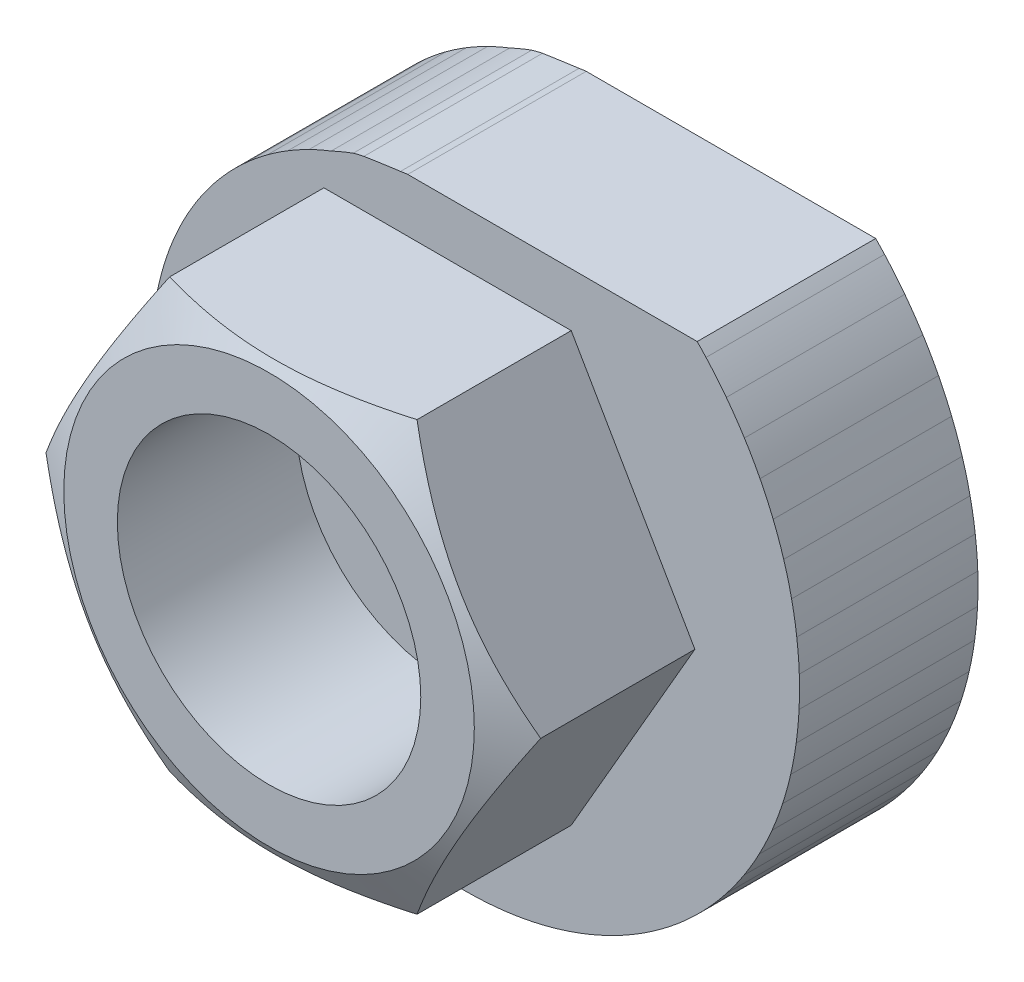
ISO-10303-21;
HEADER;
FILE_DESCRIPTION(('STEP AP214'),'2;1');
FILE_NAME('part.step','',(''),(''),'','','');
FILE_SCHEMA(('AUTOMOTIVE_DESIGN { 1 0 10303 214 1 1 1 1 }'));
ENDSEC;
DATA;
#1=APPLICATION_CONTEXT('core data for automotive mechanical design processes');
#2=APPLICATION_PROTOCOL_DEFINITION('international standard','automotive_design',2000,#1);
#3=PRODUCT_CONTEXT('',#1,'mechanical');
#4=PRODUCT('Part','Part','',(#3));
#5=PRODUCT_RELATED_PRODUCT_CATEGORY('part','',(#4));
#6=PRODUCT_DEFINITION_FORMATION('','',#4);
#7=PRODUCT_DEFINITION_CONTEXT('part definition',#1,'design');
#8=PRODUCT_DEFINITION('design','',#6,#7);
#9=PRODUCT_DEFINITION_SHAPE('','',#8);
#10=(LENGTH_UNIT() NAMED_UNIT(*) SI_UNIT(.MILLI.,.METRE.));
#11=(NAMED_UNIT(*) PLANE_ANGLE_UNIT() SI_UNIT($,.RADIAN.));
#12=(NAMED_UNIT(*) SI_UNIT($,.STERADIAN.) SOLID_ANGLE_UNIT());
#13=UNCERTAINTY_MEASURE_WITH_UNIT(LENGTH_MEASURE(1.E-05),#10,'distance_accuracy_value','');
#14=(GEOMETRIC_REPRESENTATION_CONTEXT(3) GLOBAL_UNCERTAINTY_ASSIGNED_CONTEXT((#13)) GLOBAL_UNIT_ASSIGNED_CONTEXT((#10,
#11,#12)) REPRESENTATION_CONTEXT('',''));
#15=CARTESIAN_POINT('',(0.,0.,0.));
#16=DIRECTION('',(0.,0.,1.));
#17=DIRECTION('',(1.,0.,0.));
#18=AXIS2_PLACEMENT_3D('',#15,#16,#17);
#19=CARTESIAN_POINT('',(3.27140493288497E-05,-7.39651671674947E-05,0.));
#20=DIRECTION('',(0.,0.,1.));
#21=DIRECTION('',(0.,-1.,0.));
#22=AXIS2_PLACEMENT_3D('',#19,#20,#21);
#23=PLANE('',#22);
#24=CARTESIAN_POINT('',(3.27140493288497E-05,-7.39651671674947E-05,0.));
#25=DIRECTION('',(0.,0.,1.));
#26=DIRECTION('',(0.,-1.,0.));
#27=AXIS2_PLACEMENT_3D('',#24,#25,#26);
#28=CIRCLE('',#27,15.4342571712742);
#29=CARTESIAN_POINT('',(-5.28233956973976,14.5020926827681,0.));
#30=VERTEX_POINT('',#29);
#31=CARTESIAN_POINT('',(-6.51938553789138,13.9896894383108,0.));
#32=VERTEX_POINT('',#31);
#33=EDGE_CURVE('E485',#30,#32,#28,.T.);
#34=ORIENTED_EDGE('',*,*,#33,.F.);
#35=CARTESIAN_POINT('',(-3.29985102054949,7.70890454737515,0.));
#36=DIRECTION('',(0.,0.,1.));
#37=DIRECTION('',(0.,-1.,0.));
#38=AXIS2_PLACEMENT_3D('',#35,#36,#37);
#39=CIRCLE('',#38,7.0765574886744);
#40=CARTESIAN_POINT('',(-4.68357719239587,14.6488589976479,0.));
#41=VERTEX_POINT('',#40);
#42=EDGE_CURVE('E612',#41,#30,#39,.T.);
#43=ORIENTED_EDGE('',*,*,#42,.F.);
#44=CARTESIAN_POINT('',(7.46850873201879,-62.6525508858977,0.));
#45=DIRECTION('',(0.,0.,1.));
#46=DIRECTION('',(0.,-1.,0.));
#47=AXIS2_PLACEMENT_3D('',#44,#45,#46);
#48=CIRCLE('',#47,78.2507582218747);
#49=CARTESIAN_POINT('',(-2.63486797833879,14.9432153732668,0.));
#50=VERTEX_POINT('',#49);
#51=EDGE_CURVE('E610',#50,#41,#48,.T.);
#52=ORIENTED_EDGE('',*,*,#51,.F.);
#53=CARTESIAN_POINT('',(-1.52442561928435,8.49766787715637,0.));
#54=DIRECTION('',(0.,0.,1.));
#55=DIRECTION('',(0.,-1.,0.));
#56=AXIS2_PLACEMENT_3D('',#53,#54,#55);
#57=CIRCLE('',#56,6.54050187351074);
#58=CARTESIAN_POINT('',(-2.23068938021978,14.9999256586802,0.));
#59=VERTEX_POINT('',#58);
#60=EDGE_CURVE('E608',#59,#50,#57,.T.);
#61=ORIENTED_EDGE('',*,*,#60,.F.);
#62=DIRECTION('',(-1.,1.65201909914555E-08,0.));
#63=VECTOR('',#62,1.);
#64=CARTESIAN_POINT('',(13.9869236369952,14.9999253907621,0.));
#65=LINE('',#64,#63);
#66=CARTESIAN_POINT('',(13.9869236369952,14.9999253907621,0.));
#67=VERTEX_POINT('',#66);
#68=EDGE_CURVE('E606',#67,#59,#65,.T.);
#69=ORIENTED_EDGE('',*,*,#68,.F.);
#70=CARTESIAN_POINT('',(-0.792398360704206,0.615442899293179,0.));
#71=DIRECTION('',(0.,0.,1.));
#72=DIRECTION('',(0.,-1.,0.));
#73=AXIS2_PLACEMENT_3D('',#70,#71,#72);
#74=CIRCLE('',#73,20.6238137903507);
#75=CARTESIAN_POINT('',(14.48034012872,14.4749217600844,0.));
#76=VERTEX_POINT('',#75);
#77=EDGE_CURVE('E604',#76,#67,#74,.T.);
#78=ORIENTED_EDGE('',*,*,#77,.F.);
#79=CARTESIAN_POINT('',(-0.536586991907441,0.8475828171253,0.));
#80=DIRECTION('',(0.,0.,1.));
#81=DIRECTION('',(0.,-1.,0.));
#82=AXIS2_PLACEMENT_3D('',#79,#80,#81);
#83=CIRCLE('',#82,20.2783743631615);
#84=CARTESIAN_POINT('',(15.6179670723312,13.1049418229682,0.));
#85=VERTEX_POINT('',#84);
#86=EDGE_CURVE('E602',#85,#76,#83,.T.);
#87=ORIENTED_EDGE('',*,*,#86,.F.);
#88=CARTESIAN_POINT('',(-0.673144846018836,0.743968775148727,0.));
#89=DIRECTION('',(0.,0.,1.));
#90=DIRECTION('',(0.,-1.,0.));
#91=AXIS2_PLACEMENT_3D('',#88,#89,#90);
#92=CIRCLE('',#91,20.4497917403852);
#93=CARTESIAN_POINT('',(16.6315365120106,11.6408483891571,0.));
#94=VERTEX_POINT('',#93);
#95=EDGE_CURVE('E600',#94,#85,#92,.T.);
#96=ORIENTED_EDGE('',*,*,#95,.F.);
#97=CARTESIAN_POINT('',(-0.380873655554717,0.928014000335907,0.));
#98=DIRECTION('',(0.,0.,1.));
#99=DIRECTION('',(0.,-1.,0.));
#100=AXIS2_PLACEMENT_3D('',#97,#98,#99);
#101=CIRCLE('',#100,20.1044005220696);
#102=CARTESIAN_POINT('',(17.5058409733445,10.1069224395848,0.));
#103=VERTEX_POINT('',#102);
#104=EDGE_CURVE('E598',#103,#94,#101,.T.);
#105=ORIENTED_EDGE('',*,*,#104,.F.);
#106=CARTESIAN_POINT('',(-0.533335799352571,0.849775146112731,0.));
#107=DIRECTION('',(0.,0.,1.));
#108=DIRECTION('',(0.,-1.,0.));
#109=AXIS2_PLACEMENT_3D('',#106,#107,#108);
#110=CIRCLE('',#109,20.2757656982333);
#111=CARTESIAN_POINT('',(18.2427720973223,8.5025162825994,0.));
#112=VERTEX_POINT('',#111);
#113=EDGE_CURVE('E596',#112,#103,#110,.T.);
#114=ORIENTED_EDGE('',*,*,#113,.F.);
#115=CARTESIAN_POINT('',(-0.213536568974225,0.980118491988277,0.));
#116=DIRECTION('',(0.,0.,1.));
#117=DIRECTION('',(0.,-1.,0.));
#118=AXIS2_PLACEMENT_3D('',#115,#116,#117);
#119=CIRCLE('',#118,19.9304239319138);
#120=CARTESIAN_POINT('',(18.8316299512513,6.85408055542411,0.));
#121=VERTEX_POINT('',#120);
#122=EDGE_CURVE('E594',#121,#112,#119,.T.);
#123=ORIENTED_EDGE('',*,*,#122,.F.);
#124=CARTESIAN_POINT('',(-0.377238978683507,0.929628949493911,0.));
#125=DIRECTION('',(0.,0.,1.));
#126=DIRECTION('',(0.,-1.,0.));
#127=AXIS2_PLACEMENT_3D('',#124,#125,#126);
#128=CIRCLE('',#127,20.1017355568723);
#129=CARTESIAN_POINT('',(19.2742022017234,5.16054279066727,0.));
#130=VERTEX_POINT('',#129);
#131=EDGE_CURVE('E592',#130,#121,#128,.T.);
#132=ORIENTED_EDGE('',*,*,#131,.F.);
#133=CARTESIAN_POINT('',(-0.0396827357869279,1.00230409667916,0.));
#134=DIRECTION('',(0.,0.,1.));
#135=DIRECTION('',(0.,-1.,0.));
#136=AXIS2_PLACEMENT_3D('',#133,#134,#135);
#137=CIRCLE('',#136,19.7564445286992);
#138=CARTESIAN_POINT('',(19.5645861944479,3.44969865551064,0.));
#139=VERTEX_POINT('',#138);
#140=EDGE_CURVE('E590',#139,#130,#137,.T.);
#141=ORIENTED_EDGE('',*,*,#140,.F.);
#142=CARTESIAN_POINT('',(-0.209620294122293,0.981089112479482,0.));
#143=DIRECTION('',(0.,0.,1.));
#144=DIRECTION('',(0.,-1.,0.));
#145=AXIS2_PLACEMENT_3D('',#142,#143,#144);
#146=CIRCLE('',#145,19.9277012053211);
#147=CARTESIAN_POINT('',(19.7043743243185,1.72007061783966,0.));
#148=VERTEX_POINT('',#147);
#149=EDGE_CURVE('E588',#148,#139,#146,.T.);
#150=ORIENTED_EDGE('',*,*,#149,.F.);
#151=CARTESIAN_POINT('',(0.135381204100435,0.99389165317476,0.));
#152=DIRECTION('',(0.,0.,1.));
#153=DIRECTION('',(0.,-1.,0.));
#154=AXIS2_PLACEMENT_3D('',#151,#152,#153);
#155=CIRCLE('',#154,19.5824622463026);
#156=CARTESIAN_POINT('',(19.6926020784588,-5.97034967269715E-05,0.));
#157=VERTEX_POINT('',#156);
#158=EDGE_CURVE('E586',#157,#148,#155,.T.);
#159=ORIENTED_EDGE('',*,*,#158,.F.);
#160=CARTESIAN_POINT('',(-0.0355984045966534,1.00258130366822,0.));
#161=DIRECTION('',(0.,0.,1.));
#162=DIRECTION('',(0.,-1.,0.));
#163=AXIS2_PLACEMENT_3D('',#160,#161,#162);
#164=CIRCLE('',#163,19.753662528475);
#165=CARTESIAN_POINT('',(19.5305795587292,-1.71253622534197,0.));
#166=VERTEX_POINT('',#165);
#167=EDGE_CURVE('E584',#166,#157,#164,.T.);
#168=ORIENTED_EDGE('',*,*,#167,.F.);
#169=CARTESIAN_POINT('',(0.306310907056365,0.955135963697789,0.));
#170=DIRECTION('',(0.,0.,1.));
#171=DIRECTION('',(0.,-1.,0.));
#172=AXIS2_PLACEMENT_3D('',#169,#170,#171);
#173=CIRCLE('',#172,19.4084770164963);
#174=CARTESIAN_POINT('',(19.2222692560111,-3.38945836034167,0.));
#175=VERTEX_POINT('',#174);
#176=EDGE_CURVE('E582',#175,#166,#173,.T.);
#177=ORIENTED_EDGE('',*,*,#176,.F.);
#178=CARTESIAN_POINT('',(0.139511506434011,0.993446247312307,0.));
#179=DIRECTION('',(0.,0.,1.));
#180=DIRECTION('',(0.,-1.,0.));
#181=AXIS2_PLACEMENT_3D('',#178,#179,#180);
#182=CIRCLE('',#181,19.5796194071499);
#183=CARTESIAN_POINT('',(18.7686200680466,-5.0329797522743,0.));
#184=VERTEX_POINT('',#183);
#185=EDGE_CURVE('E580',#184,#175,#182,.T.);
#186=ORIENTED_EDGE('',*,*,#185,.F.);
#187=CARTESIAN_POINT('',(0.467887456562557,0.887218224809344,0.));
#188=DIRECTION('',(0.,0.,1.));
#189=DIRECTION('',(0.,-1.,0.));
#190=AXIS2_PLACEMENT_3D('',#187,#188,#189);
#191=CIRCLE('',#190,19.2344887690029);
#192=CARTESIAN_POINT('',(18.1783599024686,-6.6164291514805,0.));
#193=VERTEX_POINT('',#192);
#194=EDGE_CURVE('E578',#193,#184,#191,.T.);
#195=ORIENTED_EDGE('',*,*,#194,.F.);
#196=CARTESIAN_POINT('',(0.310360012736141,0.953960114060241,0.));
#197=DIRECTION('',(0.,0.,1.));
#198=DIRECTION('',(0.,-1.,0.));
#199=AXIS2_PLACEMENT_3D('',#196,#197,#198);
#200=CIRCLE('',#199,19.4055717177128);
#201=CARTESIAN_POINT('',(17.4520092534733,-8.1421970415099,0.));
#202=VERTEX_POINT('',#201);
#203=EDGE_CURVE('E576',#202,#193,#200,.T.);
#204=ORIENTED_EDGE('',*,*,#203,.F.);
#205=CARTESIAN_POINT('',(0.615176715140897,0.792210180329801,0.));
#206=DIRECTION('',(0.,0.,1.));
#207=DIRECTION('',(0.,-1.,0.));
#208=AXIS2_PLACEMENT_3D('',#205,#206,#207);
#209=CIRCLE('',#208,19.060497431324);
#210=CARTESIAN_POINT('',(16.6027555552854,-9.58564533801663,0.));
#211=VERTEX_POINT('',#210);
#212=EDGE_CURVE('E574',#211,#202,#209,.T.);
#213=ORIENTED_EDGE('',*,*,#212,.F.);
#214=CARTESIAN_POINT('',(0.471726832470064,0.885326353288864,0.));
#215=DIRECTION('',(0.,0.,1.));
#216=DIRECTION('',(0.,-1.,0.));
#217=AXIS2_PLACEMENT_3D('',#214,#215,#216);
#218=CIRCLE('',#217,19.2315193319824);
#219=CARTESIAN_POINT('',(15.6306386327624,-10.9493146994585,0.));
#220=VERTEX_POINT('',#219);
#221=EDGE_CURVE('E572',#220,#211,#218,.T.);
#222=ORIENTED_EDGE('',*,*,#221,.F.);
#223=CARTESIAN_POINT('',(0.743680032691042,0.673011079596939,0.));
#224=DIRECTION('',(0.,0.,1.));
#225=DIRECTION('',(0.,-1.,0.));
#226=AXIS2_PLACEMENT_3D('',#223,#224,#225);
#227=CIRCLE('',#226,18.8865029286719);
#228=CARTESIAN_POINT('',(14.5528657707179,-12.2113353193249,0.));
#229=VERTEX_POINT('',#228);
#230=EDGE_CURVE('E570',#229,#220,#227,.T.);
#231=ORIENTED_EDGE('',*,*,#230,.F.);
#232=CARTESIAN_POINT('',(0.618680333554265,0.789639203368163,0.));
#233=DIRECTION('',(0.,0.,1.));
#234=DIRECTION('',(0.,-1.,0.));
#235=AXIS2_PLACEMENT_3D('',#232,#233,#234);
#236=CIRCLE('',#235,19.0574621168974);
#237=CARTESIAN_POINT('',(13.3689615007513,-13.3743006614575,0.));
#238=VERTEX_POINT('',#237);
#239=EDGE_CURVE('E568',#238,#229,#236,.T.);
#240=ORIENTED_EDGE('',*,*,#239,.F.);
#241=CARTESIAN_POINT('',(0.849471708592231,0.533259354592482,0.));
#242=DIRECTION('',(0.,0.,1.));
#243=DIRECTION('',(0.,-1.,0.));
#244=AXIS2_PLACEMENT_3D('',#241,#242,#243);
#245=CIRCLE('',#244,18.7125051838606);
#246=CARTESIAN_POINT('',(12.0995940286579,-14.4197536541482,0.));
#247=VERTEX_POINT('',#246);
#248=EDGE_CURVE('E566',#247,#238,#245,.T.);
#249=ORIENTED_EDGE('',*,*,#248,.F.);
#250=CARTESIAN_POINT('',(0.746728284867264,0.669819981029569,0.));
#251=DIRECTION('',(0.,0.,1.));
#252=DIRECTION('',(0.,-1.,0.));
#253=AXIS2_PLACEMENT_3D('',#250,#251,#252);
#254=CIRCLE('',#253,18.8833999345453);
#255=CARTESIAN_POINT('',(10.7437576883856,-15.3502360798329,0.));
#256=VERTEX_POINT('',#255);
#257=EDGE_CURVE('E564',#256,#247,#254,.T.);
#258=ORIENTED_EDGE('',*,*,#257,.F.);
#259=CARTESIAN_POINT('',(0.929319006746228,0.377221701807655,0.));
#260=DIRECTION('',(0.,0.,1.));
#261=DIRECTION('',(0.,-1.,0.));
#262=AXIS2_PLACEMENT_3D('',#259,#260,#261);
#263=CIRCLE('',#262,18.5385041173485);
#264=CARTESIAN_POINT('',(9.32492149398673,-16.1512384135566,0.));
#265=VERTEX_POINT('',#264);
#266=EDGE_CURVE('E562',#265,#256,#263,.T.);
#267=ORIENTED_EDGE('',*,*,#266,.F.);
#268=CARTESIAN_POINT('',(0.851955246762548,0.529528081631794,0.));
#269=DIRECTION('',(0.,0.,1.));
#270=DIRECTION('',(0.,-1.,0.));
#271=AXIS2_PLACEMENT_3D('',#268,#269,#270);
#272=CIRCLE('',#271,18.7093326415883);
#273=CARTESIAN_POINT('',(7.84155574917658,-16.825143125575,0.));
#274=VERTEX_POINT('',#273);
#275=EDGE_CURVE('E560',#274,#265,#272,.T.);
#276=ORIENTED_EDGE('',*,*,#275,.F.);
#277=CARTESIAN_POINT('',(0.980781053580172,0.209662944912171,0.));
#278=DIRECTION('',(0.,0.,1.));
#279=DIRECTION('',(0.,-1.,0.));
#280=AXIS2_PLACEMENT_3D('',#277,#278,#279);
#281=CIRCLE('',#280,18.3644996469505);
#282=CARTESIAN_POINT('',(6.31919000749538,-17.3617979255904,0.));
#283=VERTEX_POINT('',#282);
#284=EDGE_CURVE('E558',#283,#274,#281,.T.);
#285=ORIENTED_EDGE('',*,*,#284,.F.);
#286=CARTESIAN_POINT('',(0.931142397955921,0.37304939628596,0.));
#287=DIRECTION('',(0.,0.,1.));
#288=DIRECTION('',(0.,-1.,0.));
#289=AXIS2_PLACEMENT_3D('',#286,#287,#288);
#290=CIRCLE('',#289,18.5352600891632);
#291=CARTESIAN_POINT('',(4.75579833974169,-17.7633194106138,0.));
#292=VERTEX_POINT('',#291);
#293=EDGE_CURVE('E556',#292,#283,#290,.T.);
#294=ORIENTED_EDGE('',*,*,#293,.F.);
#295=CARTESIAN_POINT('',(1.00228359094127,0.0357006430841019,0.));
#296=DIRECTION('',(0.,0.,1.));
#297=DIRECTION('',(0.,-1.,0.));
#298=AXIS2_PLACEMENT_3D('',#295,#296,#297);
#299=CIRCLE('',#298,18.1904916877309);
#300=CARTESIAN_POINT('',(3.17817372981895,-18.0241855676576,0.));
#301=VERTEX_POINT('',#300);
#302=EDGE_CURVE('E554',#301,#292,#299,.T.);
#303=ORIENTED_EDGE('',*,*,#302,.F.);
#304=CARTESIAN_POINT('',(0.981866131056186,0.205165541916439,0.));
#305=DIRECTION('',(0.,0.,1.));
#306=DIRECTION('',(0.,-1.,0.));
#307=AXIS2_PLACEMENT_3D('',#304,#305,#306);
#308=CIRCLE('',#307,18.3611821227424);
#309=CARTESIAN_POINT('',(1.58384316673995,-18.1461459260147,0.));
#310=VERTEX_POINT('',#309);
#311=EDGE_CURVE('E552',#310,#301,#308,.T.);
#312=ORIENTED_EDGE('',*,*,#311,.F.);
#313=CARTESIAN_POINT('',(0.993167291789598,-0.139351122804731,0.));
#314=DIRECTION('',(0.,0.,1.));
#315=DIRECTION('',(0.,-1.,0.));
#316=AXIS2_PLACEMENT_3D('',#313,#314,#315);
#317=CIRCLE('',#316,18.0164801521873);
#318=CARTESIAN_POINT('',(3.39864539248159E-05,-18.1284379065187,0.));
#319=VERTEX_POINT('',#318);
#320=EDGE_CURVE('E550',#319,#310,#317,.T.);
#321=ORIENTED_EDGE('',*,*,#320,.F.);
#322=CARTESIAN_POINT('',(1.00923134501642,0.0306390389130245,0.));
#323=DIRECTION('',(0.,0.,1.));
#324=DIRECTION('',(0.,-1.,0.));
#325=AXIS2_PLACEMENT_3D('',#322,#323,#324);
#326=CIRCLE('',#325,18.1870985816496);
#327=CARTESIAN_POINT('',(-1.57191652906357,-17.9723671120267,0.));
#328=VERTEX_POINT('',#327);
#329=EDGE_CURVE('E548',#328,#319,#326,.T.);
#330=ORIENTED_EDGE('',*,*,#329,.F.);
#331=CARTESIAN_POINT('',(0.957895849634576,-0.310158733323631,0.));
#332=DIRECTION('',(0.,0.,1.));
#333=DIRECTION('',(0.,-1.,0.));
#334=AXIS2_PLACEMENT_3D('',#331,#332,#333);
#335=CIRCLE('',#334,17.8424649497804);
#336=CARTESIAN_POINT('',(-3.11355807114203,-17.6818834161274,0.));
#337=VERTEX_POINT('',#336);
#338=EDGE_CURVE('E546',#337,#328,#335,.T.);
#339=ORIENTED_EDGE('',*,*,#338,.F.);
#340=CARTESIAN_POINT('',(0.996812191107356,-0.144113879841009,0.));
#341=DIRECTION('',(0.,0.,1.));
#342=DIRECTION('',(0.,-1.,0.));
#343=AXIS2_PLACEMENT_3D('',#340,#341,#342);
#344=CIRCLE('',#343,18.0130092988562);
#345=CARTESIAN_POINT('',(-4.62384337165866,-17.2577556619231,0.));
#346=VERTEX_POINT('',#345);
#347=EDGE_CURVE('E544',#346,#337,#344,.T.);
#348=ORIENTED_EDGE('',*,*,#347,.F.);
#349=CARTESIAN_POINT('',(0.889297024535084,-0.471473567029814,0.));
#350=DIRECTION('',(0.,0.,1.));
#351=DIRECTION('',(0.,-1.,0.));
#352=AXIS2_PLACEMENT_3D('',#349,#350,#351);
#353=CIRCLE('',#352,17.668445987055);
#354=CARTESIAN_POINT('',(-6.07716325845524,-16.7085427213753,0.));
#355=VERTEX_POINT('',#354);
#356=EDGE_CURVE('E542',#355,#346,#353,.T.);
#357=ORIENTED_EDGE('',*,*,#356,.F.);
#358=CARTESIAN_POINT('',(0.956510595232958,-0.314815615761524,0.));
#359=DIRECTION('',(0.,0.,1.));
#360=DIRECTION('',(0.,-1.,0.));
#361=AXIS2_PLACEMENT_3D('',#358,#359,#360);
#362=CIRCLE('',#361,17.8389141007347);
#363=CARTESIAN_POINT('',(-7.47684520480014,-16.0344010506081,0.));
#364=VERTEX_POINT('',#363);
#365=EDGE_CURVE('E540',#364,#355,#362,.T.);
#366=ORIENTED_EDGE('',*,*,#365,.F.);
#367=CARTESIAN_POINT('',(0.793652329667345,-0.618379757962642,0.));
#368=DIRECTION('',(0.,0.,1.));
#369=DIRECTION('',(0.,-1.,0.));
#370=AXIS2_PLACEMENT_3D('',#367,#368,#369);
#371=CIRCLE('',#370,17.494423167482);
#372=CARTESIAN_POINT('',(-8.79926907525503,-15.2481678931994,0.));
#373=VERTEX_POINT('',#372);
#374=EDGE_CURVE('E538',#373,#364,#371,.T.);
#375=ORIENTED_EDGE('',*,*,#374,.F.);
#376=CARTESIAN_POINT('',(0.887084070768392,-0.475890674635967,0.));
#377=DIRECTION('',(0.,0.,1.));
#378=DIRECTION('',(0.,-1.,0.));
#379=AXIS2_PLACEMENT_3D('',#376,#377,#378);
#380=CIRCLE('',#379,17.6648128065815);
#381=CARTESIAN_POINT('',(-10.047833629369,-14.3493612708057,0.));
#382=VERTEX_POINT('',#381);
#383=EDGE_CURVE('E536',#382,#373,#380,.T.);
#384=ORIENTED_EDGE('',*,*,#383,.F.);
#385=CARTESIAN_POINT('',(0.673882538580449,-0.746386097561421,0.));
#386=DIRECTION('',(0.,0.,1.));
#387=DIRECTION('',(0.,-1.,0.));
#388=AXIS2_PLACEMENT_3D('',#385,#386,#387);
#389=CIRCLE('',#388,17.3203963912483);
#390=CARTESIAN_POINT('',(-11.2016122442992,-13.3546672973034,0.));
#391=VERTEX_POINT('',#390);
#392=EDGE_CURVE('E534',#391,#382,#389,.T.);
#393=ORIENTED_EDGE('',*,*,#392,.F.);
#394=CARTESIAN_POINT('',(0.790652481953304,-0.622410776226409,0.));
#395=DIRECTION('',(0.,0.,1.));
#396=DIRECTION('',(0.,-1.,0.));
#397=AXIS2_PLACEMENT_3D('',#394,#395,#396);
#398=CIRCLE('',#397,17.4907052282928);
#399=CARTESIAN_POINT('',(-12.2639512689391,-12.2629472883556,0.));
#400=VERTEX_POINT('',#399);
#401=EDGE_CURVE('E532',#400,#391,#398,.T.);
#402=ORIENTED_EDGE('',*,*,#401,.F.);
#403=CARTESIAN_POINT('',(0.53364637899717,-0.851578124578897,0.));
#404=DIRECTION('',(0.,0.,1.));
#405=DIRECTION('',(0.,-1.,0.));
#406=AXIS2_PLACEMENT_3D('',#403,#404,#405);
#407=CIRCLE('',#406,17.146365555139);
#408=CARTESIAN_POINT('',(-13.2172336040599,-11.0941926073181,0.));
#409=VERTEX_POINT('',#408);
#410=EDGE_CURVE('E530',#409,#400,#407,.T.);
#411=ORIENTED_EDGE('',*,*,#410,.F.);
#412=CARTESIAN_POINT('',(0.670162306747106,-0.749891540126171,0.));
#413=DIRECTION('',(0.,0.,1.));
#414=DIRECTION('',(0.,-1.,0.));
#415=AXIS2_PLACEMENT_3D('',#412,#413,#414);
#416=CIRCLE('',#415,17.3165911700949);
#417=CARTESIAN_POINT('',(-14.0646256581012,-9.84661366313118,0.));
#418=VERTEX_POINT('',#417);
#419=EDGE_CURVE('E528',#418,#409,#416,.T.);
#420=ORIENTED_EDGE('',*,*,#419,.F.);
#421=CARTESIAN_POINT('',(0.377228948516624,-0.930737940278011,0.));
#422=DIRECTION('',(0.,0.,1.));
#423=DIRECTION('',(0.,-1.,0.));
#424=AXIS2_PLACEMENT_3D('',#421,#422,#423);
#425=CIRCLE('',#424,16.9723305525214);
#426=CARTESIAN_POINT('',(-14.7923292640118,-8.54286694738,0.));
#427=VERTEX_POINT('',#426);
#428=EDGE_CURVE('E526',#427,#418,#425,.T.);
#429=ORIENTED_EDGE('',*,*,#428,.F.);
#430=CARTESIAN_POINT('',(0.529296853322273,-0.854429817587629,0.));
#431=DIRECTION('',(0.,0.,1.));
#432=DIRECTION('',(0.,-1.,0.));
#433=AXIS2_PLACEMENT_3D('',#430,#431,#432);
#434=CIRCLE('',#433,17.142470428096);
#435=CARTESIAN_POINT('',(-15.4032042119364,-7.18054254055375,0.));
#436=VERTEX_POINT('',#435);
#437=EDGE_CURVE('E524',#436,#427,#434,.T.);
#438=ORIENTED_EDGE('',*,*,#437,.F.);
#439=CARTESIAN_POINT('',(0.209410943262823,-0.981442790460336,0.));
#440=DIRECTION('',(0.,0.,1.));
#441=DIRECTION('',(0.,-1.,0.));
#442=AXIS2_PLACEMENT_3D('',#439,#440,#441);
#443=CIRCLE('',#442,16.7982912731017);
#444=CARTESIAN_POINT('',(-15.8876593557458,-5.78424587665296,0.));
#445=VERTEX_POINT('',#444);
#446=EDGE_CURVE('E522',#445,#436,#443,.T.);
#447=ORIENTED_EDGE('',*,*,#446,.F.);
#448=CARTESIAN_POINT('',(0.372363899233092,-0.93282332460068,0.));
#449=DIRECTION('',(0.,0.,1.));
#450=DIRECTION('',(0.,-1.,0.));
#451=AXIS2_PLACEMENT_3D('',#448,#449,#450);
#452=CIRCLE('',#451,16.9683427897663);
#453=CARTESIAN_POINT('',(-16.2481268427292,-4.35100186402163,0.));
#454=VERTEX_POINT('',#453);
#455=EDGE_CURVE('E520',#454,#445,#452,.T.);
#456=ORIENTED_EDGE('',*,*,#455,.F.);
#457=CARTESIAN_POINT('',(0.035322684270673,-1.00213939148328,0.));
#458=DIRECTION('',(0.,0.,1.));
#459=DIRECTION('',(0.,-1.,0.));
#460=AXIS2_PLACEMENT_3D('',#457,#458,#459);
#461=CIRCLE('',#460,16.6242476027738);
#462=CARTESIAN_POINT('',(-16.479478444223,-2.90659523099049,0.));
#463=VERTEX_POINT('',#462);
#464=EDGE_CURVE('E518',#463,#454,#461,.T.);
#465=ORIENTED_EDGE('',*,*,#464,.F.);
#466=CARTESIAN_POINT('',(0.204164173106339,-0.982668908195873,0.));
#467=DIRECTION('',(0.,0.,1.));
#468=DIRECTION('',(0.,-1.,0.));
#469=AXIS2_PLACEMENT_3D('',#466,#467,#468);
#470=CIRCLE('',#469,16.7942080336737);
#471=CARTESIAN_POINT('',(-16.5836080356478,-1.44756432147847,0.));
#472=VERTEX_POINT('',#471);
#473=EDGE_CURVE('E516',#472,#463,#470,.T.);
#474=ORIENTED_EDGE('',*,*,#473,.F.);
#475=CARTESIAN_POINT('',(-0.139712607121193,-0.992191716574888,0.));
#476=DIRECTION('',(0.,0.,1.));
#477=DIRECTION('',(0.,-1.,0.));
#478=AXIS2_PLACEMENT_3D('',#475,#476,#477);
#479=CIRCLE('',#478,16.4501994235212);
#480=CARTESIAN_POINT('',(-16.5599672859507,-7.41045975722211E-05,0.));
#481=VERTEX_POINT('',#480);
#482=EDGE_CURVE('E514',#481,#472,#479,.T.);
#483=ORIENTED_EDGE('',*,*,#482,.F.);
#484=CARTESIAN_POINT('',(0.0326495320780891,-0.954882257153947,0.));
#485=DIRECTION('',(0.,0.,1.));
#486=DIRECTION('',(0.,-1.,0.));
#487=AXIS2_PLACEMENT_3D('',#484,#485,#486);
#488=CIRCLE('',#487,16.6200659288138);
#489=CARTESIAN_POINT('',(-16.4140052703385,1.43972361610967,0.));
#490=VERTEX_POINT('',#489);
#491=EDGE_CURVE('E512',#490,#481,#488,.T.);
#492=ORIENTED_EDGE('',*,*,#491,.F.);
#493=CARTESIAN_POINT('',(-0.314530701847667,-0.951900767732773,0.));
#494=DIRECTION('',(0.,0.,1.));
#495=DIRECTION('',(0.,-1.,0.));
#496=AXIS2_PLACEMENT_3D('',#493,#494,#495);
#497=CIRCLE('',#496,16.276146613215);
#498=CARTESIAN_POINT('',(-16.1413508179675,2.84608732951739,0.));
#499=VERTEX_POINT('',#498);
#500=EDGE_CURVE('E510',#499,#490,#497,.T.);
#501=ORIENTED_EDGE('',*,*,#500,.F.);
#502=CARTESIAN_POINT('',(-0.149447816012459,-0.991515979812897,0.));
#503=DIRECTION('',(0.,0.,1.));
#504=DIRECTION('',(0.,-1.,0.));
#505=AXIS2_PLACEMENT_3D('',#502,#503,#504);
#506=CIRCLE('',#505,16.4459162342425);
#507=CARTESIAN_POINT('',(-15.746742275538,4.22313322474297,0.));
#508=VERTEX_POINT('',#507);
#509=EDGE_CURVE('E508',#508,#499,#506,.T.);
#510=ORIENTED_EDGE('',*,*,#509,.F.);
#511=CARTESIAN_POINT('',(-0.475533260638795,-0.882495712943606,0.));
#512=DIRECTION('',(0.,0.,1.));
#513=DIRECTION('',(0.,-1.,0.));
#514=AXIS2_PLACEMENT_3D('',#511,#512,#513);
#515=CIRCLE('',#514,16.1020890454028);
#516=CARTESIAN_POINT('',(-15.2385787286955,5.5463268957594,0.));
#517=VERTEX_POINT('',#516);
#518=EDGE_CURVE('E506',#517,#508,#515,.T.);
#519=ORIENTED_EDGE('',*,*,#518,.F.);
#520=CARTESIAN_POINT('',(-0.319973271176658,-0.950236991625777,0.));
#521=DIRECTION('',(0.,0.,1.));
#522=DIRECTION('',(0.,-1.,0.));
#523=AXIS2_PLACEMENT_3D('',#520,#521,#522);
#524=CIRCLE('',#523,16.2717586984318);
#525=CARTESIAN_POINT('',(-14.6166443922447,6.81991911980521,0.));
#526=VERTEX_POINT('',#525);
#527=EDGE_CURVE('E504',#526,#517,#524,.T.);
#528=ORIENTED_EDGE('',*,*,#527,.F.);
#529=CARTESIAN_POINT('',(-0.621982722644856,-0.786096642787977,0.));
#530=DIRECTION('',(0.,0.,1.));
#531=DIRECTION('',(0.,-1.,0.));
#532=AXIS2_PLACEMENT_3D('',#529,#530,#531);
#533=CIRCLE('',#532,15.9280265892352);
#534=CARTESIAN_POINT('',(-13.8934333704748,8.02132231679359,0.));
#535=VERTEX_POINT('',#534);
#536=EDGE_CURVE('E502',#535,#526,#533,.T.);
#537=ORIENTED_EDGE('',*,*,#536,.F.);
#538=CARTESIAN_POINT('',(-0.480697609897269,-0.87985859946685,0.));
#539=DIRECTION('',(0.,0.,1.));
#540=DIRECTION('',(0.,-1.,0.));
#541=AXIS2_PLACEMENT_3D('',#538,#539,#540);
#542=CIRCLE('',#541,16.0975930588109);
#543=CARTESIAN_POINT('',(-13.0679360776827,9.15477791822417,0.));
#544=VERTEX_POINT('',#543);
#545=EDGE_CURVE('E500',#544,#535,#542,.T.);
#546=ORIENTED_EDGE('',*,*,#545,.F.);
#547=CARTESIAN_POINT('',(-0.749396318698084,-0.665650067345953,0.));
#548=DIRECTION('',(0.,0.,1.));
#549=DIRECTION('',(0.,-1.,0.));
#550=AXIS2_PLACEMENT_3D('',#547,#548,#549);
#551=CIRCLE('',#550,15.7539591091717);
#552=CARTESIAN_POINT('',(-12.1563219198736,10.2003186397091,0.));
#553=VERTEX_POINT('',#552);
#554=EDGE_CURVE('E498',#553,#544,#551,.T.);
#555=ORIENTED_EDGE('',*,*,#554,.F.);
#556=CARTESIAN_POINT('',(-0.626695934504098,-0.782531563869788,0.));
#557=DIRECTION('',(0.,0.,1.));
#558=DIRECTION('',(0.,-1.,0.));
#559=AXIS2_PLACEMENT_3D('',#556,#557,#558);
#560=CIRCLE('',#559,15.9234190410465);
#561=CARTESIAN_POINT('',(-11.1567859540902,11.1620269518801,0.));
#562=VERTEX_POINT('',#561);
#563=EDGE_CURVE('E496',#562,#553,#560,.T.);
#564=ORIENTED_EDGE('',*,*,#563,.F.);
#565=CARTESIAN_POINT('',(-0.85387258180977,-0.524839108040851,0.));
#566=DIRECTION('',(0.,0.,1.));
#567=DIRECTION('',(0.,-1.,0.));
#568=AXIS2_PLACEMENT_3D('',#565,#566,#567);
#569=CIRCLE('',#568,15.5798864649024);
#570=CARTESIAN_POINT('',(-10.0886442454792,12.0231429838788,0.));
#571=VERTEX_POINT('',#570);
#572=EDGE_CURVE('E494',#571,#562,#569,.T.);
#573=ORIENTED_EDGE('',*,*,#572,.F.);
#574=CARTESIAN_POINT('',(-0.753492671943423,-0.661232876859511,0.));
#575=DIRECTION('',(0.,0.,1.));
#576=DIRECTION('',(0.,-1.,0.));
#577=AXIS2_PLACEMENT_3D('',#574,#575,#576);
#578=CIRCLE('',#577,15.7492363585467);
#579=CARTESIAN_POINT('',(-8.94932329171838,12.7874401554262,0.));
#580=VERTEX_POINT('',#579);
#581=EDGE_CURVE('E492',#580,#571,#578,.T.);
#582=ORIENTED_EDGE('',*,*,#581,.F.);
#583=CARTESIAN_POINT('',(-0.932210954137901,-0.367971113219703,0.));
#584=DIRECTION('',(0.,0.,1.));
#585=DIRECTION('',(0.,-1.,0.));
#586=AXIS2_PLACEMENT_3D('',#583,#584,#585);
#587=CIRCLE('',#586,15.4058085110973);
#588=CARTESIAN_POINT('',(-7.76066543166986,13.441849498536,0.));
#589=VERTEX_POINT('',#588);
#590=EDGE_CURVE('E490',#589,#580,#587,.T.);
#591=ORIENTED_EDGE('',*,*,#590,.F.);
#592=CARTESIAN_POINT('',(-0.857208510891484,-0.519655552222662,0.));
#593=DIRECTION('',(0.,0.,1.));
#594=DIRECTION('',(0.,-1.,0.));
#595=AXIS2_PLACEMENT_3D('',#592,#593,#594);
#596=CIRCLE('',#595,15.5750229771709);
#597=EDGE_CURVE('E488',#32,#589,#596,.T.);
#598=ORIENTED_EDGE('',*,*,#597,.F.);
#599=EDGE_LOOP('',(#34,#43,#52,#61,#69,#78,#87,#96,#105,#114,#123,#132,#141,#150,#159,#168,#177,
#186,#195,#204,#213,#222,#231,#240,#249,#258,#267,#276,#285,#294,#303,#312,#321,#330,#339,#348,
#357,#366,#375,#384,#393,#402,#411,#420,#429,#438,#447,#456,#465,#474,#483,#492,#501,#510,#519,
#528,#537,#546,#555,#564,#573,#582,#591,#598));
#600=FACE_BOUND('',#599,.T.);
#601=CARTESIAN_POINT('',(0.,0.,0.));
#602=DIRECTION('',(0.,0.,1.));
#603=DIRECTION('',(0.,-1.,0.));
#604=AXIS2_PLACEMENT_3D('',#601,#602,#603);
#605=CIRCLE('',#604,5.);
#606=CARTESIAN_POINT('',(0.,-5.,0.));
#607=VERTEX_POINT('',#606);
#608=EDGE_CURVE('E18',#607,#607,#605,.F.);
#609=ORIENTED_EDGE('',*,*,#608,.F.);
#610=EDGE_LOOP('',(#609));
#611=FACE_BOUND('',#610,.T.);
#612=ADVANCED_FACE('F14',(#600,#611),#23,.F.);
#613=CARTESIAN_POINT('',(13.856406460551,0.,20.));
#614=DIRECTION('',(0.,0.,1.));
#615=DIRECTION('',(0.,-1.,0.));
#616=AXIS2_PLACEMENT_3D('',#613,#614,#615);
#617=PLANE('',#616);
#618=CARTESIAN_POINT('',(0.,0.,20.));
#619=DIRECTION('',(0.,0.,1.));
#620=DIRECTION('',(-1.,0.,0.));
#621=AXIS2_PLACEMENT_3D('',#618,#619,#620);
#622=CIRCLE('',#621,11.5);
#623=CARTESIAN_POINT('',(-11.5,0.,20.));
#624=VERTEX_POINT('',#623);
#625=EDGE_CURVE('E457',#624,#624,#622,.T.);
#626=ORIENTED_EDGE('',*,*,#625,.T.);
#627=EDGE_LOOP('',(#626));
#628=FACE_BOUND('',#627,.T.);
#629=CARTESIAN_POINT('',(0.,0.,20.));
#630=DIRECTION('',(0.,0.,1.));
#631=DIRECTION('',(0.,-1.,0.));
#632=AXIS2_PLACEMENT_3D('',#629,#630,#631);
#633=CIRCLE('',#632,8.5);
#634=CARTESIAN_POINT('',(0.,-8.5,20.));
#635=VERTEX_POINT('',#634);
#636=EDGE_CURVE('E930',#635,#635,#633,.F.);
#637=ORIENTED_EDGE('',*,*,#636,.T.);
#638=EDGE_LOOP('',(#637));
#639=FACE_BOUND('',#638,.T.);
#640=ADVANCED_FACE('F967',(#628,#639),#617,.T.);
#641=CARTESIAN_POINT('',(6.92820323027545,-12.,20.));
#642=DIRECTION('',(-0.866025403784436,0.5,0.));
#643=DIRECTION('',(-0.5,-0.866025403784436,0.));
#644=AXIS2_PLACEMENT_3D('',#641,#642,#643);
#645=PLANE('',#644);
#646=CARTESIAN_POINT('',(6.92808776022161,-12.0002,18.6394614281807));
#647=CARTESIAN_POINT('',(7.08038456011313,-11.7364142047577,18.7273752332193));
#648=CARTESIAN_POINT('',(7.23324920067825,-11.4716448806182,18.8112988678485));
#649=CARTESIAN_POINT('',(7.54020434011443,-10.9399829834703,18.9700586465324));
#650=CARTESIAN_POINT('',(7.69429522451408,-10.6730897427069,19.0448918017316));
#651=CARTESIAN_POINT('',(8.15905073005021,-9.86810959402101,19.254307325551));
#652=CARTESIAN_POINT('',(8.47155003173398,-9.32684492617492,19.3734216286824));
#653=CARTESIAN_POINT('',(8.9391909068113,-8.51686717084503,19.5130938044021));
#654=CARTESIAN_POINT('',(9.09293539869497,-8.25057389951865,19.5528810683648));
#655=CARTESIAN_POINT('',(9.40113622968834,-7.71675440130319,19.6196014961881));
#656=CARTESIAN_POINT('',(9.55559258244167,-7.44922815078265,19.6465344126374));
#657=CARTESIAN_POINT('',(9.86476279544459,-6.91372963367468,19.6868562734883));
#658=CARTESIAN_POINT('',(10.0194761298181,-6.6457582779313,19.7002613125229));
#659=CARTESIAN_POINT('',(10.3290461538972,-6.109567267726,19.713241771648));
#660=CARTESIAN_POINT('',(10.4839028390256,-5.84134762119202,19.7128176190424));
#661=CARTESIAN_POINT('',(10.7734076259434,-5.33991062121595,19.6991048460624));
#662=CARTESIAN_POINT('',(10.9080763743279,-5.10665750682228,19.6874888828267));
#663=CARTESIAN_POINT('',(11.1771041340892,-4.64068775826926,19.6540168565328));
#664=CARTESIAN_POINT('',(11.311463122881,-4.40797116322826,19.632160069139));
#665=CARTESIAN_POINT('',(11.5797983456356,-3.94320092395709,19.5785874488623));
#666=CARTESIAN_POINT('',(11.7137741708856,-3.71114798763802,19.5468634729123));
#667=CARTESIAN_POINT('',(11.9810977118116,-3.24813003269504,19.4741130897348));
#668=CARTESIAN_POINT('',(12.1144453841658,-3.01716508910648,19.433086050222));
#669=CARTESIAN_POINT('',(12.5192297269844,-2.31605804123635,19.2950132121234));
#670=CARTESIAN_POINT('',(12.7894941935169,-1.84794625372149,19.1841999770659));
#671=CARTESIAN_POINT('',(13.3259930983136,-0.918702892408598,18.9326990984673));
#672=CARTESIAN_POINT('',(13.5922344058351,-0.457559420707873,18.7920705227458));
#673=CARTESIAN_POINT('',(13.8565219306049,0.000199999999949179,18.6394614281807));
#674=B_SPLINE_CURVE_WITH_KNOTS('',3,(#646,#647,#648,#649,#650,#651,#652,#653,#654,#655,#656,
#657,#658,#659,#660,#661,#662,#663,#664,#665,#666,#667,#668,#669,#670,#671,#672,#673),
.UNSPECIFIED.,.F.,.F.,(4,2,2,2,2,2,2,2,2,2,2,2,2,4),(0.,0.951004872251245,1.90232158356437,
3.80900466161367,4.73894551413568,5.66890426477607,6.59775529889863,7.52657763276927,
8.33514643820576,9.14377244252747,9.95306755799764,10.7624176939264,12.4167102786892,
14.0677556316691),.UNSPECIFIED.);
#675=CARTESIAN_POINT('',(6.92820323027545,-12.,18.6395280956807));
#676=VERTEX_POINT('',#675);
#677=CARTESIAN_POINT('',(13.856406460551,0.,18.6395280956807));
#678=VERTEX_POINT('',#677);
#679=EDGE_CURVE('E454',#676,#678,#674,.T.);
#680=ORIENTED_EDGE('',*,*,#679,.F.);
#681=DIRECTION('',(0.,0.,-1.));
#682=VECTOR('',#681,1.);
#683=CARTESIAN_POINT('',(6.92820323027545,-12.,20.));
#684=LINE('',#683,#682);
#685=CARTESIAN_POINT('',(6.92820323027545,-12.,10.));
#686=VERTEX_POINT('',#685);
#687=EDGE_CURVE('E463',#676,#686,#684,.T.);
#688=ORIENTED_EDGE('',*,*,#687,.T.);
#689=DIRECTION('',(0.5,0.866025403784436,0.));
#690=VECTOR('',#689,1.);
#691=CARTESIAN_POINT('',(6.92820323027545,-12.,10.));
#692=LINE('',#691,#690);
#693=CARTESIAN_POINT('',(13.856406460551,0.,10.));
#694=VERTEX_POINT('',#693);
#695=EDGE_CURVE('E465',#686,#694,#692,.T.);
#696=ORIENTED_EDGE('',*,*,#695,.T.);
#697=DIRECTION('',(0.,0.,-1.));
#698=VECTOR('',#697,1.);
#699=CARTESIAN_POINT('',(13.856406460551,0.,20.));
#700=LINE('',#699,#698);
#701=EDGE_CURVE('E464',#678,#694,#700,.T.);
#702=ORIENTED_EDGE('',*,*,#701,.F.);
#703=EDGE_LOOP('',(#680,#688,#696,#702));
#704=FACE_BOUND('',#703,.T.);
#705=ADVANCED_FACE('F461',(#704),#645,.F.);
#706=CARTESIAN_POINT('',(13.856406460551,0.,20.));
#707=DIRECTION('',(-0.86602540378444,-0.5,0.));
#708=DIRECTION('',(0.5,-0.86602540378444,0.));
#709=AXIS2_PLACEMENT_3D('',#706,#707,#708);
#710=PLANE('',#709);
#711=CARTESIAN_POINT('',(13.8565219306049,-0.000200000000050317,18.6394614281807));
#712=CARTESIAN_POINT('',(13.7042251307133,0.263585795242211,18.7273752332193));
#713=CARTESIAN_POINT('',(13.5513604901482,0.528355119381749,18.8112988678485));
#714=CARTESIAN_POINT('',(13.244405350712,1.06001701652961,18.9700586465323));
#715=CARTESIAN_POINT('',(13.0903144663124,1.32691025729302,19.0448918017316));
#716=CARTESIAN_POINT('',(12.6255589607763,2.13189040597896,19.254307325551));
#717=CARTESIAN_POINT('',(12.3130596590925,2.67315507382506,19.3734216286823));
#718=CARTESIAN_POINT('',(11.8454187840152,3.48313282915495,19.5130938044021));
#719=CARTESIAN_POINT('',(11.6916742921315,3.74942610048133,19.5528810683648));
#720=CARTESIAN_POINT('',(11.3834734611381,4.2832455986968,19.6196014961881));
#721=CARTESIAN_POINT('',(11.2290171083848,4.55077184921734,19.6465344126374));
#722=CARTESIAN_POINT('',(10.9198468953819,5.08627036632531,19.6868562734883));
#723=CARTESIAN_POINT('',(10.7651335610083,5.35424172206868,19.7002613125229));
#724=CARTESIAN_POINT('',(10.4555635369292,5.890432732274,19.713241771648));
#725=CARTESIAN_POINT('',(10.3007068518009,6.15865237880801,19.7128176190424));
#726=CARTESIAN_POINT('',(10.0112020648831,6.66008937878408,19.6991048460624));
#727=CARTESIAN_POINT('',(9.87653331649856,6.89334249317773,19.6874888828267));
#728=CARTESIAN_POINT('',(9.60750555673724,7.35931224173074,19.6540168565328));
#729=CARTESIAN_POINT('',(9.47314656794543,7.59202883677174,19.632160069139));
#730=CARTESIAN_POINT('',(9.20481134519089,8.05679907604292,19.5785874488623));
#731=CARTESIAN_POINT('',(9.07083551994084,8.28885201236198,19.5468634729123));
#732=CARTESIAN_POINT('',(8.80351197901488,8.75186996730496,19.4741130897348));
#733=CARTESIAN_POINT('',(8.67016430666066,8.98283491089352,19.433086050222));
#734=CARTESIAN_POINT('',(8.2653799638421,9.68394195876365,19.2950132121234));
#735=CARTESIAN_POINT('',(7.99511549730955,10.1520537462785,19.1841999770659));
#736=CARTESIAN_POINT('',(7.45861659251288,11.0812971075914,18.9326990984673));
#737=CARTESIAN_POINT('',(7.19237528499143,11.5424405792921,18.7920705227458));
#738=CARTESIAN_POINT('',(6.92808776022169,12.0002,18.6394614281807));
#739=B_SPLINE_CURVE_WITH_KNOTS('',3,(#711,#712,#713,#714,#715,#716,#717,#718,#719,#720,#721,
#722,#723,#724,#725,#726,#727,#728,#729,#730,#731,#732,#733,#734,#735,#736,#737,#738),
.UNSPECIFIED.,.F.,.F.,(4,2,2,2,2,2,2,2,2,2,2,2,2,4),(0.,0.951004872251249,1.90232158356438,
3.8090046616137,4.73894551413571,5.66890426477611,6.59775529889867,7.52657763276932,
8.33514643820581,9.14377244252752,9.95306755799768,10.7624176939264,12.4167102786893,
14.0677556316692),.UNSPECIFIED.);
#740=CARTESIAN_POINT('',(6.92820323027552,12.,18.6395280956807));
#741=VERTEX_POINT('',#740);
#742=EDGE_CURVE('E466',#678,#741,#739,.T.);
#743=ORIENTED_EDGE('',*,*,#742,.F.);
#744=ORIENTED_EDGE('',*,*,#701,.T.);
#745=DIRECTION('',(-0.5,0.86602540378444,0.));
#746=VECTOR('',#745,1.);
#747=CARTESIAN_POINT('',(13.856406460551,0.,10.));
#748=LINE('',#747,#746);
#749=CARTESIAN_POINT('',(6.92820323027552,12.,10.));
#750=VERTEX_POINT('',#749);
#751=EDGE_CURVE('E1464',#694,#750,#748,.T.);
#752=ORIENTED_EDGE('',*,*,#751,.T.);
#753=DIRECTION('',(0.,0.,-1.));
#754=VECTOR('',#753,1.);
#755=CARTESIAN_POINT('',(6.92820323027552,12.,20.));
#756=LINE('',#755,#754);
#757=EDGE_CURVE('E482',#741,#750,#756,.T.);
#758=ORIENTED_EDGE('',*,*,#757,.F.);
#759=EDGE_LOOP('',(#743,#744,#752,#758));
#760=FACE_BOUND('',#759,.T.);
#761=ADVANCED_FACE('F998',(#760),#710,.F.);
#762=CARTESIAN_POINT('',(6.92820323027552,12.,20.));
#763=DIRECTION('',(0.,-1.,0.));
#764=DIRECTION('',(1.,0.,0.));
#765=AXIS2_PLACEMENT_3D('',#762,#763,#764);
#766=PLANE('',#765);
#767=CARTESIAN_POINT('',(-18.9095125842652,12.,13.7093351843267));
#768=CARTESIAN_POINT('',(-18.6461654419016,12.,13.8377083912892));
#769=CARTESIAN_POINT('',(-18.3825172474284,12.,13.9654637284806));
#770=CARTESIAN_POINT('',(-17.8545560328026,12.,14.2195992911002));
#771=CARTESIAN_POINT('',(-17.5902430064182,12.,14.3459795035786));
#772=CARTESIAN_POINT('',(-16.7961462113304,12.,14.722879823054));
#773=CARTESIAN_POINT('',(-16.2652781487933,12.,14.9711237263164));
#774=CARTESIAN_POINT('',(-15.1973397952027,12.,15.4613694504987));
#775=CARTESIAN_POINT('',(-14.6602516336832,12.,15.7033324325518));
#776=CARTESIAN_POINT('',(-13.5819075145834,12.,16.1777522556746));
#777=CARTESIAN_POINT('',(-13.0406517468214,12.,16.4102095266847));
#778=CARTESIAN_POINT('',(-11.9345431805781,12.,16.8708451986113));
#779=CARTESIAN_POINT('',(-11.3695157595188,12.,17.0986063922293));
#780=CARTESIAN_POINT('',(-10.2329581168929,12.,17.5376059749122));
#781=CARTESIAN_POINT('',(-9.66142719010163,12.,17.7488425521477));
#782=CARTESIAN_POINT('',(-8.51194749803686,12.,18.1494623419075));
#783=CARTESIAN_POINT('',(-7.93401340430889,12.,18.3388873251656));
#784=CARTESIAN_POINT('',(-6.76980676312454,12.,18.6900167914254));
#785=CARTESIAN_POINT('',(-6.18353680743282,12.,18.8517296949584));
#786=CARTESIAN_POINT('',(-5.2993873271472,12.,19.0673688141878));
#787=CARTESIAN_POINT('',(-5.00473623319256,12.,19.1346047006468));
#788=CARTESIAN_POINT('',(-4.41336737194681,12.,19.2593283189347));
#789=CARTESIAN_POINT('',(-4.11664964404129,12.,19.3168162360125));
#790=CARTESIAN_POINT('',(-3.52133078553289,12.,19.4210485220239));
#791=CARTESIAN_POINT('',(-3.22272969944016,12.,19.4677931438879));
#792=CARTESIAN_POINT('',(-2.62393497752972,12.,19.5496188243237));
#793=CARTESIAN_POINT('',(-2.32374140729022,12.,19.5847003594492));
#794=CARTESIAN_POINT('',(-1.72623066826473,12.,19.6420457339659));
#795=CARTESIAN_POINT('',(-1.42892965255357,12.,19.6644768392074));
#796=CARTESIAN_POINT('',(-0.833644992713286,12.,19.6967341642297));
#797=CARTESIAN_POINT('',(-0.535661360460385,12.,19.706560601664));
#798=CARTESIAN_POINT('',(0.0604554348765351,12.,19.7133731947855));
#799=CARTESIAN_POINT('',(0.35858859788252,12.,19.7103593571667));
#800=CARTESIAN_POINT('',(0.954455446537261,12.,19.6915683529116));
#801=CARTESIAN_POINT('',(1.25218911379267,12.,19.6757906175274));
#802=CARTESIAN_POINT('',(1.95883141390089,12.,19.6235374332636));
#803=CARTESIAN_POINT('',(2.36733838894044,12.,19.5815015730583));
#804=CARTESIAN_POINT('',(3.18149506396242,12.,19.4756284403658));
#805=CARTESIAN_POINT('',(3.58714440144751,12.,19.4117884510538));
#806=CARTESIAN_POINT('',(4.79924217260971,12.,19.1909328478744));
#807=CARTESIAN_POINT('',(5.60043215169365,12.,19.0046159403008));
#808=CARTESIAN_POINT('',(6.79889439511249,12.,18.6792813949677));
#809=CARTESIAN_POINT('',(7.20232036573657,12.,18.5616087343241));
#810=CARTESIAN_POINT('',(8.00526024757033,12.,18.3134793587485));
#811=CARTESIAN_POINT('',(8.40477413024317,12.,18.1830225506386));
#812=CARTESIAN_POINT('',(9.20000576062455,12.,17.9114642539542));
#813=CARTESIAN_POINT('',(9.59572456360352,12.,17.7703658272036));
#814=CARTESIAN_POINT('',(10.3838452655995,12.,17.4792402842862));
#815=CARTESIAN_POINT('',(10.7762472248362,12.,17.3292133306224));
#816=CARTESIAN_POINT('',(11.7780676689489,12.,16.9351917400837));
#817=CARTESIAN_POINT('',(12.3853686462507,12.,16.6858200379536));
#818=CARTESIAN_POINT('',(13.5941075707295,12.,16.1732036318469));
#819=CARTESIAN_POINT('',(14.1955449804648,12.,15.9099576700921));
#820=CARTESIAN_POINT('',(15.393794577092,12.,15.3726668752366));
#821=CARTESIAN_POINT('',(15.9906052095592,12.,15.0986185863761));
#822=CARTESIAN_POINT('',(17.1802711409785,12.,14.5421421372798));
#823=CARTESIAN_POINT('',(17.7731265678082,12.,14.2597142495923));
#824=CARTESIAN_POINT('',(18.9564551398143,12.,13.687792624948));
#825=CARTESIAN_POINT('',(19.5469236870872,12.,13.3982893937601));
#826=CARTESIAN_POINT('',(20.7251978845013,12.,12.8139126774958));
#827=CARTESIAN_POINT('',(21.3130035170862,12.,12.5190391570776));
#828=CARTESIAN_POINT('',(22.4862935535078,12.,11.9249780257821));
#829=CARTESIAN_POINT('',(23.0717783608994,12.,11.6257912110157));
#830=CARTESIAN_POINT('',(24.2408915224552,12.,11.023819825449));
#831=CARTESIAN_POINT('',(24.8245198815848,12.,10.7210352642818));
#832=CARTESIAN_POINT('',(26.4599780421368,12.,9.86725365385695));
#833=CARTESIAN_POINT('',(27.5100492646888,12.,9.31288843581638));
#834=CARTESIAN_POINT('',(29.6064542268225,12.,8.19702383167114));
#835=CARTESIAN_POINT('',(30.6527877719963,12.,7.63552408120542));
#836=CARTESIAN_POINT('',(32.7393268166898,12.,6.50889191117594));
#837=CARTESIAN_POINT('',(33.7795412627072,12.,5.94377604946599));
#838=CARTESIAN_POINT('',(35.3381346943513,12.,5.09302585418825));
#839=CARTESIAN_POINT('',(35.8573598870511,12.,4.8089395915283));
#840=CARTESIAN_POINT('',(36.8953049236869,12.,4.23984703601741));
#841=CARTESIAN_POINT('',(37.414024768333,12.,3.95484074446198));
#842=CARTESIAN_POINT('',(37.9325220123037,12.,3.66942995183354));
#843=B_SPLINE_CURVE_WITH_KNOTS('',3,(#767,#768,#769,#770,#771,#772,#773,#774,#775,#776,#777,
#778,#779,#780,#781,#782,#783,#784,#785,#786,#787,#788,#789,#790,#791,#792,#793,#794,#795,#796,
#797,#798,#799,#800,#801,#802,#803,#804,#805,#806,#807,#808,#809,#810,#811,#812,#813,#814,#815,
#816,#817,#818,#819,#820,#821,#822,#823,#824,#825,#826,#827,#828,#829,#830,#831,#832,#833,#834,
#835,#836,#837,#838,#839,#840,#841,#842),.UNSPECIFIED.,.F.,.F.,(4,2,2,2,2,2,2,2,2,2,2,2,2,2,2,2,
2,2,2,2,2,2,2,2,2,2,2,2,2,2,2,2,2,2,2,2,2,4),(0.,0.878908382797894,1.75782503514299,
3.51590349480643,5.28305764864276,7.05013178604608,8.87755036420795,10.7051690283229,
12.5292273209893,14.3527303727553,15.2592701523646,16.1657927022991,17.0722939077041,
17.9787580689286,18.8729375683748,19.7671016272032,20.6612652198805,21.5554686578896,
22.7867712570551,24.0182273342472,26.482362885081,27.7429612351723,29.0035687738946,
30.2638149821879,31.5240382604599,33.4933104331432,35.4627614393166,37.4328476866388,
39.4028699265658,41.3756991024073,43.3485412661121,45.3210238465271,47.293501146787,
50.8557239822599,54.4181294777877,57.9695413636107,59.7451246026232,61.5207053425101),.UNSPECIFIED.);
#844=CARTESIAN_POINT('',(-6.92820323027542,12.,18.6395280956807));
#845=VERTEX_POINT('',#844);
#846=EDGE_CURVE('E980',#741,#845,#843,.F.);
#847=ORIENTED_EDGE('',*,*,#846,.F.);
#848=ORIENTED_EDGE('',*,*,#757,.T.);
#849=DIRECTION('',(-1.,0.,0.));
#850=VECTOR('',#849,1.);
#851=CARTESIAN_POINT('',(6.92820323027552,12.,10.));
#852=LINE('',#851,#850);
#853=CARTESIAN_POINT('',(-6.92820323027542,12.,10.));
#854=VERTEX_POINT('',#853);
#855=EDGE_CURVE('E1467',#750,#854,#852,.T.);
#856=ORIENTED_EDGE('',*,*,#855,.T.);
#857=DIRECTION('',(0.,0.,-1.));
#858=VECTOR('',#857,1.);
#859=CARTESIAN_POINT('',(-6.92820323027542,12.,20.));
#860=LINE('',#859,#858);
#861=EDGE_CURVE('E480',#845,#854,#860,.T.);
#862=ORIENTED_EDGE('',*,*,#861,.F.);
#863=EDGE_LOOP('',(#847,#848,#856,#862));
#864=FACE_BOUND('',#863,.T.);
#865=ADVANCED_FACE('F1001',(#864),#766,.F.);
#866=CARTESIAN_POINT('',(-6.92820323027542,12.,20.));
#867=DIRECTION('',(0.866025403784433,-0.50000000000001,0.));
#868=DIRECTION('',(0.50000000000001,0.866025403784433,0.));
#869=AXIS2_PLACEMENT_3D('',#866,#867,#868);
#870=PLANE('',#869);
#871=CARTESIAN_POINT('',(-6.92808776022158,12.0002,18.6394614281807));
#872=CARTESIAN_POINT('',(-7.0803845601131,11.7364142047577,18.7273752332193));
#873=CARTESIAN_POINT('',(-7.23324920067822,11.4716448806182,18.8112988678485));
#874=CARTESIAN_POINT('',(-7.54020434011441,10.9399829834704,18.9700586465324));
#875=CARTESIAN_POINT('',(-7.69429522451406,10.6730897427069,19.0448918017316));
#876=CARTESIAN_POINT('',(-8.1590507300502,9.86810959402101,19.254307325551));
#877=CARTESIAN_POINT('',(-8.47155003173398,9.32684492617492,19.3734216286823));
#878=CARTESIAN_POINT('',(-8.93919090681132,8.51686717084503,19.5130938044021));
#879=CARTESIAN_POINT('',(-9.09293539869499,8.25057389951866,19.5528810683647));
#880=CARTESIAN_POINT('',(-9.40113622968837,7.7167544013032,19.6196014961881));
#881=CARTESIAN_POINT('',(-9.55559258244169,7.44922815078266,19.6465344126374));
#882=CARTESIAN_POINT('',(-9.86476279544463,6.91372963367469,19.6868562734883));
#883=CARTESIAN_POINT('',(-10.0194761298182,6.64575827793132,19.7002613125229));
#884=CARTESIAN_POINT('',(-10.3290461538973,6.10956726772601,19.713241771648));
#885=CARTESIAN_POINT('',(-10.4839028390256,5.84134762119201,19.7128176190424));
#886=CARTESIAN_POINT('',(-10.7734076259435,5.33991062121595,19.6991048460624));
#887=CARTESIAN_POINT('',(-10.908076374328,5.1066575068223,19.6874888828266));
#888=CARTESIAN_POINT('',(-11.1771041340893,4.6406877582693,19.6540168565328));
#889=CARTESIAN_POINT('',(-11.3114631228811,4.4079711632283,19.632160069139));
#890=CARTESIAN_POINT('',(-11.5797983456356,3.94320092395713,19.5785874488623));
#891=CARTESIAN_POINT('',(-11.7137741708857,3.71114798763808,19.5468634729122));
#892=CARTESIAN_POINT('',(-11.9810977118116,3.24813003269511,19.4741130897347));
#893=CARTESIAN_POINT('',(-12.1144453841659,3.01716508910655,19.433086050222));
#894=CARTESIAN_POINT('',(-12.5192297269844,2.31605804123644,19.2950132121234));
#895=CARTESIAN_POINT('',(-12.789494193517,1.84794625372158,19.1841999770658));
#896=CARTESIAN_POINT('',(-13.3259930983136,0.918702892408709,18.9326990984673));
#897=CARTESIAN_POINT('',(-13.5922344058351,0.457559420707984,18.7920705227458));
#898=CARTESIAN_POINT('',(-13.8565219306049,-0.000199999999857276,18.6394614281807));
#899=B_SPLINE_CURVE_WITH_KNOTS('',3,(#871,#872,#873,#874,#875,#876,#877,#878,#879,#880,#881,
#882,#883,#884,#885,#886,#887,#888,#889,#890,#891,#892,#893,#894,#895,#896,#897,#898),
.UNSPECIFIED.,.F.,.F.,(4,2,2,2,2,2,2,2,2,2,2,2,2,4),(0.,0.951004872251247,1.90232158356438,
3.80900466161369,4.7389455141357,5.66890426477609,6.59775529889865,7.5265776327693,
8.33514643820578,9.14377244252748,9.95306755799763,10.7624176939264,12.4167102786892,
14.0677556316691),.UNSPECIFIED.);
#900=CARTESIAN_POINT('',(-13.856406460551,1.45007309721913E-13,18.6395280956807));
#901=VERTEX_POINT('',#900);
#902=EDGE_CURVE('E973',#845,#901,#899,.T.);
#903=ORIENTED_EDGE('',*,*,#902,.F.);
#904=ORIENTED_EDGE('',*,*,#861,.T.);
#905=DIRECTION('',(-0.50000000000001,-0.866025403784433,0.));
#906=VECTOR('',#905,1.);
#907=CARTESIAN_POINT('',(-6.92820323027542,12.,10.));
#908=LINE('',#907,#906);
#909=CARTESIAN_POINT('',(-13.856406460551,1.44849410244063E-13,10.));
#910=VERTEX_POINT('',#909);
#911=EDGE_CURVE('E1470',#854,#910,#908,.T.);
#912=ORIENTED_EDGE('',*,*,#911,.T.);
#913=DIRECTION('',(0.,0.,-1.));
#914=VECTOR('',#913,1.);
#915=CARTESIAN_POINT('',(-13.856406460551,1.44849410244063E-13,20.));
#916=LINE('',#915,#914);
#917=EDGE_CURVE('E473',#901,#910,#916,.T.);
#918=ORIENTED_EDGE('',*,*,#917,.F.);
#919=EDGE_LOOP('',(#903,#904,#912,#918));
#920=FACE_BOUND('',#919,.T.);
#921=ADVANCED_FACE('F1480',(#920),#870,.F.);
#922=CARTESIAN_POINT('',(-13.856406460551,1.44849410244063E-13,20.));
#923=DIRECTION('',(0.866025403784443,0.499999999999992,0.));
#924=DIRECTION('',(-0.499999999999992,0.866025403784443,0.));
#925=AXIS2_PLACEMENT_3D('',#922,#923,#924);
#926=PLANE('',#925);
#927=CARTESIAN_POINT('',(-13.8565219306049,0.000200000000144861,18.6394614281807));
#928=CARTESIAN_POINT('',(-13.7042251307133,-0.263585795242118,18.7273752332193));
#929=CARTESIAN_POINT('',(-13.5513604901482,-0.528355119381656,18.8112988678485));
#930=CARTESIAN_POINT('',(-13.244405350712,-1.06001701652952,18.9700586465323));
#931=CARTESIAN_POINT('',(-13.0903144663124,-1.32691025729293,19.0448918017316));
#932=CARTESIAN_POINT('',(-12.6255589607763,-2.13189040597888,19.254307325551));
#933=CARTESIAN_POINT('',(-12.3130596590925,-2.67315507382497,19.3734216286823));
#934=CARTESIAN_POINT('',(-11.8454187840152,-3.48313282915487,19.513093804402));
#935=CARTESIAN_POINT('',(-11.6916742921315,-3.74942610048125,19.5528810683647));
#936=CARTESIAN_POINT('',(-11.3834734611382,-4.28324559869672,19.6196014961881));
#937=CARTESIAN_POINT('',(-11.2290171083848,-4.55077184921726,19.6465344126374));
#938=CARTESIAN_POINT('',(-10.9198468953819,-5.08627036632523,19.6868562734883));
#939=CARTESIAN_POINT('',(-10.7651335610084,-5.35424172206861,19.7002613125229));
#940=CARTESIAN_POINT('',(-10.4555635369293,-5.89043273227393,19.713241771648));
#941=CARTESIAN_POINT('',(-10.3007068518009,-6.15865237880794,19.7128176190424));
#942=CARTESIAN_POINT('',(-10.0112020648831,-6.66008937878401,19.6991048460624));
#943=CARTESIAN_POINT('',(-9.87653331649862,-6.89334249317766,19.6874888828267));
#944=CARTESIAN_POINT('',(-9.60750555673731,-7.35931224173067,19.6540168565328));
#945=CARTESIAN_POINT('',(-9.47314656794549,-7.59202883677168,19.632160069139));
#946=CARTESIAN_POINT('',(-9.20481134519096,-8.05679907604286,19.5785874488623));
#947=CARTESIAN_POINT('',(-9.07083551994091,-8.28885201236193,19.5468634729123));
#948=CARTESIAN_POINT('',(-8.80351197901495,-8.75186996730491,19.4741130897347));
#949=CARTESIAN_POINT('',(-8.67016430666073,-8.98283491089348,19.433086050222));
#950=CARTESIAN_POINT('',(-8.26537996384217,-9.68394195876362,19.2950132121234));
#951=CARTESIAN_POINT('',(-7.99511549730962,-10.1520537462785,19.1841999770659));
#952=CARTESIAN_POINT('',(-7.45861659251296,-11.0812971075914,18.9326990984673));
#953=CARTESIAN_POINT('',(-7.19237528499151,-11.5424405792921,18.7920705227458));
#954=CARTESIAN_POINT('',(-6.92808776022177,-12.0002,18.6394614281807));
#955=B_SPLINE_CURVE_WITH_KNOTS('',3,(#927,#928,#929,#930,#931,#932,#933,#934,#935,#936,#937,
#938,#939,#940,#941,#942,#943,#944,#945,#946,#947,#948,#949,#950,#951,#952,#953,#954),
.UNSPECIFIED.,.F.,.F.,(4,2,2,2,2,2,2,2,2,2,2,2,2,4),(0.,0.951004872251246,1.90232158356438,
3.80900466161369,4.73894551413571,5.6689042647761,6.59775529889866,7.52657763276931,
8.3351464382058,9.14377244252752,9.95306755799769,10.7624176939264,12.4167102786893,
14.0677556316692),.UNSPECIFIED.);
#956=CARTESIAN_POINT('',(-6.92820323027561,-12.,18.6395280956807));
#957=VERTEX_POINT('',#956);
#958=EDGE_CURVE('E31',#901,#957,#955,.T.);
#959=ORIENTED_EDGE('',*,*,#958,.F.);
#960=ORIENTED_EDGE('',*,*,#917,.T.);
#961=DIRECTION('',(0.499999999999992,-0.866025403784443,0.));
#962=VECTOR('',#961,1.);
#963=CARTESIAN_POINT('',(-13.856406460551,1.44849410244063E-13,10.));
#964=LINE('',#963,#962);
#965=CARTESIAN_POINT('',(-6.92820323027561,-12.,10.));
#966=VERTEX_POINT('',#965);
#967=EDGE_CURVE('E475',#910,#966,#964,.T.);
#968=ORIENTED_EDGE('',*,*,#967,.T.);
#969=DIRECTION('',(0.,0.,-1.));
#970=VECTOR('',#969,1.);
#971=CARTESIAN_POINT('',(-6.92820323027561,-12.,20.));
#972=LINE('',#971,#970);
#973=EDGE_CURVE('E38',#957,#966,#972,.T.);
#974=ORIENTED_EDGE('',*,*,#973,.F.);
#975=EDGE_LOOP('',(#959,#960,#968,#974));
#976=FACE_BOUND('',#975,.T.);
#977=ADVANCED_FACE('F1476',(#976),#926,.F.);
#978=CARTESIAN_POINT('',(-6.92820323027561,-12.,20.));
#979=DIRECTION('',(0.,1.,0.));
#980=DIRECTION('',(-1.,0.,0.));
#981=AXIS2_PLACEMENT_3D('',#978,#979,#980);
#982=PLANE('',#981);
#983=CARTESIAN_POINT('',(-18.9095125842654,-11.9999999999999,13.7093351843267));
#984=CARTESIAN_POINT('',(-18.6461654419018,-11.9999999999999,13.8377083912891));
#985=CARTESIAN_POINT('',(-18.3825172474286,-11.9999999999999,13.9654637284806));
#986=CARTESIAN_POINT('',(-17.8545560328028,-11.9999999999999,14.2195992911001));
#987=CARTESIAN_POINT('',(-17.5902430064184,-11.9999999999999,14.3459795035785));
#988=CARTESIAN_POINT('',(-16.7961462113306,-11.9999999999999,14.7228798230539));
#989=CARTESIAN_POINT('',(-16.2652781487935,-11.9999999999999,14.9711237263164));
#990=CARTESIAN_POINT('',(-15.1973397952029,-11.9999999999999,15.4613694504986));
#991=CARTESIAN_POINT('',(-14.6602516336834,-11.9999999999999,15.7033324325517));
#992=CARTESIAN_POINT('',(-13.5819075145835,-12.,16.1777522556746));
#993=CARTESIAN_POINT('',(-13.0406517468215,-12.,16.4102095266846));
#994=CARTESIAN_POINT('',(-11.9345431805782,-12.,16.8708451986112));
#995=CARTESIAN_POINT('',(-11.369515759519,-12.,17.0986063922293));
#996=CARTESIAN_POINT('',(-10.2329581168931,-12.,17.5376059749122));
#997=CARTESIAN_POINT('',(-9.66142719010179,-12.,17.7488425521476));
#998=CARTESIAN_POINT('',(-8.51194749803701,-12.,18.1494623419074));
#999=CARTESIAN_POINT('',(-7.93401340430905,-12.,18.3388873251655));
#1000=CARTESIAN_POINT('',(-6.7698067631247,-12.,18.6900167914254));
#1001=CARTESIAN_POINT('',(-6.183536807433,-12.,18.8517296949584));
#1002=CARTESIAN_POINT('',(-5.29938732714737,-12.,19.0673688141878));
#1003=CARTESIAN_POINT('',(-5.00473623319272,-12.,19.1346047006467));
#1004=CARTESIAN_POINT('',(-4.41336737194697,-12.,19.2593283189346));
#1005=CARTESIAN_POINT('',(-4.11664964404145,-12.,19.3168162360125));
#1006=CARTESIAN_POINT('',(-3.52133078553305,-12.,19.4210485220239));
#1007=CARTESIAN_POINT('',(-3.22272969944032,-12.,19.4677931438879));
#1008=CARTESIAN_POINT('',(-2.62393497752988,-12.,19.5496188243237));
#1009=CARTESIAN_POINT('',(-2.32374140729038,-12.,19.5847003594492));
#1010=CARTESIAN_POINT('',(-1.72623066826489,-12.,19.6420457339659));
#1011=CARTESIAN_POINT('',(-1.42892965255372,-12.,19.6644768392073));
#1012=CARTESIAN_POINT('',(-0.833644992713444,-12.,19.6967341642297));
#1013=CARTESIAN_POINT('',(-0.535661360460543,-12.,19.7065606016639));
#1014=CARTESIAN_POINT('',(0.0604554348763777,-12.,19.7133731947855));
#1015=CARTESIAN_POINT('',(0.358588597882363,-12.0000000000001,19.7103593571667));
#1016=CARTESIAN_POINT('',(0.954455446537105,-12.,19.6915683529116));
#1017=CARTESIAN_POINT('',(1.25218911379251,-12.,19.6757906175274));
#1018=CARTESIAN_POINT('',(1.95883141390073,-12.,19.6235374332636));
#1019=CARTESIAN_POINT('',(2.36733838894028,-12.,19.5815015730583));
#1020=CARTESIAN_POINT('',(3.18149506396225,-12.0000000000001,19.4756284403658));
#1021=CARTESIAN_POINT('',(3.58714440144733,-12.0000000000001,19.4117884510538));
#1022=CARTESIAN_POINT('',(4.79924217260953,-12.0000000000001,19.1909328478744));
#1023=CARTESIAN_POINT('',(5.60043215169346,-12.0000000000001,19.0046159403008));
#1024=CARTESIAN_POINT('',(6.79889439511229,-12.0000000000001,18.6792813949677));
#1025=CARTESIAN_POINT('',(7.20232036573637,-12.0000000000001,18.5616087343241));
#1026=CARTESIAN_POINT('',(8.00526024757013,-12.0000000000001,18.3134793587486));
#1027=CARTESIAN_POINT('',(8.40477413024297,-12.0000000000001,18.1830225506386));
#1028=CARTESIAN_POINT('',(9.20000576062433,-12.0000000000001,17.9114642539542));
#1029=CARTESIAN_POINT('',(9.59572456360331,-12.0000000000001,17.7703658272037));
#1030=CARTESIAN_POINT('',(10.3838452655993,-12.0000000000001,17.4792402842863));
#1031=CARTESIAN_POINT('',(10.776247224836,-12.,17.3292133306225));
#1032=CARTESIAN_POINT('',(11.7780676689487,-12.,16.9351917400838));
#1033=CARTESIAN_POINT('',(12.3853686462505,-12.0000000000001,16.6858200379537));
#1034=CARTESIAN_POINT('',(13.5941075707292,-12.0000000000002,16.1732036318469));
#1035=CARTESIAN_POINT('',(14.1955449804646,-12.0000000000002,15.9099576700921));
#1036=CARTESIAN_POINT('',(15.3937945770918,-12.0000000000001,15.3726668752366));
#1037=CARTESIAN_POINT('',(15.990605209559,-12.0000000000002,15.0986185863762));
#1038=CARTESIAN_POINT('',(17.1802711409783,-12.0000000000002,14.5421421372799));
#1039=CARTESIAN_POINT('',(17.773126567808,-12.0000000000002,14.2597142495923));
#1040=CARTESIAN_POINT('',(18.9564551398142,-12.0000000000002,13.687792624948));
#1041=CARTESIAN_POINT('',(19.546923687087,-12.0000000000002,13.3982893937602));
#1042=CARTESIAN_POINT('',(20.7251978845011,-12.0000000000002,12.8139126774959));
#1043=CARTESIAN_POINT('',(21.313003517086,-12.0000000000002,12.5190391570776));
#1044=CARTESIAN_POINT('',(22.4862935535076,-12.0000000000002,11.9249780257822));
#1045=CARTESIAN_POINT('',(23.0717783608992,-12.0000000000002,11.6257912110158));
#1046=CARTESIAN_POINT('',(24.2408915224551,-12.0000000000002,11.0238198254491));
#1047=CARTESIAN_POINT('',(24.8245198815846,-12.0000000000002,10.7210352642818));
#1048=CARTESIAN_POINT('',(26.4599780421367,-12.0000000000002,9.86725365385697));
#1049=CARTESIAN_POINT('',(27.5100492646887,-12.0000000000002,9.3128884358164));
#1050=CARTESIAN_POINT('',(29.6064542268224,-12.0000000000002,8.19702383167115));
#1051=CARTESIAN_POINT('',(30.6527877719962,-12.0000000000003,7.63552408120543));
#1052=CARTESIAN_POINT('',(32.7393268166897,-12.0000000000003,6.50889191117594));
#1053=CARTESIAN_POINT('',(33.7795412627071,-12.0000000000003,5.94377604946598));
#1054=CARTESIAN_POINT('',(35.3381346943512,-12.0000000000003,5.09302585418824));
#1055=CARTESIAN_POINT('',(35.857359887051,-12.0000000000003,4.80893959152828));
#1056=CARTESIAN_POINT('',(36.8953049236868,-12.0000000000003,4.2398470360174));
#1057=CARTESIAN_POINT('',(37.414024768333,-12.0000000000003,3.95484074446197));
#1058=CARTESIAN_POINT('',(37.9325220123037,-12.0000000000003,3.66942995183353));
#1059=B_SPLINE_CURVE_WITH_KNOTS('',3,(#983,#984,#985,#986,#987,#988,#989,#990,#991,#992,#993,
#994,#995,#996,#997,#998,#999,#1000,#1001,#1002,#1003,#1004,#1005,#1006,#1007,#1008,#1009,#1010,
#1011,#1012,#1013,#1014,#1015,#1016,#1017,#1018,#1019,#1020,#1021,#1022,#1023,#1024,#1025,#1026,
#1027,#1028,#1029,#1030,#1031,#1032,#1033,#1034,#1035,#1036,#1037,#1038,#1039,#1040,#1041,#1042,
#1043,#1044,#1045,#1046,#1047,#1048,#1049,#1050,#1051,#1052,#1053,#1054,#1055,#1056,#1057,
#1058),.UNSPECIFIED.,.F.,.F.,(4,2,2,2,2,2,2,2,2,2,2,2,2,2,2,2,2,2,2,2,2,2,2,2,2,2,2,2,2,2,2,2,2,
2,2,2,2,4),(0.,0.878908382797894,1.75782503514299,3.51590349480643,5.28305764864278,
7.0501317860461,8.87755036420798,10.7051690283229,12.5292273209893,14.3527303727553,
15.2592701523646,16.1657927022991,17.0722939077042,17.9787580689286,18.8729375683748,
19.7671016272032,20.6612652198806,21.5554686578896,22.7867712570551,24.0182273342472,
26.482362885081,27.7429612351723,29.0035687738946,30.2638149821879,31.5240382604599,
33.4933104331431,35.4627614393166,37.4328476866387,39.4028699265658,41.3756991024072,
43.3485412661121,45.3210238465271,47.293501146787,50.85572398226,54.4181294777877,
57.9695413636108,59.7451246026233,61.5207053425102),.UNSPECIFIED.);
#1060=EDGE_CURVE('E451',#957,#676,#1059,.T.);
#1061=ORIENTED_EDGE('',*,*,#1060,.F.);
#1062=ORIENTED_EDGE('',*,*,#973,.T.);
#1063=DIRECTION('',(1.,0.,0.));
#1064=VECTOR('',#1063,1.);
#1065=CARTESIAN_POINT('',(-6.92820323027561,-12.,10.));
#1066=LINE('',#1065,#1064);
#1067=EDGE_CURVE('E470',#966,#686,#1066,.T.);
#1068=ORIENTED_EDGE('',*,*,#1067,.T.);
#1069=ORIENTED_EDGE('',*,*,#687,.F.);
#1070=EDGE_LOOP('',(#1061,#1062,#1068,#1069));
#1071=FACE_BOUND('',#1070,.T.);
#1072=ADVANCED_FACE('F468',(#1071),#982,.F.);
#1073=CARTESIAN_POINT('',(3.27140493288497E-05,-7.39651671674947E-05,10.));
#1074=DIRECTION('',(0.,0.,1.));
#1075=DIRECTION('',(0.,-1.,0.));
#1076=AXIS2_PLACEMENT_3D('',#1073,#1074,#1075);
#1077=PLANE('',#1076);
#1078=CARTESIAN_POINT('',(3.27140493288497E-05,-7.39651671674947E-05,10.));
#1079=DIRECTION('',(0.,0.,1.));
#1080=DIRECTION('',(0.,-1.,0.));
#1081=AXIS2_PLACEMENT_3D('',#1078,#1079,#1080);
#1082=CIRCLE('',#1081,15.4342571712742);
#1083=CARTESIAN_POINT('',(-5.28233956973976,14.5020926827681,10.));
#1084=VERTEX_POINT('',#1083);
#1085=CARTESIAN_POINT('',(-6.51938553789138,13.9896894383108,10.));
#1086=VERTEX_POINT('',#1085);
#1087=EDGE_CURVE('E614',#1084,#1086,#1082,.T.);
#1088=ORIENTED_EDGE('',*,*,#1087,.T.);
#1089=CARTESIAN_POINT('',(-0.857208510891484,-0.519655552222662,10.));
#1090=DIRECTION('',(0.,0.,1.));
#1091=DIRECTION('',(0.,-1.,0.));
#1092=AXIS2_PLACEMENT_3D('',#1089,#1090,#1091);
#1093=CIRCLE('',#1092,15.5750229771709);
#1094=CARTESIAN_POINT('',(-7.76066543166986,13.441849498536,10.));
#1095=VERTEX_POINT('',#1094);
#1096=EDGE_CURVE('E617',#1086,#1095,#1093,.T.);
#1097=ORIENTED_EDGE('',*,*,#1096,.T.);
#1098=CARTESIAN_POINT('',(-0.932210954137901,-0.367971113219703,10.));
#1099=DIRECTION('',(0.,0.,1.));
#1100=DIRECTION('',(0.,-1.,0.));
#1101=AXIS2_PLACEMENT_3D('',#1098,#1099,#1100);
#1102=CIRCLE('',#1101,15.4058085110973);
#1103=CARTESIAN_POINT('',(-8.94932329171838,12.7874401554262,10.));
#1104=VERTEX_POINT('',#1103);
#1105=EDGE_CURVE('E619',#1095,#1104,#1102,.T.);
#1106=ORIENTED_EDGE('',*,*,#1105,.T.);
#1107=CARTESIAN_POINT('',(-0.753492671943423,-0.661232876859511,10.));
#1108=DIRECTION('',(0.,0.,1.));
#1109=DIRECTION('',(0.,-1.,0.));
#1110=AXIS2_PLACEMENT_3D('',#1107,#1108,#1109);
#1111=CIRCLE('',#1110,15.7492363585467);
#1112=CARTESIAN_POINT('',(-10.0886442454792,12.0231429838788,10.));
#1113=VERTEX_POINT('',#1112);
#1114=EDGE_CURVE('E621',#1104,#1113,#1111,.T.);
#1115=ORIENTED_EDGE('',*,*,#1114,.T.);
#1116=CARTESIAN_POINT('',(-0.85387258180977,-0.524839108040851,10.));
#1117=DIRECTION('',(0.,0.,1.));
#1118=DIRECTION('',(0.,-1.,0.));
#1119=AXIS2_PLACEMENT_3D('',#1116,#1117,#1118);
#1120=CIRCLE('',#1119,15.5798864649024);
#1121=CARTESIAN_POINT('',(-11.1567859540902,11.1620269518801,10.));
#1122=VERTEX_POINT('',#1121);
#1123=EDGE_CURVE('E623',#1113,#1122,#1120,.T.);
#1124=ORIENTED_EDGE('',*,*,#1123,.T.);
#1125=CARTESIAN_POINT('',(-0.626695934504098,-0.782531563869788,10.));
#1126=DIRECTION('',(0.,0.,1.));
#1127=DIRECTION('',(0.,-1.,0.));
#1128=AXIS2_PLACEMENT_3D('',#1125,#1126,#1127);
#1129=CIRCLE('',#1128,15.9234190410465);
#1130=CARTESIAN_POINT('',(-12.1563219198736,10.2003186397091,10.));
#1131=VERTEX_POINT('',#1130);
#1132=EDGE_CURVE('E625',#1122,#1131,#1129,.T.);
#1133=ORIENTED_EDGE('',*,*,#1132,.T.);
#1134=CARTESIAN_POINT('',(-0.749396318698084,-0.665650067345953,10.));
#1135=DIRECTION('',(0.,0.,1.));
#1136=DIRECTION('',(0.,-1.,0.));
#1137=AXIS2_PLACEMENT_3D('',#1134,#1135,#1136);
#1138=CIRCLE('',#1137,15.7539591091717);
#1139=CARTESIAN_POINT('',(-13.0679360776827,9.15477791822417,10.));
#1140=VERTEX_POINT('',#1139);
#1141=EDGE_CURVE('E627',#1131,#1140,#1138,.T.);
#1142=ORIENTED_EDGE('',*,*,#1141,.T.);
#1143=CARTESIAN_POINT('',(-0.480697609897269,-0.87985859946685,10.));
#1144=DIRECTION('',(0.,0.,1.));
#1145=DIRECTION('',(0.,-1.,0.));
#1146=AXIS2_PLACEMENT_3D('',#1143,#1144,#1145);
#1147=CIRCLE('',#1146,16.0975930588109);
#1148=CARTESIAN_POINT('',(-13.8934333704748,8.02132231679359,10.));
#1149=VERTEX_POINT('',#1148);
#1150=EDGE_CURVE('E629',#1140,#1149,#1147,.T.);
#1151=ORIENTED_EDGE('',*,*,#1150,.T.);
#1152=CARTESIAN_POINT('',(-0.621982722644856,-0.786096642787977,10.));
#1153=DIRECTION('',(0.,0.,1.));
#1154=DIRECTION('',(0.,-1.,0.));
#1155=AXIS2_PLACEMENT_3D('',#1152,#1153,#1154);
#1156=CIRCLE('',#1155,15.9280265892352);
#1157=CARTESIAN_POINT('',(-14.6166443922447,6.81991911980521,10.));
#1158=VERTEX_POINT('',#1157);
#1159=EDGE_CURVE('E631',#1149,#1158,#1156,.T.);
#1160=ORIENTED_EDGE('',*,*,#1159,.T.);
#1161=CARTESIAN_POINT('',(-0.319973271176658,-0.950236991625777,10.));
#1162=DIRECTION('',(0.,0.,1.));
#1163=DIRECTION('',(0.,-1.,0.));
#1164=AXIS2_PLACEMENT_3D('',#1161,#1162,#1163);
#1165=CIRCLE('',#1164,16.2717586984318);
#1166=CARTESIAN_POINT('',(-15.2385787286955,5.5463268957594,10.));
#1167=VERTEX_POINT('',#1166);
#1168=EDGE_CURVE('E633',#1158,#1167,#1165,.T.);
#1169=ORIENTED_EDGE('',*,*,#1168,.T.);
#1170=CARTESIAN_POINT('',(-0.475533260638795,-0.882495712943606,10.));
#1171=DIRECTION('',(0.,0.,1.));
#1172=DIRECTION('',(0.,-1.,0.));
#1173=AXIS2_PLACEMENT_3D('',#1170,#1171,#1172);
#1174=CIRCLE('',#1173,16.1020890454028);
#1175=CARTESIAN_POINT('',(-15.746742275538,4.22313322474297,10.));
#1176=VERTEX_POINT('',#1175);
#1177=EDGE_CURVE('E635',#1167,#1176,#1174,.T.);
#1178=ORIENTED_EDGE('',*,*,#1177,.T.);
#1179=CARTESIAN_POINT('',(-0.149447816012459,-0.991515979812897,10.));
#1180=DIRECTION('',(0.,0.,1.));
#1181=DIRECTION('',(0.,-1.,0.));
#1182=AXIS2_PLACEMENT_3D('',#1179,#1180,#1181);
#1183=CIRCLE('',#1182,16.4459162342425);
#1184=CARTESIAN_POINT('',(-16.1413508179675,2.84608732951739,10.));
#1185=VERTEX_POINT('',#1184);
#1186=EDGE_CURVE('E637',#1176,#1185,#1183,.T.);
#1187=ORIENTED_EDGE('',*,*,#1186,.T.);
#1188=CARTESIAN_POINT('',(-0.314530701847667,-0.951900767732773,10.));
#1189=DIRECTION('',(0.,0.,1.));
#1190=DIRECTION('',(0.,-1.,0.));
#1191=AXIS2_PLACEMENT_3D('',#1188,#1189,#1190);
#1192=CIRCLE('',#1191,16.276146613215);
#1193=CARTESIAN_POINT('',(-16.4140052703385,1.43972361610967,10.));
#1194=VERTEX_POINT('',#1193);
#1195=EDGE_CURVE('E639',#1185,#1194,#1192,.T.);
#1196=ORIENTED_EDGE('',*,*,#1195,.T.);
#1197=CARTESIAN_POINT('',(0.0326495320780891,-0.954882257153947,10.));
#1198=DIRECTION('',(0.,0.,1.));
#1199=DIRECTION('',(0.,-1.,0.));
#1200=AXIS2_PLACEMENT_3D('',#1197,#1198,#1199);
#1201=CIRCLE('',#1200,16.6200659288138);
#1202=CARTESIAN_POINT('',(-16.5599672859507,-7.41045975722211E-05,10.));
#1203=VERTEX_POINT('',#1202);
#1204=EDGE_CURVE('E641',#1194,#1203,#1201,.T.);
#1205=ORIENTED_EDGE('',*,*,#1204,.T.);
#1206=CARTESIAN_POINT('',(-0.139712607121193,-0.992191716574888,10.));
#1207=DIRECTION('',(0.,0.,1.));
#1208=DIRECTION('',(0.,-1.,0.));
#1209=AXIS2_PLACEMENT_3D('',#1206,#1207,#1208);
#1210=CIRCLE('',#1209,16.4501994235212);
#1211=CARTESIAN_POINT('',(-16.5836080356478,-1.44756432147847,10.));
#1212=VERTEX_POINT('',#1211);
#1213=EDGE_CURVE('E643',#1203,#1212,#1210,.T.);
#1214=ORIENTED_EDGE('',*,*,#1213,.T.);
#1215=CARTESIAN_POINT('',(0.204164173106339,-0.982668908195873,10.));
#1216=DIRECTION('',(0.,0.,1.));
#1217=DIRECTION('',(0.,-1.,0.));
#1218=AXIS2_PLACEMENT_3D('',#1215,#1216,#1217);
#1219=CIRCLE('',#1218,16.7942080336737);
#1220=CARTESIAN_POINT('',(-16.479478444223,-2.90659523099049,10.));
#1221=VERTEX_POINT('',#1220);
#1222=EDGE_CURVE('E645',#1212,#1221,#1219,.T.);
#1223=ORIENTED_EDGE('',*,*,#1222,.T.);
#1224=CARTESIAN_POINT('',(0.035322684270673,-1.00213939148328,10.));
#1225=DIRECTION('',(0.,0.,1.));
#1226=DIRECTION('',(0.,-1.,0.));
#1227=AXIS2_PLACEMENT_3D('',#1224,#1225,#1226);
#1228=CIRCLE('',#1227,16.6242476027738);
#1229=CARTESIAN_POINT('',(-16.2481268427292,-4.35100186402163,10.));
#1230=VERTEX_POINT('',#1229);
#1231=EDGE_CURVE('E647',#1221,#1230,#1228,.T.);
#1232=ORIENTED_EDGE('',*,*,#1231,.T.);
#1233=CARTESIAN_POINT('',(0.372363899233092,-0.93282332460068,10.));
#1234=DIRECTION('',(0.,0.,1.));
#1235=DIRECTION('',(0.,-1.,0.));
#1236=AXIS2_PLACEMENT_3D('',#1233,#1234,#1235);
#1237=CIRCLE('',#1236,16.9683427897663);
#1238=CARTESIAN_POINT('',(-15.8876593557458,-5.78424587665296,10.));
#1239=VERTEX_POINT('',#1238);
#1240=EDGE_CURVE('E649',#1230,#1239,#1237,.T.);
#1241=ORIENTED_EDGE('',*,*,#1240,.T.);
#1242=CARTESIAN_POINT('',(0.209410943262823,-0.981442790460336,10.));
#1243=DIRECTION('',(0.,0.,1.));
#1244=DIRECTION('',(0.,-1.,0.));
#1245=AXIS2_PLACEMENT_3D('',#1242,#1243,#1244);
#1246=CIRCLE('',#1245,16.7982912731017);
#1247=CARTESIAN_POINT('',(-15.4032042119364,-7.18054254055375,10.));
#1248=VERTEX_POINT('',#1247);
#1249=EDGE_CURVE('E651',#1239,#1248,#1246,.T.);
#1250=ORIENTED_EDGE('',*,*,#1249,.T.);
#1251=CARTESIAN_POINT('',(0.529296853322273,-0.854429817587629,10.));
#1252=DIRECTION('',(0.,0.,1.));
#1253=DIRECTION('',(0.,-1.,0.));
#1254=AXIS2_PLACEMENT_3D('',#1251,#1252,#1253);
#1255=CIRCLE('',#1254,17.142470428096);
#1256=CARTESIAN_POINT('',(-14.7923292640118,-8.54286694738,10.));
#1257=VERTEX_POINT('',#1256);
#1258=EDGE_CURVE('E653',#1248,#1257,#1255,.T.);
#1259=ORIENTED_EDGE('',*,*,#1258,.T.);
#1260=CARTESIAN_POINT('',(0.377228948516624,-0.930737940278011,10.));
#1261=DIRECTION('',(0.,0.,1.));
#1262=DIRECTION('',(0.,-1.,0.));
#1263=AXIS2_PLACEMENT_3D('',#1260,#1261,#1262);
#1264=CIRCLE('',#1263,16.9723305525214);
#1265=CARTESIAN_POINT('',(-14.0646256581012,-9.84661366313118,10.));
#1266=VERTEX_POINT('',#1265);
#1267=EDGE_CURVE('E655',#1257,#1266,#1264,.T.);
#1268=ORIENTED_EDGE('',*,*,#1267,.T.);
#1269=CARTESIAN_POINT('',(0.670162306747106,-0.749891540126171,10.));
#1270=DIRECTION('',(0.,0.,1.));
#1271=DIRECTION('',(0.,-1.,0.));
#1272=AXIS2_PLACEMENT_3D('',#1269,#1270,#1271);
#1273=CIRCLE('',#1272,17.3165911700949);
#1274=CARTESIAN_POINT('',(-13.2172336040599,-11.0941926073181,10.));
#1275=VERTEX_POINT('',#1274);
#1276=EDGE_CURVE('E657',#1266,#1275,#1273,.T.);
#1277=ORIENTED_EDGE('',*,*,#1276,.T.);
#1278=CARTESIAN_POINT('',(0.53364637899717,-0.851578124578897,10.));
#1279=DIRECTION('',(0.,0.,1.));
#1280=DIRECTION('',(0.,-1.,0.));
#1281=AXIS2_PLACEMENT_3D('',#1278,#1279,#1280);
#1282=CIRCLE('',#1281,17.146365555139);
#1283=CARTESIAN_POINT('',(-12.2639512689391,-12.2629472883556,10.));
#1284=VERTEX_POINT('',#1283);
#1285=EDGE_CURVE('E659',#1275,#1284,#1282,.T.);
#1286=ORIENTED_EDGE('',*,*,#1285,.T.);
#1287=CARTESIAN_POINT('',(0.790652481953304,-0.622410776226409,10.));
#1288=DIRECTION('',(0.,0.,1.));
#1289=DIRECTION('',(0.,-1.,0.));
#1290=AXIS2_PLACEMENT_3D('',#1287,#1288,#1289);
#1291=CIRCLE('',#1290,17.4907052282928);
#1292=CARTESIAN_POINT('',(-11.2016122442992,-13.3546672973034,10.));
#1293=VERTEX_POINT('',#1292);
#1294=EDGE_CURVE('E661',#1284,#1293,#1291,.T.);
#1295=ORIENTED_EDGE('',*,*,#1294,.T.);
#1296=CARTESIAN_POINT('',(0.673882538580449,-0.746386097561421,10.));
#1297=DIRECTION('',(0.,0.,1.));
#1298=DIRECTION('',(0.,-1.,0.));
#1299=AXIS2_PLACEMENT_3D('',#1296,#1297,#1298);
#1300=CIRCLE('',#1299,17.3203963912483);
#1301=CARTESIAN_POINT('',(-10.047833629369,-14.3493612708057,10.));
#1302=VERTEX_POINT('',#1301);
#1303=EDGE_CURVE('E663',#1293,#1302,#1300,.T.);
#1304=ORIENTED_EDGE('',*,*,#1303,.T.);
#1305=CARTESIAN_POINT('',(0.887084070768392,-0.475890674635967,10.));
#1306=DIRECTION('',(0.,0.,1.));
#1307=DIRECTION('',(0.,-1.,0.));
#1308=AXIS2_PLACEMENT_3D('',#1305,#1306,#1307);
#1309=CIRCLE('',#1308,17.6648128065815);
#1310=CARTESIAN_POINT('',(-8.79926907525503,-15.2481678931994,10.));
#1311=VERTEX_POINT('',#1310);
#1312=EDGE_CURVE('E665',#1302,#1311,#1309,.T.);
#1313=ORIENTED_EDGE('',*,*,#1312,.T.);
#1314=CARTESIAN_POINT('',(0.793652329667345,-0.618379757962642,10.));
#1315=DIRECTION('',(0.,0.,1.));
#1316=DIRECTION('',(0.,-1.,0.));
#1317=AXIS2_PLACEMENT_3D('',#1314,#1315,#1316);
#1318=CIRCLE('',#1317,17.494423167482);
#1319=CARTESIAN_POINT('',(-7.47684520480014,-16.0344010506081,10.));
#1320=VERTEX_POINT('',#1319);
#1321=EDGE_CURVE('E667',#1311,#1320,#1318,.T.);
#1322=ORIENTED_EDGE('',*,*,#1321,.T.);
#1323=CARTESIAN_POINT('',(0.956510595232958,-0.314815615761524,10.));
#1324=DIRECTION('',(0.,0.,1.));
#1325=DIRECTION('',(0.,-1.,0.));
#1326=AXIS2_PLACEMENT_3D('',#1323,#1324,#1325);
#1327=CIRCLE('',#1326,17.8389141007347);
#1328=CARTESIAN_POINT('',(-6.07716325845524,-16.7085427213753,10.));
#1329=VERTEX_POINT('',#1328);
#1330=EDGE_CURVE('E669',#1320,#1329,#1327,.T.);
#1331=ORIENTED_EDGE('',*,*,#1330,.T.);
#1332=CARTESIAN_POINT('',(0.889297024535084,-0.471473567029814,10.));
#1333=DIRECTION('',(0.,0.,1.));
#1334=DIRECTION('',(0.,-1.,0.));
#1335=AXIS2_PLACEMENT_3D('',#1332,#1333,#1334);
#1336=CIRCLE('',#1335,17.668445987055);
#1337=CARTESIAN_POINT('',(-4.62384337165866,-17.2577556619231,10.));
#1338=VERTEX_POINT('',#1337);
#1339=EDGE_CURVE('E671',#1329,#1338,#1336,.T.);
#1340=ORIENTED_EDGE('',*,*,#1339,.T.);
#1341=CARTESIAN_POINT('',(0.996812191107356,-0.144113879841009,10.));
#1342=DIRECTION('',(0.,0.,1.));
#1343=DIRECTION('',(0.,-1.,0.));
#1344=AXIS2_PLACEMENT_3D('',#1341,#1342,#1343);
#1345=CIRCLE('',#1344,18.0130092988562);
#1346=CARTESIAN_POINT('',(-3.11355807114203,-17.6818834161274,10.));
#1347=VERTEX_POINT('',#1346);
#1348=EDGE_CURVE('E673',#1338,#1347,#1345,.T.);
#1349=ORIENTED_EDGE('',*,*,#1348,.T.);
#1350=CARTESIAN_POINT('',(0.957895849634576,-0.310158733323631,10.));
#1351=DIRECTION('',(0.,0.,1.));
#1352=DIRECTION('',(0.,-1.,0.));
#1353=AXIS2_PLACEMENT_3D('',#1350,#1351,#1352);
#1354=CIRCLE('',#1353,17.8424649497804);
#1355=CARTESIAN_POINT('',(-1.57191652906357,-17.9723671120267,10.));
#1356=VERTEX_POINT('',#1355);
#1357=EDGE_CURVE('E675',#1347,#1356,#1354,.T.);
#1358=ORIENTED_EDGE('',*,*,#1357,.T.);
#1359=CARTESIAN_POINT('',(1.00923134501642,0.0306390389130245,10.));
#1360=DIRECTION('',(0.,0.,1.));
#1361=DIRECTION('',(0.,-1.,0.));
#1362=AXIS2_PLACEMENT_3D('',#1359,#1360,#1361);
#1363=CIRCLE('',#1362,18.1870985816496);
#1364=CARTESIAN_POINT('',(3.39864539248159E-05,-18.1284379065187,10.));
#1365=VERTEX_POINT('',#1364);
#1366=EDGE_CURVE('E677',#1356,#1365,#1363,.T.);
#1367=ORIENTED_EDGE('',*,*,#1366,.T.);
#1368=CARTESIAN_POINT('',(0.993167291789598,-0.139351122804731,10.));
#1369=DIRECTION('',(0.,0.,1.));
#1370=DIRECTION('',(0.,-1.,0.));
#1371=AXIS2_PLACEMENT_3D('',#1368,#1369,#1370);
#1372=CIRCLE('',#1371,18.0164801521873);
#1373=CARTESIAN_POINT('',(1.58384316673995,-18.1461459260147,10.));
#1374=VERTEX_POINT('',#1373);
#1375=EDGE_CURVE('E679',#1365,#1374,#1372,.T.);
#1376=ORIENTED_EDGE('',*,*,#1375,.T.);
#1377=CARTESIAN_POINT('',(0.981866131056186,0.205165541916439,10.));
#1378=DIRECTION('',(0.,0.,1.));
#1379=DIRECTION('',(0.,-1.,0.));
#1380=AXIS2_PLACEMENT_3D('',#1377,#1378,#1379);
#1381=CIRCLE('',#1380,18.3611821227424);
#1382=CARTESIAN_POINT('',(3.17817372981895,-18.0241855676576,10.));
#1383=VERTEX_POINT('',#1382);
#1384=EDGE_CURVE('E681',#1374,#1383,#1381,.T.);
#1385=ORIENTED_EDGE('',*,*,#1384,.T.);
#1386=CARTESIAN_POINT('',(1.00228359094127,0.0357006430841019,10.));
#1387=DIRECTION('',(0.,0.,1.));
#1388=DIRECTION('',(0.,-1.,0.));
#1389=AXIS2_PLACEMENT_3D('',#1386,#1387,#1388);
#1390=CIRCLE('',#1389,18.1904916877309);
#1391=CARTESIAN_POINT('',(4.75579833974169,-17.7633194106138,10.));
#1392=VERTEX_POINT('',#1391);
#1393=EDGE_CURVE('E683',#1383,#1392,#1390,.T.);
#1394=ORIENTED_EDGE('',*,*,#1393,.T.);
#1395=CARTESIAN_POINT('',(0.931142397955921,0.37304939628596,10.));
#1396=DIRECTION('',(0.,0.,1.));
#1397=DIRECTION('',(0.,-1.,0.));
#1398=AXIS2_PLACEMENT_3D('',#1395,#1396,#1397);
#1399=CIRCLE('',#1398,18.5352600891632);
#1400=CARTESIAN_POINT('',(6.31919000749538,-17.3617979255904,10.));
#1401=VERTEX_POINT('',#1400);
#1402=EDGE_CURVE('E685',#1392,#1401,#1399,.T.);
#1403=ORIENTED_EDGE('',*,*,#1402,.T.);
#1404=CARTESIAN_POINT('',(0.980781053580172,0.209662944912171,10.));
#1405=DIRECTION('',(0.,0.,1.));
#1406=DIRECTION('',(0.,-1.,0.));
#1407=AXIS2_PLACEMENT_3D('',#1404,#1405,#1406);
#1408=CIRCLE('',#1407,18.3644996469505);
#1409=CARTESIAN_POINT('',(7.84155574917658,-16.825143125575,10.));
#1410=VERTEX_POINT('',#1409);
#1411=EDGE_CURVE('E687',#1401,#1410,#1408,.T.);
#1412=ORIENTED_EDGE('',*,*,#1411,.T.);
#1413=CARTESIAN_POINT('',(0.851955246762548,0.529528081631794,10.));
#1414=DIRECTION('',(0.,0.,1.));
#1415=DIRECTION('',(0.,-1.,0.));
#1416=AXIS2_PLACEMENT_3D('',#1413,#1414,#1415);
#1417=CIRCLE('',#1416,18.7093326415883);
#1418=CARTESIAN_POINT('',(9.32492149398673,-16.1512384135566,10.));
#1419=VERTEX_POINT('',#1418);
#1420=EDGE_CURVE('E689',#1410,#1419,#1417,.T.);
#1421=ORIENTED_EDGE('',*,*,#1420,.T.);
#1422=CARTESIAN_POINT('',(0.929319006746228,0.377221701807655,10.));
#1423=DIRECTION('',(0.,0.,1.));
#1424=DIRECTION('',(0.,-1.,0.));
#1425=AXIS2_PLACEMENT_3D('',#1422,#1423,#1424);
#1426=CIRCLE('',#1425,18.5385041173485);
#1427=CARTESIAN_POINT('',(10.7437576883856,-15.3502360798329,10.));
#1428=VERTEX_POINT('',#1427);
#1429=EDGE_CURVE('E691',#1419,#1428,#1426,.T.);
#1430=ORIENTED_EDGE('',*,*,#1429,.T.);
#1431=CARTESIAN_POINT('',(0.746728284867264,0.669819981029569,10.));
#1432=DIRECTION('',(0.,0.,1.));
#1433=DIRECTION('',(0.,-1.,0.));
#1434=AXIS2_PLACEMENT_3D('',#1431,#1432,#1433);
#1435=CIRCLE('',#1434,18.8833999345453);
#1436=CARTESIAN_POINT('',(12.0995940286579,-14.4197536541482,10.));
#1437=VERTEX_POINT('',#1436);
#1438=EDGE_CURVE('E693',#1428,#1437,#1435,.T.);
#1439=ORIENTED_EDGE('',*,*,#1438,.T.);
#1440=CARTESIAN_POINT('',(0.849471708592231,0.533259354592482,10.));
#1441=DIRECTION('',(0.,0.,1.));
#1442=DIRECTION('',(0.,-1.,0.));
#1443=AXIS2_PLACEMENT_3D('',#1440,#1441,#1442);
#1444=CIRCLE('',#1443,18.7125051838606);
#1445=CARTESIAN_POINT('',(13.3689615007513,-13.3743006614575,10.));
#1446=VERTEX_POINT('',#1445);
#1447=EDGE_CURVE('E695',#1437,#1446,#1444,.T.);
#1448=ORIENTED_EDGE('',*,*,#1447,.T.);
#1449=CARTESIAN_POINT('',(0.618680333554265,0.789639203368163,10.));
#1450=DIRECTION('',(0.,0.,1.));
#1451=DIRECTION('',(0.,-1.,0.));
#1452=AXIS2_PLACEMENT_3D('',#1449,#1450,#1451);
#1453=CIRCLE('',#1452,19.0574621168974);
#1454=CARTESIAN_POINT('',(14.5528657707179,-12.2113353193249,10.));
#1455=VERTEX_POINT('',#1454);
#1456=EDGE_CURVE('E697',#1446,#1455,#1453,.T.);
#1457=ORIENTED_EDGE('',*,*,#1456,.T.);
#1458=CARTESIAN_POINT('',(0.743680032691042,0.673011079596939,10.));
#1459=DIRECTION('',(0.,0.,1.));
#1460=DIRECTION('',(0.,-1.,0.));
#1461=AXIS2_PLACEMENT_3D('',#1458,#1459,#1460);
#1462=CIRCLE('',#1461,18.8865029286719);
#1463=CARTESIAN_POINT('',(15.6306386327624,-10.9493146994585,10.));
#1464=VERTEX_POINT('',#1463);
#1465=EDGE_CURVE('E699',#1455,#1464,#1462,.T.);
#1466=ORIENTED_EDGE('',*,*,#1465,.T.);
#1467=CARTESIAN_POINT('',(0.471726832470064,0.885326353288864,10.));
#1468=DIRECTION('',(0.,0.,1.));
#1469=DIRECTION('',(0.,-1.,0.));
#1470=AXIS2_PLACEMENT_3D('',#1467,#1468,#1469);
#1471=CIRCLE('',#1470,19.2315193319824);
#1472=CARTESIAN_POINT('',(16.6027555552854,-9.58564533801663,10.));
#1473=VERTEX_POINT('',#1472);
#1474=EDGE_CURVE('E701',#1464,#1473,#1471,.T.);
#1475=ORIENTED_EDGE('',*,*,#1474,.T.);
#1476=CARTESIAN_POINT('',(0.615176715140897,0.792210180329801,10.));
#1477=DIRECTION('',(0.,0.,1.));
#1478=DIRECTION('',(0.,-1.,0.));
#1479=AXIS2_PLACEMENT_3D('',#1476,#1477,#1478);
#1480=CIRCLE('',#1479,19.060497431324);
#1481=CARTESIAN_POINT('',(17.4520092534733,-8.1421970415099,10.));
#1482=VERTEX_POINT('',#1481);
#1483=EDGE_CURVE('E703',#1473,#1482,#1480,.T.);
#1484=ORIENTED_EDGE('',*,*,#1483,.T.);
#1485=CARTESIAN_POINT('',(0.310360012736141,0.953960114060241,10.));
#1486=DIRECTION('',(0.,0.,1.));
#1487=DIRECTION('',(0.,-1.,0.));
#1488=AXIS2_PLACEMENT_3D('',#1485,#1486,#1487);
#1489=CIRCLE('',#1488,19.4055717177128);
#1490=CARTESIAN_POINT('',(18.1783599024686,-6.6164291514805,10.));
#1491=VERTEX_POINT('',#1490);
#1492=EDGE_CURVE('E705',#1482,#1491,#1489,.T.);
#1493=ORIENTED_EDGE('',*,*,#1492,.T.);
#1494=CARTESIAN_POINT('',(0.467887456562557,0.887218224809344,10.));
#1495=DIRECTION('',(0.,0.,1.));
#1496=DIRECTION('',(0.,-1.,0.));
#1497=AXIS2_PLACEMENT_3D('',#1494,#1495,#1496);
#1498=CIRCLE('',#1497,19.2344887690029);
#1499=CARTESIAN_POINT('',(18.7686200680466,-5.0329797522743,10.));
#1500=VERTEX_POINT('',#1499);
#1501=EDGE_CURVE('E707',#1491,#1500,#1498,.T.);
#1502=ORIENTED_EDGE('',*,*,#1501,.T.);
#1503=CARTESIAN_POINT('',(0.139511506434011,0.993446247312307,10.));
#1504=DIRECTION('',(0.,0.,1.));
#1505=DIRECTION('',(0.,-1.,0.));
#1506=AXIS2_PLACEMENT_3D('',#1503,#1504,#1505);
#1507=CIRCLE('',#1506,19.5796194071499);
#1508=CARTESIAN_POINT('',(19.2222692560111,-3.38945836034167,10.));
#1509=VERTEX_POINT('',#1508);
#1510=EDGE_CURVE('E709',#1500,#1509,#1507,.T.);
#1511=ORIENTED_EDGE('',*,*,#1510,.T.);
#1512=CARTESIAN_POINT('',(0.306310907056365,0.955135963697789,10.));
#1513=DIRECTION('',(0.,0.,1.));
#1514=DIRECTION('',(0.,-1.,0.));
#1515=AXIS2_PLACEMENT_3D('',#1512,#1513,#1514);
#1516=CIRCLE('',#1515,19.4084770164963);
#1517=CARTESIAN_POINT('',(19.5305795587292,-1.71253622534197,10.));
#1518=VERTEX_POINT('',#1517);
#1519=EDGE_CURVE('E711',#1509,#1518,#1516,.T.);
#1520=ORIENTED_EDGE('',*,*,#1519,.T.);
#1521=CARTESIAN_POINT('',(-0.0355984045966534,1.00258130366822,10.));
#1522=DIRECTION('',(0.,0.,1.));
#1523=DIRECTION('',(0.,-1.,0.));
#1524=AXIS2_PLACEMENT_3D('',#1521,#1522,#1523);
#1525=CIRCLE('',#1524,19.753662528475);
#1526=CARTESIAN_POINT('',(19.6926020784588,-5.97034967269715E-05,10.));
#1527=VERTEX_POINT('',#1526);
#1528=EDGE_CURVE('E713',#1518,#1527,#1525,.T.);
#1529=ORIENTED_EDGE('',*,*,#1528,.T.);
#1530=CARTESIAN_POINT('',(0.135381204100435,0.99389165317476,10.));
#1531=DIRECTION('',(0.,0.,1.));
#1532=DIRECTION('',(0.,-1.,0.));
#1533=AXIS2_PLACEMENT_3D('',#1530,#1531,#1532);
#1534=CIRCLE('',#1533,19.5824622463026);
#1535=CARTESIAN_POINT('',(19.7043743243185,1.72007061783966,10.));
#1536=VERTEX_POINT('',#1535);
#1537=EDGE_CURVE('E715',#1527,#1536,#1534,.T.);
#1538=ORIENTED_EDGE('',*,*,#1537,.T.);
#1539=CARTESIAN_POINT('',(-0.209620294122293,0.981089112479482,10.));
#1540=DIRECTION('',(0.,0.,1.));
#1541=DIRECTION('',(0.,-1.,0.));
#1542=AXIS2_PLACEMENT_3D('',#1539,#1540,#1541);
#1543=CIRCLE('',#1542,19.9277012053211);
#1544=CARTESIAN_POINT('',(19.5645861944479,3.44969865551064,10.));
#1545=VERTEX_POINT('',#1544);
#1546=EDGE_CURVE('E717',#1536,#1545,#1543,.T.);
#1547=ORIENTED_EDGE('',*,*,#1546,.T.);
#1548=CARTESIAN_POINT('',(-0.0396827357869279,1.00230409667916,10.));
#1549=DIRECTION('',(0.,0.,1.));
#1550=DIRECTION('',(0.,-1.,0.));
#1551=AXIS2_PLACEMENT_3D('',#1548,#1549,#1550);
#1552=CIRCLE('',#1551,19.7564445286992);
#1553=CARTESIAN_POINT('',(19.2742022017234,5.16054279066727,10.));
#1554=VERTEX_POINT('',#1553);
#1555=EDGE_CURVE('E719',#1545,#1554,#1552,.T.);
#1556=ORIENTED_EDGE('',*,*,#1555,.T.);
#1557=CARTESIAN_POINT('',(-0.377238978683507,0.929628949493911,10.));
#1558=DIRECTION('',(0.,0.,1.));
#1559=DIRECTION('',(0.,-1.,0.));
#1560=AXIS2_PLACEMENT_3D('',#1557,#1558,#1559);
#1561=CIRCLE('',#1560,20.1017355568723);
#1562=CARTESIAN_POINT('',(18.8316299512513,6.85408055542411,10.));
#1563=VERTEX_POINT('',#1562);
#1564=EDGE_CURVE('E721',#1554,#1563,#1561,.T.);
#1565=ORIENTED_EDGE('',*,*,#1564,.T.);
#1566=CARTESIAN_POINT('',(-0.213536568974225,0.980118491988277,10.));
#1567=DIRECTION('',(0.,0.,1.));
#1568=DIRECTION('',(0.,-1.,0.));
#1569=AXIS2_PLACEMENT_3D('',#1566,#1567,#1568);
#1570=CIRCLE('',#1569,19.9304239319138);
#1571=CARTESIAN_POINT('',(18.2427720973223,8.5025162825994,10.));
#1572=VERTEX_POINT('',#1571);
#1573=EDGE_CURVE('E723',#1563,#1572,#1570,.T.);
#1574=ORIENTED_EDGE('',*,*,#1573,.T.);
#1575=CARTESIAN_POINT('',(-0.533335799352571,0.849775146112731,10.));
#1576=DIRECTION('',(0.,0.,1.));
#1577=DIRECTION('',(0.,-1.,0.));
#1578=AXIS2_PLACEMENT_3D('',#1575,#1576,#1577);
#1579=CIRCLE('',#1578,20.2757656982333);
#1580=CARTESIAN_POINT('',(17.5058409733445,10.1069224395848,10.));
#1581=VERTEX_POINT('',#1580);
#1582=EDGE_CURVE('E725',#1572,#1581,#1579,.T.);
#1583=ORIENTED_EDGE('',*,*,#1582,.T.);
#1584=CARTESIAN_POINT('',(-0.380873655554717,0.928014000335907,10.));
#1585=DIRECTION('',(0.,0.,1.));
#1586=DIRECTION('',(0.,-1.,0.));
#1587=AXIS2_PLACEMENT_3D('',#1584,#1585,#1586);
#1588=CIRCLE('',#1587,20.1044005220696);
#1589=CARTESIAN_POINT('',(16.6315365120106,11.6408483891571,10.));
#1590=VERTEX_POINT('',#1589);
#1591=EDGE_CURVE('E727',#1581,#1590,#1588,.T.);
#1592=ORIENTED_EDGE('',*,*,#1591,.T.);
#1593=CARTESIAN_POINT('',(-0.673144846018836,0.743968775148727,10.));
#1594=DIRECTION('',(0.,0.,1.));
#1595=DIRECTION('',(0.,-1.,0.));
#1596=AXIS2_PLACEMENT_3D('',#1593,#1594,#1595);
#1597=CIRCLE('',#1596,20.4497917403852);
#1598=CARTESIAN_POINT('',(15.6179670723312,13.1049418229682,10.));
#1599=VERTEX_POINT('',#1598);
#1600=EDGE_CURVE('E729',#1590,#1599,#1597,.T.);
#1601=ORIENTED_EDGE('',*,*,#1600,.T.);
#1602=CARTESIAN_POINT('',(-0.536586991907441,0.8475828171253,10.));
#1603=DIRECTION('',(0.,0.,1.));
#1604=DIRECTION('',(0.,-1.,0.));
#1605=AXIS2_PLACEMENT_3D('',#1602,#1603,#1604);
#1606=CIRCLE('',#1605,20.2783743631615);
#1607=CARTESIAN_POINT('',(14.48034012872,14.4749217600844,10.));
#1608=VERTEX_POINT('',#1607);
#1609=EDGE_CURVE('E731',#1599,#1608,#1606,.T.);
#1610=ORIENTED_EDGE('',*,*,#1609,.T.);
#1611=CARTESIAN_POINT('',(-0.792398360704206,0.615442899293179,10.));
#1612=DIRECTION('',(0.,0.,1.));
#1613=DIRECTION('',(0.,-1.,0.));
#1614=AXIS2_PLACEMENT_3D('',#1611,#1612,#1613);
#1615=CIRCLE('',#1614,20.6238137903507);
#1616=CARTESIAN_POINT('',(13.9869236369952,14.9999253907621,10.));
#1617=VERTEX_POINT('',#1616);
#1618=EDGE_CURVE('E733',#1608,#1617,#1615,.T.);
#1619=ORIENTED_EDGE('',*,*,#1618,.T.);
#1620=DIRECTION('',(-1.,1.65201909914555E-08,0.));
#1621=VECTOR('',#1620,1.);
#1622=CARTESIAN_POINT('',(13.9869236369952,14.9999253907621,10.));
#1623=LINE('',#1622,#1621);
#1624=CARTESIAN_POINT('',(-2.23068938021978,14.9999256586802,10.));
#1625=VERTEX_POINT('',#1624);
#1626=EDGE_CURVE('E735',#1617,#1625,#1623,.T.);
#1627=ORIENTED_EDGE('',*,*,#1626,.T.);
#1628=CARTESIAN_POINT('',(-1.52442561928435,8.49766787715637,10.));
#1629=DIRECTION('',(0.,0.,1.));
#1630=DIRECTION('',(0.,-1.,0.));
#1631=AXIS2_PLACEMENT_3D('',#1628,#1629,#1630);
#1632=CIRCLE('',#1631,6.54050187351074);
#1633=CARTESIAN_POINT('',(-2.63486797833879,14.9432153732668,10.));
#1634=VERTEX_POINT('',#1633);
#1635=EDGE_CURVE('E737',#1625,#1634,#1632,.T.);
#1636=ORIENTED_EDGE('',*,*,#1635,.T.);
#1637=CARTESIAN_POINT('',(7.46850873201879,-62.6525508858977,10.));
#1638=DIRECTION('',(0.,0.,1.));
#1639=DIRECTION('',(0.,-1.,0.));
#1640=AXIS2_PLACEMENT_3D('',#1637,#1638,#1639);
#1641=CIRCLE('',#1640,78.2507582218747);
#1642=CARTESIAN_POINT('',(-4.68357719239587,14.6488589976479,10.));
#1643=VERTEX_POINT('',#1642);
#1644=EDGE_CURVE('E739',#1634,#1643,#1641,.T.);
#1645=ORIENTED_EDGE('',*,*,#1644,.T.);
#1646=CARTESIAN_POINT('',(-3.29985102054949,7.70890454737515,10.));
#1647=DIRECTION('',(0.,0.,1.));
#1648=DIRECTION('',(0.,-1.,0.));
#1649=AXIS2_PLACEMENT_3D('',#1646,#1647,#1648);
#1650=CIRCLE('',#1649,7.0765574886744);
#1651=EDGE_CURVE('E741',#1643,#1084,#1650,.T.);
#1652=ORIENTED_EDGE('',*,*,#1651,.T.);
#1653=EDGE_LOOP('',(#1088,#1097,#1106,#1115,#1124,#1133,#1142,#1151,#1160,#1169,#1178,#1187,
#1196,#1205,#1214,#1223,#1232,#1241,#1250,#1259,#1268,#1277,#1286,#1295,#1304,#1313,#1322,#1331,
#1340,#1349,#1358,#1367,#1376,#1385,#1394,#1403,#1412,#1421,#1430,#1439,#1448,#1457,#1466,#1475,
#1484,#1493,#1502,#1511,#1520,#1529,#1538,#1547,#1556,#1565,#1574,#1583,#1592,#1601,#1610,#1619,
#1627,#1636,#1645,#1652));
#1654=FACE_BOUND('',#1653,.T.);
#1655=ORIENTED_EDGE('',*,*,#751,.F.);
#1656=ORIENTED_EDGE('',*,*,#695,.F.);
#1657=ORIENTED_EDGE('',*,*,#1067,.F.);
#1658=ORIENTED_EDGE('',*,*,#967,.F.);
#1659=ORIENTED_EDGE('',*,*,#911,.F.);
#1660=ORIENTED_EDGE('',*,*,#855,.F.);
#1661=EDGE_LOOP('',(#1655,#1656,#1657,#1658,#1659,#1660));
#1662=FACE_BOUND('',#1661,.T.);
#1663=ADVANCED_FACE('F1010',(#1654,#1662),#1077,.T.);
#1664=CARTESIAN_POINT('',(3.27140493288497E-05,-7.39651671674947E-05,10.));
#1665=DIRECTION('',(0.,0.,-1.));
#1666=DIRECTION('',(0.,1.,0.));
#1667=AXIS2_PLACEMENT_3D('',#1664,#1665,#1666);
#1668=CYLINDRICAL_SURFACE('',#1667,15.4342571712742);
#1669=ORIENTED_EDGE('',*,*,#33,.T.);
#1670=DIRECTION('',(0.,0.,-1.));
#1671=VECTOR('',#1670,1.);
#1672=CARTESIAN_POINT('',(-6.51938553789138,13.9896894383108,10.));
#1673=LINE('',#1672,#1671);
#1674=EDGE_CURVE('E9',#1086,#32,#1673,.T.);
#1675=ORIENTED_EDGE('',*,*,#1674,.F.);
#1676=ORIENTED_EDGE('',*,*,#1087,.F.);
#1677=DIRECTION('',(0.,0.,-1.));
#1678=VECTOR('',#1677,1.);
#1679=CARTESIAN_POINT('',(-5.28233956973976,14.5020926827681,10.));
#1680=LINE('',#1679,#1678);
#1681=EDGE_CURVE('E743',#1084,#30,#1680,.T.);
#1682=ORIENTED_EDGE('',*,*,#1681,.T.);
#1683=EDGE_LOOP('',(#1669,#1675,#1676,#1682));
#1684=FACE_BOUND('',#1683,.T.);
#1685=ADVANCED_FACE('F16',(#1684),#1668,.T.);
#1686=CARTESIAN_POINT('',(-0.857208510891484,-0.519655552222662,10.));
#1687=DIRECTION('',(0.,0.,-1.));
#1688=DIRECTION('',(0.,1.,0.));
#1689=AXIS2_PLACEMENT_3D('',#1686,#1687,#1688);
#1690=CYLINDRICAL_SURFACE('',#1689,15.5750229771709);
#1691=ORIENTED_EDGE('',*,*,#597,.T.);
#1692=DIRECTION('',(0.,0.,-1.));
#1693=VECTOR('',#1692,1.);
#1694=CARTESIAN_POINT('',(-7.76066543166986,13.441849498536,10.));
#1695=LINE('',#1694,#1693);
#1696=EDGE_CURVE('E23',#1095,#589,#1695,.T.);
#1697=ORIENTED_EDGE('',*,*,#1696,.F.);
#1698=ORIENTED_EDGE('',*,*,#1096,.F.);
#1699=ORIENTED_EDGE('',*,*,#1674,.T.);
#1700=EDGE_LOOP('',(#1691,#1697,#1698,#1699));
#1701=FACE_BOUND('',#1700,.T.);
#1702=ADVANCED_FACE('F1259',(#1701),#1690,.T.);
#1703=CARTESIAN_POINT('',(-0.932210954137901,-0.367971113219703,10.));
#1704=DIRECTION('',(0.,0.,-1.));
#1705=DIRECTION('',(0.,1.,0.));
#1706=AXIS2_PLACEMENT_3D('',#1703,#1704,#1705);
#1707=CYLINDRICAL_SURFACE('',#1706,15.4058085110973);
#1708=ORIENTED_EDGE('',*,*,#590,.T.);
#1709=DIRECTION('',(0.,0.,-1.));
#1710=VECTOR('',#1709,1.);
#1711=CARTESIAN_POINT('',(-8.94932329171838,12.7874401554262,10.));
#1712=LINE('',#1711,#1710);
#1713=EDGE_CURVE('E926',#1104,#580,#1712,.T.);
#1714=ORIENTED_EDGE('',*,*,#1713,.F.);
#1715=ORIENTED_EDGE('',*,*,#1105,.F.);
#1716=ORIENTED_EDGE('',*,*,#1696,.T.);
#1717=EDGE_LOOP('',(#1708,#1714,#1715,#1716));
#1718=FACE_BOUND('',#1717,.T.);
#1719=ADVANCED_FACE('F1256',(#1718),#1707,.T.);
#1720=CARTESIAN_POINT('',(-0.753492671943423,-0.661232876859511,10.));
#1721=DIRECTION('',(0.,0.,-1.));
#1722=DIRECTION('',(0.,1.,0.));
#1723=AXIS2_PLACEMENT_3D('',#1720,#1721,#1722);
#1724=CYLINDRICAL_SURFACE('',#1723,15.7492363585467);
#1725=ORIENTED_EDGE('',*,*,#581,.T.);
#1726=DIRECTION('',(0.,0.,-1.));
#1727=VECTOR('',#1726,1.);
#1728=CARTESIAN_POINT('',(-10.0886442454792,12.0231429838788,10.));
#1729=LINE('',#1728,#1727);
#1730=EDGE_CURVE('E923',#1113,#571,#1729,.T.);
#1731=ORIENTED_EDGE('',*,*,#1730,.F.);
#1732=ORIENTED_EDGE('',*,*,#1114,.F.);
#1733=ORIENTED_EDGE('',*,*,#1713,.T.);
#1734=EDGE_LOOP('',(#1725,#1731,#1732,#1733));
#1735=FACE_BOUND('',#1734,.T.);
#1736=ADVANCED_FACE('F1252',(#1735),#1724,.T.);
#1737=CARTESIAN_POINT('',(-0.85387258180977,-0.524839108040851,10.));
#1738=DIRECTION('',(0.,0.,-1.));
#1739=DIRECTION('',(0.,1.,0.));
#1740=AXIS2_PLACEMENT_3D('',#1737,#1738,#1739);
#1741=CYLINDRICAL_SURFACE('',#1740,15.5798864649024);
#1742=ORIENTED_EDGE('',*,*,#572,.T.);
#1743=DIRECTION('',(0.,0.,-1.));
#1744=VECTOR('',#1743,1.);
#1745=CARTESIAN_POINT('',(-11.1567859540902,11.1620269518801,10.));
#1746=LINE('',#1745,#1744);
#1747=EDGE_CURVE('E920',#1122,#562,#1746,.T.);
#1748=ORIENTED_EDGE('',*,*,#1747,.F.);
#1749=ORIENTED_EDGE('',*,*,#1123,.F.);
#1750=ORIENTED_EDGE('',*,*,#1730,.T.);
#1751=EDGE_LOOP('',(#1742,#1748,#1749,#1750));
#1752=FACE_BOUND('',#1751,.T.);
#1753=ADVANCED_FACE('F1248',(#1752),#1741,.T.);
#1754=CARTESIAN_POINT('',(-0.626695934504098,-0.782531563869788,10.));
#1755=DIRECTION('',(0.,0.,-1.));
#1756=DIRECTION('',(0.,1.,0.));
#1757=AXIS2_PLACEMENT_3D('',#1754,#1755,#1756);
#1758=CYLINDRICAL_SURFACE('',#1757,15.9234190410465);
#1759=ORIENTED_EDGE('',*,*,#563,.T.);
#1760=DIRECTION('',(0.,0.,-1.));
#1761=VECTOR('',#1760,1.);
#1762=CARTESIAN_POINT('',(-12.1563219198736,10.2003186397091,10.));
#1763=LINE('',#1762,#1761);
#1764=EDGE_CURVE('E917',#1131,#553,#1763,.T.);
#1765=ORIENTED_EDGE('',*,*,#1764,.F.);
#1766=ORIENTED_EDGE('',*,*,#1132,.F.);
#1767=ORIENTED_EDGE('',*,*,#1747,.T.);
#1768=EDGE_LOOP('',(#1759,#1765,#1766,#1767));
#1769=FACE_BOUND('',#1768,.T.);
#1770=ADVANCED_FACE('F1244',(#1769),#1758,.T.);
#1771=CARTESIAN_POINT('',(-0.749396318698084,-0.665650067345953,10.));
#1772=DIRECTION('',(0.,0.,-1.));
#1773=DIRECTION('',(0.,1.,0.));
#1774=AXIS2_PLACEMENT_3D('',#1771,#1772,#1773);
#1775=CYLINDRICAL_SURFACE('',#1774,15.7539591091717);
#1776=ORIENTED_EDGE('',*,*,#554,.T.);
#1777=DIRECTION('',(0.,0.,-1.));
#1778=VECTOR('',#1777,1.);
#1779=CARTESIAN_POINT('',(-13.0679360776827,9.15477791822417,10.));
#1780=LINE('',#1779,#1778);
#1781=EDGE_CURVE('E914',#1140,#544,#1780,.T.);
#1782=ORIENTED_EDGE('',*,*,#1781,.F.);
#1783=ORIENTED_EDGE('',*,*,#1141,.F.);
#1784=ORIENTED_EDGE('',*,*,#1764,.T.);
#1785=EDGE_LOOP('',(#1776,#1782,#1783,#1784));
#1786=FACE_BOUND('',#1785,.T.);
#1787=ADVANCED_FACE('F1240',(#1786),#1775,.T.);
#1788=CARTESIAN_POINT('',(-0.480697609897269,-0.87985859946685,10.));
#1789=DIRECTION('',(0.,0.,-1.));
#1790=DIRECTION('',(0.,1.,0.));
#1791=AXIS2_PLACEMENT_3D('',#1788,#1789,#1790);
#1792=CYLINDRICAL_SURFACE('',#1791,16.0975930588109);
#1793=ORIENTED_EDGE('',*,*,#545,.T.);
#1794=DIRECTION('',(0.,0.,-1.));
#1795=VECTOR('',#1794,1.);
#1796=CARTESIAN_POINT('',(-13.8934333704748,8.02132231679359,10.));
#1797=LINE('',#1796,#1795);
#1798=EDGE_CURVE('E911',#1149,#535,#1797,.T.);
#1799=ORIENTED_EDGE('',*,*,#1798,.F.);
#1800=ORIENTED_EDGE('',*,*,#1150,.F.);
#1801=ORIENTED_EDGE('',*,*,#1781,.T.);
#1802=EDGE_LOOP('',(#1793,#1799,#1800,#1801));
#1803=FACE_BOUND('',#1802,.T.);
#1804=ADVANCED_FACE('F1236',(#1803),#1792,.T.);
#1805=CARTESIAN_POINT('',(-0.621982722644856,-0.786096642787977,10.));
#1806=DIRECTION('',(0.,0.,-1.));
#1807=DIRECTION('',(0.,1.,0.));
#1808=AXIS2_PLACEMENT_3D('',#1805,#1806,#1807);
#1809=CYLINDRICAL_SURFACE('',#1808,15.9280265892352);
#1810=ORIENTED_EDGE('',*,*,#536,.T.);
#1811=DIRECTION('',(0.,0.,-1.));
#1812=VECTOR('',#1811,1.);
#1813=CARTESIAN_POINT('',(-14.6166443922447,6.81991911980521,10.));
#1814=LINE('',#1813,#1812);
#1815=EDGE_CURVE('E908',#1158,#526,#1814,.T.);
#1816=ORIENTED_EDGE('',*,*,#1815,.F.);
#1817=ORIENTED_EDGE('',*,*,#1159,.F.);
#1818=ORIENTED_EDGE('',*,*,#1798,.T.);
#1819=EDGE_LOOP('',(#1810,#1816,#1817,#1818));
#1820=FACE_BOUND('',#1819,.T.);
#1821=ADVANCED_FACE('F1232',(#1820),#1809,.T.);
#1822=CARTESIAN_POINT('',(-0.319973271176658,-0.950236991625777,10.));
#1823=DIRECTION('',(0.,0.,-1.));
#1824=DIRECTION('',(0.,1.,0.));
#1825=AXIS2_PLACEMENT_3D('',#1822,#1823,#1824);
#1826=CYLINDRICAL_SURFACE('',#1825,16.2717586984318);
#1827=ORIENTED_EDGE('',*,*,#527,.T.);
#1828=DIRECTION('',(0.,0.,-1.));
#1829=VECTOR('',#1828,1.);
#1830=CARTESIAN_POINT('',(-15.2385787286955,5.5463268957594,10.));
#1831=LINE('',#1830,#1829);
#1832=EDGE_CURVE('E905',#1167,#517,#1831,.T.);
#1833=ORIENTED_EDGE('',*,*,#1832,.F.);
#1834=ORIENTED_EDGE('',*,*,#1168,.F.);
#1835=ORIENTED_EDGE('',*,*,#1815,.T.);
#1836=EDGE_LOOP('',(#1827,#1833,#1834,#1835));
#1837=FACE_BOUND('',#1836,.T.);
#1838=ADVANCED_FACE('F1228',(#1837),#1826,.T.);
#1839=CARTESIAN_POINT('',(-0.475533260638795,-0.882495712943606,10.));
#1840=DIRECTION('',(0.,0.,-1.));
#1841=DIRECTION('',(0.,1.,0.));
#1842=AXIS2_PLACEMENT_3D('',#1839,#1840,#1841);
#1843=CYLINDRICAL_SURFACE('',#1842,16.1020890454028);
#1844=ORIENTED_EDGE('',*,*,#518,.T.);
#1845=DIRECTION('',(0.,0.,-1.));
#1846=VECTOR('',#1845,1.);
#1847=CARTESIAN_POINT('',(-15.746742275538,4.22313322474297,10.));
#1848=LINE('',#1847,#1846);
#1849=EDGE_CURVE('E902',#1176,#508,#1848,.T.);
#1850=ORIENTED_EDGE('',*,*,#1849,.F.);
#1851=ORIENTED_EDGE('',*,*,#1177,.F.);
#1852=ORIENTED_EDGE('',*,*,#1832,.T.);
#1853=EDGE_LOOP('',(#1844,#1850,#1851,#1852));
#1854=FACE_BOUND('',#1853,.T.);
#1855=ADVANCED_FACE('F1224',(#1854),#1843,.T.);
#1856=CARTESIAN_POINT('',(-0.149447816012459,-0.991515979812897,10.));
#1857=DIRECTION('',(0.,0.,-1.));
#1858=DIRECTION('',(0.,1.,0.));
#1859=AXIS2_PLACEMENT_3D('',#1856,#1857,#1858);
#1860=CYLINDRICAL_SURFACE('',#1859,16.4459162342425);
#1861=ORIENTED_EDGE('',*,*,#509,.T.);
#1862=DIRECTION('',(0.,0.,-1.));
#1863=VECTOR('',#1862,1.);
#1864=CARTESIAN_POINT('',(-16.1413508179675,2.84608732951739,10.));
#1865=LINE('',#1864,#1863);
#1866=EDGE_CURVE('E899',#1185,#499,#1865,.T.);
#1867=ORIENTED_EDGE('',*,*,#1866,.F.);
#1868=ORIENTED_EDGE('',*,*,#1186,.F.);
#1869=ORIENTED_EDGE('',*,*,#1849,.T.);
#1870=EDGE_LOOP('',(#1861,#1867,#1868,#1869));
#1871=FACE_BOUND('',#1870,.T.);
#1872=ADVANCED_FACE('F1220',(#1871),#1860,.T.);
#1873=CARTESIAN_POINT('',(-0.314530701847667,-0.951900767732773,10.));
#1874=DIRECTION('',(0.,0.,-1.));
#1875=DIRECTION('',(0.,1.,0.));
#1876=AXIS2_PLACEMENT_3D('',#1873,#1874,#1875);
#1877=CYLINDRICAL_SURFACE('',#1876,16.276146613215);
#1878=ORIENTED_EDGE('',*,*,#500,.T.);
#1879=DIRECTION('',(0.,0.,-1.));
#1880=VECTOR('',#1879,1.);
#1881=CARTESIAN_POINT('',(-16.4140052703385,1.43972361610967,10.));
#1882=LINE('',#1881,#1880);
#1883=EDGE_CURVE('E896',#1194,#490,#1882,.T.);
#1884=ORIENTED_EDGE('',*,*,#1883,.F.);
#1885=ORIENTED_EDGE('',*,*,#1195,.F.);
#1886=ORIENTED_EDGE('',*,*,#1866,.T.);
#1887=EDGE_LOOP('',(#1878,#1884,#1885,#1886));
#1888=FACE_BOUND('',#1887,.T.);
#1889=ADVANCED_FACE('F1216',(#1888),#1877,.T.);
#1890=CARTESIAN_POINT('',(0.0326495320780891,-0.954882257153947,10.));
#1891=DIRECTION('',(0.,0.,-1.));
#1892=DIRECTION('',(0.,1.,0.));
#1893=AXIS2_PLACEMENT_3D('',#1890,#1891,#1892);
#1894=CYLINDRICAL_SURFACE('',#1893,16.6200659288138);
#1895=ORIENTED_EDGE('',*,*,#491,.T.);
#1896=DIRECTION('',(0.,0.,-1.));
#1897=VECTOR('',#1896,1.);
#1898=CARTESIAN_POINT('',(-16.5599672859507,-7.41045975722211E-05,10.));
#1899=LINE('',#1898,#1897);
#1900=EDGE_CURVE('E893',#1203,#481,#1899,.T.);
#1901=ORIENTED_EDGE('',*,*,#1900,.F.);
#1902=ORIENTED_EDGE('',*,*,#1204,.F.);
#1903=ORIENTED_EDGE('',*,*,#1883,.T.);
#1904=EDGE_LOOP('',(#1895,#1901,#1902,#1903));
#1905=FACE_BOUND('',#1904,.T.);
#1906=ADVANCED_FACE('F1212',(#1905),#1894,.T.);
#1907=CARTESIAN_POINT('',(-0.139712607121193,-0.992191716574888,10.));
#1908=DIRECTION('',(0.,0.,-1.));
#1909=DIRECTION('',(0.,1.,0.));
#1910=AXIS2_PLACEMENT_3D('',#1907,#1908,#1909);
#1911=CYLINDRICAL_SURFACE('',#1910,16.4501994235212);
#1912=ORIENTED_EDGE('',*,*,#482,.T.);
#1913=DIRECTION('',(0.,0.,-1.));
#1914=VECTOR('',#1913,1.);
#1915=CARTESIAN_POINT('',(-16.5836080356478,-1.44756432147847,10.));
#1916=LINE('',#1915,#1914);
#1917=EDGE_CURVE('E890',#1212,#472,#1916,.T.);
#1918=ORIENTED_EDGE('',*,*,#1917,.F.);
#1919=ORIENTED_EDGE('',*,*,#1213,.F.);
#1920=ORIENTED_EDGE('',*,*,#1900,.T.);
#1921=EDGE_LOOP('',(#1912,#1918,#1919,#1920));
#1922=FACE_BOUND('',#1921,.T.);
#1923=ADVANCED_FACE('F1208',(#1922),#1911,.T.);
#1924=CARTESIAN_POINT('',(0.204164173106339,-0.982668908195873,10.));
#1925=DIRECTION('',(0.,0.,-1.));
#1926=DIRECTION('',(0.,1.,0.));
#1927=AXIS2_PLACEMENT_3D('',#1924,#1925,#1926);
#1928=CYLINDRICAL_SURFACE('',#1927,16.7942080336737);
#1929=ORIENTED_EDGE('',*,*,#473,.T.);
#1930=DIRECTION('',(0.,0.,-1.));
#1931=VECTOR('',#1930,1.);
#1932=CARTESIAN_POINT('',(-16.479478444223,-2.90659523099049,10.));
#1933=LINE('',#1932,#1931);
#1934=EDGE_CURVE('E887',#1221,#463,#1933,.T.);
#1935=ORIENTED_EDGE('',*,*,#1934,.F.);
#1936=ORIENTED_EDGE('',*,*,#1222,.F.);
#1937=ORIENTED_EDGE('',*,*,#1917,.T.);
#1938=EDGE_LOOP('',(#1929,#1935,#1936,#1937));
#1939=FACE_BOUND('',#1938,.T.);
#1940=ADVANCED_FACE('F1204',(#1939),#1928,.T.);
#1941=CARTESIAN_POINT('',(0.035322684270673,-1.00213939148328,10.));
#1942=DIRECTION('',(0.,0.,-1.));
#1943=DIRECTION('',(0.,1.,0.));
#1944=AXIS2_PLACEMENT_3D('',#1941,#1942,#1943);
#1945=CYLINDRICAL_SURFACE('',#1944,16.6242476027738);
#1946=ORIENTED_EDGE('',*,*,#464,.T.);
#1947=DIRECTION('',(0.,0.,-1.));
#1948=VECTOR('',#1947,1.);
#1949=CARTESIAN_POINT('',(-16.2481268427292,-4.35100186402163,10.));
#1950=LINE('',#1949,#1948);
#1951=EDGE_CURVE('E884',#1230,#454,#1950,.T.);
#1952=ORIENTED_EDGE('',*,*,#1951,.F.);
#1953=ORIENTED_EDGE('',*,*,#1231,.F.);
#1954=ORIENTED_EDGE('',*,*,#1934,.T.);
#1955=EDGE_LOOP('',(#1946,#1952,#1953,#1954));
#1956=FACE_BOUND('',#1955,.T.);
#1957=ADVANCED_FACE('F1200',(#1956),#1945,.T.);
#1958=CARTESIAN_POINT('',(0.372363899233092,-0.93282332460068,10.));
#1959=DIRECTION('',(0.,0.,-1.));
#1960=DIRECTION('',(0.,1.,0.));
#1961=AXIS2_PLACEMENT_3D('',#1958,#1959,#1960);
#1962=CYLINDRICAL_SURFACE('',#1961,16.9683427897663);
#1963=ORIENTED_EDGE('',*,*,#455,.T.);
#1964=DIRECTION('',(0.,0.,-1.));
#1965=VECTOR('',#1964,1.);
#1966=CARTESIAN_POINT('',(-15.8876593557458,-5.78424587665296,10.));
#1967=LINE('',#1966,#1965);
#1968=EDGE_CURVE('E881',#1239,#445,#1967,.T.);
#1969=ORIENTED_EDGE('',*,*,#1968,.F.);
#1970=ORIENTED_EDGE('',*,*,#1240,.F.);
#1971=ORIENTED_EDGE('',*,*,#1951,.T.);
#1972=EDGE_LOOP('',(#1963,#1969,#1970,#1971));
#1973=FACE_BOUND('',#1972,.T.);
#1974=ADVANCED_FACE('F1196',(#1973),#1962,.T.);
#1975=CARTESIAN_POINT('',(0.209410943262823,-0.981442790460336,10.));
#1976=DIRECTION('',(0.,0.,-1.));
#1977=DIRECTION('',(0.,1.,0.));
#1978=AXIS2_PLACEMENT_3D('',#1975,#1976,#1977);
#1979=CYLINDRICAL_SURFACE('',#1978,16.7982912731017);
#1980=ORIENTED_EDGE('',*,*,#446,.T.);
#1981=DIRECTION('',(0.,0.,-1.));
#1982=VECTOR('',#1981,1.);
#1983=CARTESIAN_POINT('',(-15.4032042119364,-7.18054254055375,10.));
#1984=LINE('',#1983,#1982);
#1985=EDGE_CURVE('E878',#1248,#436,#1984,.T.);
#1986=ORIENTED_EDGE('',*,*,#1985,.F.);
#1987=ORIENTED_EDGE('',*,*,#1249,.F.);
#1988=ORIENTED_EDGE('',*,*,#1968,.T.);
#1989=EDGE_LOOP('',(#1980,#1986,#1987,#1988));
#1990=FACE_BOUND('',#1989,.T.);
#1991=ADVANCED_FACE('F1192',(#1990),#1979,.T.);
#1992=CARTESIAN_POINT('',(0.529296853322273,-0.854429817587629,10.));
#1993=DIRECTION('',(0.,0.,-1.));
#1994=DIRECTION('',(0.,1.,0.));
#1995=AXIS2_PLACEMENT_3D('',#1992,#1993,#1994);
#1996=CYLINDRICAL_SURFACE('',#1995,17.142470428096);
#1997=ORIENTED_EDGE('',*,*,#437,.T.);
#1998=DIRECTION('',(0.,0.,-1.));
#1999=VECTOR('',#1998,1.);
#2000=CARTESIAN_POINT('',(-14.7923292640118,-8.54286694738,10.));
#2001=LINE('',#2000,#1999);
#2002=EDGE_CURVE('E875',#1257,#427,#2001,.T.);
#2003=ORIENTED_EDGE('',*,*,#2002,.F.);
#2004=ORIENTED_EDGE('',*,*,#1258,.F.);
#2005=ORIENTED_EDGE('',*,*,#1985,.T.);
#2006=EDGE_LOOP('',(#1997,#2003,#2004,#2005));
#2007=FACE_BOUND('',#2006,.T.);
#2008=ADVANCED_FACE('F1188',(#2007),#1996,.T.);
#2009=CARTESIAN_POINT('',(0.377228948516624,-0.930737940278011,10.));
#2010=DIRECTION('',(0.,0.,-1.));
#2011=DIRECTION('',(0.,1.,0.));
#2012=AXIS2_PLACEMENT_3D('',#2009,#2010,#2011);
#2013=CYLINDRICAL_SURFACE('',#2012,16.9723305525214);
#2014=ORIENTED_EDGE('',*,*,#428,.T.);
#2015=DIRECTION('',(0.,0.,-1.));
#2016=VECTOR('',#2015,1.);
#2017=CARTESIAN_POINT('',(-14.0646256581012,-9.84661366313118,10.));
#2018=LINE('',#2017,#2016);
#2019=EDGE_CURVE('E872',#1266,#418,#2018,.T.);
#2020=ORIENTED_EDGE('',*,*,#2019,.F.);
#2021=ORIENTED_EDGE('',*,*,#1267,.F.);
#2022=ORIENTED_EDGE('',*,*,#2002,.T.);
#2023=EDGE_LOOP('',(#2014,#2020,#2021,#2022));
#2024=FACE_BOUND('',#2023,.T.);
#2025=ADVANCED_FACE('F1184',(#2024),#2013,.T.);
#2026=CARTESIAN_POINT('',(0.670162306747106,-0.749891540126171,10.));
#2027=DIRECTION('',(0.,0.,-1.));
#2028=DIRECTION('',(0.,1.,0.));
#2029=AXIS2_PLACEMENT_3D('',#2026,#2027,#2028);
#2030=CYLINDRICAL_SURFACE('',#2029,17.3165911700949);
#2031=ORIENTED_EDGE('',*,*,#419,.T.);
#2032=DIRECTION('',(0.,0.,-1.));
#2033=VECTOR('',#2032,1.);
#2034=CARTESIAN_POINT('',(-13.2172336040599,-11.0941926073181,10.));
#2035=LINE('',#2034,#2033);
#2036=EDGE_CURVE('E869',#1275,#409,#2035,.T.);
#2037=ORIENTED_EDGE('',*,*,#2036,.F.);
#2038=ORIENTED_EDGE('',*,*,#1276,.F.);
#2039=ORIENTED_EDGE('',*,*,#2019,.T.);
#2040=EDGE_LOOP('',(#2031,#2037,#2038,#2039));
#2041=FACE_BOUND('',#2040,.T.);
#2042=ADVANCED_FACE('F1180',(#2041),#2030,.T.);
#2043=CARTESIAN_POINT('',(0.53364637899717,-0.851578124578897,10.));
#2044=DIRECTION('',(0.,0.,-1.));
#2045=DIRECTION('',(0.,1.,0.));
#2046=AXIS2_PLACEMENT_3D('',#2043,#2044,#2045);
#2047=CYLINDRICAL_SURFACE('',#2046,17.146365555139);
#2048=ORIENTED_EDGE('',*,*,#410,.T.);
#2049=DIRECTION('',(0.,0.,-1.));
#2050=VECTOR('',#2049,1.);
#2051=CARTESIAN_POINT('',(-12.2639512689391,-12.2629472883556,10.));
#2052=LINE('',#2051,#2050);
#2053=EDGE_CURVE('E866',#1284,#400,#2052,.T.);
#2054=ORIENTED_EDGE('',*,*,#2053,.F.);
#2055=ORIENTED_EDGE('',*,*,#1285,.F.);
#2056=ORIENTED_EDGE('',*,*,#2036,.T.);
#2057=EDGE_LOOP('',(#2048,#2054,#2055,#2056));
#2058=FACE_BOUND('',#2057,.T.);
#2059=ADVANCED_FACE('F1176',(#2058),#2047,.T.);
#2060=CARTESIAN_POINT('',(0.790652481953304,-0.622410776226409,10.));
#2061=DIRECTION('',(0.,0.,-1.));
#2062=DIRECTION('',(0.,1.,0.));
#2063=AXIS2_PLACEMENT_3D('',#2060,#2061,#2062);
#2064=CYLINDRICAL_SURFACE('',#2063,17.4907052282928);
#2065=ORIENTED_EDGE('',*,*,#401,.T.);
#2066=DIRECTION('',(0.,0.,-1.));
#2067=VECTOR('',#2066,1.);
#2068=CARTESIAN_POINT('',(-11.2016122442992,-13.3546672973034,10.));
#2069=LINE('',#2068,#2067);
#2070=EDGE_CURVE('E863',#1293,#391,#2069,.T.);
#2071=ORIENTED_EDGE('',*,*,#2070,.F.);
#2072=ORIENTED_EDGE('',*,*,#1294,.F.);
#2073=ORIENTED_EDGE('',*,*,#2053,.T.);
#2074=EDGE_LOOP('',(#2065,#2071,#2072,#2073));
#2075=FACE_BOUND('',#2074,.T.);
#2076=ADVANCED_FACE('F1172',(#2075),#2064,.T.);
#2077=CARTESIAN_POINT('',(0.673882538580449,-0.746386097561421,10.));
#2078=DIRECTION('',(0.,0.,-1.));
#2079=DIRECTION('',(0.,1.,0.));
#2080=AXIS2_PLACEMENT_3D('',#2077,#2078,#2079);
#2081=CYLINDRICAL_SURFACE('',#2080,17.3203963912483);
#2082=ORIENTED_EDGE('',*,*,#392,.T.);
#2083=DIRECTION('',(0.,0.,-1.));
#2084=VECTOR('',#2083,1.);
#2085=CARTESIAN_POINT('',(-10.047833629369,-14.3493612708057,10.));
#2086=LINE('',#2085,#2084);
#2087=EDGE_CURVE('E860',#1302,#382,#2086,.T.);
#2088=ORIENTED_EDGE('',*,*,#2087,.F.);
#2089=ORIENTED_EDGE('',*,*,#1303,.F.);
#2090=ORIENTED_EDGE('',*,*,#2070,.T.);
#2091=EDGE_LOOP('',(#2082,#2088,#2089,#2090));
#2092=FACE_BOUND('',#2091,.T.);
#2093=ADVANCED_FACE('F1168',(#2092),#2081,.T.);
#2094=CARTESIAN_POINT('',(0.887084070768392,-0.475890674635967,10.));
#2095=DIRECTION('',(0.,0.,-1.));
#2096=DIRECTION('',(0.,1.,0.));
#2097=AXIS2_PLACEMENT_3D('',#2094,#2095,#2096);
#2098=CYLINDRICAL_SURFACE('',#2097,17.6648128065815);
#2099=ORIENTED_EDGE('',*,*,#383,.T.);
#2100=DIRECTION('',(0.,0.,-1.));
#2101=VECTOR('',#2100,1.);
#2102=CARTESIAN_POINT('',(-8.79926907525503,-15.2481678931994,10.));
#2103=LINE('',#2102,#2101);
#2104=EDGE_CURVE('E857',#1311,#373,#2103,.T.);
#2105=ORIENTED_EDGE('',*,*,#2104,.F.);
#2106=ORIENTED_EDGE('',*,*,#1312,.F.);
#2107=ORIENTED_EDGE('',*,*,#2087,.T.);
#2108=EDGE_LOOP('',(#2099,#2105,#2106,#2107));
#2109=FACE_BOUND('',#2108,.T.);
#2110=ADVANCED_FACE('F1164',(#2109),#2098,.T.);
#2111=CARTESIAN_POINT('',(0.793652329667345,-0.618379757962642,10.));
#2112=DIRECTION('',(0.,0.,-1.));
#2113=DIRECTION('',(0.,1.,0.));
#2114=AXIS2_PLACEMENT_3D('',#2111,#2112,#2113);
#2115=CYLINDRICAL_SURFACE('',#2114,17.494423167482);
#2116=ORIENTED_EDGE('',*,*,#374,.T.);
#2117=DIRECTION('',(0.,0.,-1.));
#2118=VECTOR('',#2117,1.);
#2119=CARTESIAN_POINT('',(-7.47684520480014,-16.0344010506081,10.));
#2120=LINE('',#2119,#2118);
#2121=EDGE_CURVE('E854',#1320,#364,#2120,.T.);
#2122=ORIENTED_EDGE('',*,*,#2121,.F.);
#2123=ORIENTED_EDGE('',*,*,#1321,.F.);
#2124=ORIENTED_EDGE('',*,*,#2104,.T.);
#2125=EDGE_LOOP('',(#2116,#2122,#2123,#2124));
#2126=FACE_BOUND('',#2125,.T.);
#2127=ADVANCED_FACE('F1160',(#2126),#2115,.T.);
#2128=CARTESIAN_POINT('',(0.956510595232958,-0.314815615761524,10.));
#2129=DIRECTION('',(0.,0.,-1.));
#2130=DIRECTION('',(0.,1.,0.));
#2131=AXIS2_PLACEMENT_3D('',#2128,#2129,#2130);
#2132=CYLINDRICAL_SURFACE('',#2131,17.8389141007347);
#2133=ORIENTED_EDGE('',*,*,#365,.T.);
#2134=DIRECTION('',(0.,0.,-1.));
#2135=VECTOR('',#2134,1.);
#2136=CARTESIAN_POINT('',(-6.07716325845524,-16.7085427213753,10.));
#2137=LINE('',#2136,#2135);
#2138=EDGE_CURVE('E851',#1329,#355,#2137,.T.);
#2139=ORIENTED_EDGE('',*,*,#2138,.F.);
#2140=ORIENTED_EDGE('',*,*,#1330,.F.);
#2141=ORIENTED_EDGE('',*,*,#2121,.T.);
#2142=EDGE_LOOP('',(#2133,#2139,#2140,#2141));
#2143=FACE_BOUND('',#2142,.T.);
#2144=ADVANCED_FACE('F1156',(#2143),#2132,.T.);
#2145=CARTESIAN_POINT('',(0.889297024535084,-0.471473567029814,10.));
#2146=DIRECTION('',(0.,0.,-1.));
#2147=DIRECTION('',(0.,1.,0.));
#2148=AXIS2_PLACEMENT_3D('',#2145,#2146,#2147);
#2149=CYLINDRICAL_SURFACE('',#2148,17.668445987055);
#2150=ORIENTED_EDGE('',*,*,#356,.T.);
#2151=DIRECTION('',(0.,0.,-1.));
#2152=VECTOR('',#2151,1.);
#2153=CARTESIAN_POINT('',(-4.62384337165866,-17.2577556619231,10.));
#2154=LINE('',#2153,#2152);
#2155=EDGE_CURVE('E848',#1338,#346,#2154,.T.);
#2156=ORIENTED_EDGE('',*,*,#2155,.F.);
#2157=ORIENTED_EDGE('',*,*,#1339,.F.);
#2158=ORIENTED_EDGE('',*,*,#2138,.T.);
#2159=EDGE_LOOP('',(#2150,#2156,#2157,#2158));
#2160=FACE_BOUND('',#2159,.T.);
#2161=ADVANCED_FACE('F1152',(#2160),#2149,.T.);
#2162=CARTESIAN_POINT('',(0.996812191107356,-0.144113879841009,10.));
#2163=DIRECTION('',(0.,0.,-1.));
#2164=DIRECTION('',(0.,1.,0.));
#2165=AXIS2_PLACEMENT_3D('',#2162,#2163,#2164);
#2166=CYLINDRICAL_SURFACE('',#2165,18.0130092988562);
#2167=ORIENTED_EDGE('',*,*,#347,.T.);
#2168=DIRECTION('',(0.,0.,-1.));
#2169=VECTOR('',#2168,1.);
#2170=CARTESIAN_POINT('',(-3.11355807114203,-17.6818834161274,10.));
#2171=LINE('',#2170,#2169);
#2172=EDGE_CURVE('E845',#1347,#337,#2171,.T.);
#2173=ORIENTED_EDGE('',*,*,#2172,.F.);
#2174=ORIENTED_EDGE('',*,*,#1348,.F.);
#2175=ORIENTED_EDGE('',*,*,#2155,.T.);
#2176=EDGE_LOOP('',(#2167,#2173,#2174,#2175));
#2177=FACE_BOUND('',#2176,.T.);
#2178=ADVANCED_FACE('F1148',(#2177),#2166,.T.);
#2179=CARTESIAN_POINT('',(0.957895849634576,-0.310158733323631,10.));
#2180=DIRECTION('',(0.,0.,-1.));
#2181=DIRECTION('',(0.,1.,0.));
#2182=AXIS2_PLACEMENT_3D('',#2179,#2180,#2181);
#2183=CYLINDRICAL_SURFACE('',#2182,17.8424649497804);
#2184=ORIENTED_EDGE('',*,*,#338,.T.);
#2185=DIRECTION('',(0.,0.,-1.));
#2186=VECTOR('',#2185,1.);
#2187=CARTESIAN_POINT('',(-1.57191652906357,-17.9723671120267,10.));
#2188=LINE('',#2187,#2186);
#2189=EDGE_CURVE('E842',#1356,#328,#2188,.T.);
#2190=ORIENTED_EDGE('',*,*,#2189,.F.);
#2191=ORIENTED_EDGE('',*,*,#1357,.F.);
#2192=ORIENTED_EDGE('',*,*,#2172,.T.);
#2193=EDGE_LOOP('',(#2184,#2190,#2191,#2192));
#2194=FACE_BOUND('',#2193,.T.);
#2195=ADVANCED_FACE('F1144',(#2194),#2183,.T.);
#2196=CARTESIAN_POINT('',(1.00923134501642,0.0306390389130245,10.));
#2197=DIRECTION('',(0.,0.,-1.));
#2198=DIRECTION('',(0.,1.,0.));
#2199=AXIS2_PLACEMENT_3D('',#2196,#2197,#2198);
#2200=CYLINDRICAL_SURFACE('',#2199,18.1870985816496);
#2201=ORIENTED_EDGE('',*,*,#329,.T.);
#2202=DIRECTION('',(0.,0.,-1.));
#2203=VECTOR('',#2202,1.);
#2204=CARTESIAN_POINT('',(3.39864539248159E-05,-18.1284379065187,10.));
#2205=LINE('',#2204,#2203);
#2206=EDGE_CURVE('E839',#1365,#319,#2205,.T.);
#2207=ORIENTED_EDGE('',*,*,#2206,.F.);
#2208=ORIENTED_EDGE('',*,*,#1366,.F.);
#2209=ORIENTED_EDGE('',*,*,#2189,.T.);
#2210=EDGE_LOOP('',(#2201,#2207,#2208,#2209));
#2211=FACE_BOUND('',#2210,.T.);
#2212=ADVANCED_FACE('F1140',(#2211),#2200,.T.);
#2213=CARTESIAN_POINT('',(0.993167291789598,-0.139351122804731,10.));
#2214=DIRECTION('',(0.,0.,-1.));
#2215=DIRECTION('',(0.,1.,0.));
#2216=AXIS2_PLACEMENT_3D('',#2213,#2214,#2215);
#2217=CYLINDRICAL_SURFACE('',#2216,18.0164801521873);
#2218=ORIENTED_EDGE('',*,*,#320,.T.);
#2219=DIRECTION('',(0.,0.,-1.));
#2220=VECTOR('',#2219,1.);
#2221=CARTESIAN_POINT('',(1.58384316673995,-18.1461459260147,10.));
#2222=LINE('',#2221,#2220);
#2223=EDGE_CURVE('E836',#1374,#310,#2222,.T.);
#2224=ORIENTED_EDGE('',*,*,#2223,.F.);
#2225=ORIENTED_EDGE('',*,*,#1375,.F.);
#2226=ORIENTED_EDGE('',*,*,#2206,.T.);
#2227=EDGE_LOOP('',(#2218,#2224,#2225,#2226));
#2228=FACE_BOUND('',#2227,.T.);
#2229=ADVANCED_FACE('F1136',(#2228),#2217,.T.);
#2230=CARTESIAN_POINT('',(0.981866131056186,0.205165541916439,10.));
#2231=DIRECTION('',(0.,0.,-1.));
#2232=DIRECTION('',(0.,1.,0.));
#2233=AXIS2_PLACEMENT_3D('',#2230,#2231,#2232);
#2234=CYLINDRICAL_SURFACE('',#2233,18.3611821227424);
#2235=ORIENTED_EDGE('',*,*,#311,.T.);
#2236=DIRECTION('',(0.,0.,-1.));
#2237=VECTOR('',#2236,1.);
#2238=CARTESIAN_POINT('',(3.17817372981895,-18.0241855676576,10.));
#2239=LINE('',#2238,#2237);
#2240=EDGE_CURVE('E833',#1383,#301,#2239,.T.);
#2241=ORIENTED_EDGE('',*,*,#2240,.F.);
#2242=ORIENTED_EDGE('',*,*,#1384,.F.);
#2243=ORIENTED_EDGE('',*,*,#2223,.T.);
#2244=EDGE_LOOP('',(#2235,#2241,#2242,#2243));
#2245=FACE_BOUND('',#2244,.T.);
#2246=ADVANCED_FACE('F1132',(#2245),#2234,.T.);
#2247=CARTESIAN_POINT('',(1.00228359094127,0.0357006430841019,10.));
#2248=DIRECTION('',(0.,0.,-1.));
#2249=DIRECTION('',(0.,1.,0.));
#2250=AXIS2_PLACEMENT_3D('',#2247,#2248,#2249);
#2251=CYLINDRICAL_SURFACE('',#2250,18.1904916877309);
#2252=ORIENTED_EDGE('',*,*,#302,.T.);
#2253=DIRECTION('',(0.,0.,-1.));
#2254=VECTOR('',#2253,1.);
#2255=CARTESIAN_POINT('',(4.75579833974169,-17.7633194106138,10.));
#2256=LINE('',#2255,#2254);
#2257=EDGE_CURVE('E830',#1392,#292,#2256,.T.);
#2258=ORIENTED_EDGE('',*,*,#2257,.F.);
#2259=ORIENTED_EDGE('',*,*,#1393,.F.);
#2260=ORIENTED_EDGE('',*,*,#2240,.T.);
#2261=EDGE_LOOP('',(#2252,#2258,#2259,#2260));
#2262=FACE_BOUND('',#2261,.T.);
#2263=ADVANCED_FACE('F1128',(#2262),#2251,.T.);
#2264=CARTESIAN_POINT('',(0.931142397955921,0.37304939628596,10.));
#2265=DIRECTION('',(0.,0.,-1.));
#2266=DIRECTION('',(0.,1.,0.));
#2267=AXIS2_PLACEMENT_3D('',#2264,#2265,#2266);
#2268=CYLINDRICAL_SURFACE('',#2267,18.5352600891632);
#2269=ORIENTED_EDGE('',*,*,#293,.T.);
#2270=DIRECTION('',(0.,0.,-1.));
#2271=VECTOR('',#2270,1.);
#2272=CARTESIAN_POINT('',(6.31919000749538,-17.3617979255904,10.));
#2273=LINE('',#2272,#2271);
#2274=EDGE_CURVE('E827',#1401,#283,#2273,.T.);
#2275=ORIENTED_EDGE('',*,*,#2274,.F.);
#2276=ORIENTED_EDGE('',*,*,#1402,.F.);
#2277=ORIENTED_EDGE('',*,*,#2257,.T.);
#2278=EDGE_LOOP('',(#2269,#2275,#2276,#2277));
#2279=FACE_BOUND('',#2278,.T.);
#2280=ADVANCED_FACE('F1124',(#2279),#2268,.T.);
#2281=CARTESIAN_POINT('',(0.980781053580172,0.209662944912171,10.));
#2282=DIRECTION('',(0.,0.,-1.));
#2283=DIRECTION('',(0.,1.,0.));
#2284=AXIS2_PLACEMENT_3D('',#2281,#2282,#2283);
#2285=CYLINDRICAL_SURFACE('',#2284,18.3644996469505);
#2286=ORIENTED_EDGE('',*,*,#284,.T.);
#2287=DIRECTION('',(0.,0.,-1.));
#2288=VECTOR('',#2287,1.);
#2289=CARTESIAN_POINT('',(7.84155574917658,-16.825143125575,10.));
#2290=LINE('',#2289,#2288);
#2291=EDGE_CURVE('E824',#1410,#274,#2290,.T.);
#2292=ORIENTED_EDGE('',*,*,#2291,.F.);
#2293=ORIENTED_EDGE('',*,*,#1411,.F.);
#2294=ORIENTED_EDGE('',*,*,#2274,.T.);
#2295=EDGE_LOOP('',(#2286,#2292,#2293,#2294));
#2296=FACE_BOUND('',#2295,.T.);
#2297=ADVANCED_FACE('F1120',(#2296),#2285,.T.);
#2298=CARTESIAN_POINT('',(0.851955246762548,0.529528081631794,10.));
#2299=DIRECTION('',(0.,0.,-1.));
#2300=DIRECTION('',(0.,1.,0.));
#2301=AXIS2_PLACEMENT_3D('',#2298,#2299,#2300);
#2302=CYLINDRICAL_SURFACE('',#2301,18.7093326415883);
#2303=ORIENTED_EDGE('',*,*,#275,.T.);
#2304=DIRECTION('',(0.,0.,-1.));
#2305=VECTOR('',#2304,1.);
#2306=CARTESIAN_POINT('',(9.32492149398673,-16.1512384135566,10.));
#2307=LINE('',#2306,#2305);
#2308=EDGE_CURVE('E821',#1419,#265,#2307,.T.);
#2309=ORIENTED_EDGE('',*,*,#2308,.F.);
#2310=ORIENTED_EDGE('',*,*,#1420,.F.);
#2311=ORIENTED_EDGE('',*,*,#2291,.T.);
#2312=EDGE_LOOP('',(#2303,#2309,#2310,#2311));
#2313=FACE_BOUND('',#2312,.T.);
#2314=ADVANCED_FACE('F1116',(#2313),#2302,.T.);
#2315=CARTESIAN_POINT('',(0.929319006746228,0.377221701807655,10.));
#2316=DIRECTION('',(0.,0.,-1.));
#2317=DIRECTION('',(0.,1.,0.));
#2318=AXIS2_PLACEMENT_3D('',#2315,#2316,#2317);
#2319=CYLINDRICAL_SURFACE('',#2318,18.5385041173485);
#2320=ORIENTED_EDGE('',*,*,#266,.T.);
#2321=DIRECTION('',(0.,0.,-1.));
#2322=VECTOR('',#2321,1.);
#2323=CARTESIAN_POINT('',(10.7437576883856,-15.3502360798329,10.));
#2324=LINE('',#2323,#2322);
#2325=EDGE_CURVE('E818',#1428,#256,#2324,.T.);
#2326=ORIENTED_EDGE('',*,*,#2325,.F.);
#2327=ORIENTED_EDGE('',*,*,#1429,.F.);
#2328=ORIENTED_EDGE('',*,*,#2308,.T.);
#2329=EDGE_LOOP('',(#2320,#2326,#2327,#2328));
#2330=FACE_BOUND('',#2329,.T.);
#2331=ADVANCED_FACE('F1112',(#2330),#2319,.T.);
#2332=CARTESIAN_POINT('',(0.746728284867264,0.669819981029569,10.));
#2333=DIRECTION('',(0.,0.,-1.));
#2334=DIRECTION('',(0.,1.,0.));
#2335=AXIS2_PLACEMENT_3D('',#2332,#2333,#2334);
#2336=CYLINDRICAL_SURFACE('',#2335,18.8833999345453);
#2337=ORIENTED_EDGE('',*,*,#257,.T.);
#2338=DIRECTION('',(0.,0.,-1.));
#2339=VECTOR('',#2338,1.);
#2340=CARTESIAN_POINT('',(12.0995940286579,-14.4197536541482,10.));
#2341=LINE('',#2340,#2339);
#2342=EDGE_CURVE('E815',#1437,#247,#2341,.T.);
#2343=ORIENTED_EDGE('',*,*,#2342,.F.);
#2344=ORIENTED_EDGE('',*,*,#1438,.F.);
#2345=ORIENTED_EDGE('',*,*,#2325,.T.);
#2346=EDGE_LOOP('',(#2337,#2343,#2344,#2345));
#2347=FACE_BOUND('',#2346,.T.);
#2348=ADVANCED_FACE('F1108',(#2347),#2336,.T.);
#2349=CARTESIAN_POINT('',(0.849471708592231,0.533259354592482,10.));
#2350=DIRECTION('',(0.,0.,-1.));
#2351=DIRECTION('',(0.,1.,0.));
#2352=AXIS2_PLACEMENT_3D('',#2349,#2350,#2351);
#2353=CYLINDRICAL_SURFACE('',#2352,18.7125051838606);
#2354=ORIENTED_EDGE('',*,*,#248,.T.);
#2355=DIRECTION('',(0.,0.,-1.));
#2356=VECTOR('',#2355,1.);
#2357=CARTESIAN_POINT('',(13.3689615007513,-13.3743006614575,10.));
#2358=LINE('',#2357,#2356);
#2359=EDGE_CURVE('E812',#1446,#238,#2358,.T.);
#2360=ORIENTED_EDGE('',*,*,#2359,.F.);
#2361=ORIENTED_EDGE('',*,*,#1447,.F.);
#2362=ORIENTED_EDGE('',*,*,#2342,.T.);
#2363=EDGE_LOOP('',(#2354,#2360,#2361,#2362));
#2364=FACE_BOUND('',#2363,.T.);
#2365=ADVANCED_FACE('F1104',(#2364),#2353,.T.);
#2366=CARTESIAN_POINT('',(0.618680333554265,0.789639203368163,10.));
#2367=DIRECTION('',(0.,0.,-1.));
#2368=DIRECTION('',(0.,1.,0.));
#2369=AXIS2_PLACEMENT_3D('',#2366,#2367,#2368);
#2370=CYLINDRICAL_SURFACE('',#2369,19.0574621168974);
#2371=ORIENTED_EDGE('',*,*,#239,.T.);
#2372=DIRECTION('',(0.,0.,-1.));
#2373=VECTOR('',#2372,1.);
#2374=CARTESIAN_POINT('',(14.5528657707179,-12.2113353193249,10.));
#2375=LINE('',#2374,#2373);
#2376=EDGE_CURVE('E809',#1455,#229,#2375,.T.);
#2377=ORIENTED_EDGE('',*,*,#2376,.F.);
#2378=ORIENTED_EDGE('',*,*,#1456,.F.);
#2379=ORIENTED_EDGE('',*,*,#2359,.T.);
#2380=EDGE_LOOP('',(#2371,#2377,#2378,#2379));
#2381=FACE_BOUND('',#2380,.T.);
#2382=ADVANCED_FACE('F1100',(#2381),#2370,.T.);
#2383=CARTESIAN_POINT('',(0.743680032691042,0.673011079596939,10.));
#2384=DIRECTION('',(0.,0.,-1.));
#2385=DIRECTION('',(0.,1.,0.));
#2386=AXIS2_PLACEMENT_3D('',#2383,#2384,#2385);
#2387=CYLINDRICAL_SURFACE('',#2386,18.8865029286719);
#2388=ORIENTED_EDGE('',*,*,#230,.T.);
#2389=DIRECTION('',(0.,0.,-1.));
#2390=VECTOR('',#2389,1.);
#2391=CARTESIAN_POINT('',(15.6306386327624,-10.9493146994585,10.));
#2392=LINE('',#2391,#2390);
#2393=EDGE_CURVE('E806',#1464,#220,#2392,.T.);
#2394=ORIENTED_EDGE('',*,*,#2393,.F.);
#2395=ORIENTED_EDGE('',*,*,#1465,.F.);
#2396=ORIENTED_EDGE('',*,*,#2376,.T.);
#2397=EDGE_LOOP('',(#2388,#2394,#2395,#2396));
#2398=FACE_BOUND('',#2397,.T.);
#2399=ADVANCED_FACE('F1096',(#2398),#2387,.T.);
#2400=CARTESIAN_POINT('',(0.471726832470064,0.885326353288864,10.));
#2401=DIRECTION('',(0.,0.,-1.));
#2402=DIRECTION('',(0.,1.,0.));
#2403=AXIS2_PLACEMENT_3D('',#2400,#2401,#2402);
#2404=CYLINDRICAL_SURFACE('',#2403,19.2315193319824);
#2405=ORIENTED_EDGE('',*,*,#221,.T.);
#2406=DIRECTION('',(0.,0.,-1.));
#2407=VECTOR('',#2406,1.);
#2408=CARTESIAN_POINT('',(16.6027555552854,-9.58564533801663,10.));
#2409=LINE('',#2408,#2407);
#2410=EDGE_CURVE('E803',#1473,#211,#2409,.T.);
#2411=ORIENTED_EDGE('',*,*,#2410,.F.);
#2412=ORIENTED_EDGE('',*,*,#1474,.F.);
#2413=ORIENTED_EDGE('',*,*,#2393,.T.);
#2414=EDGE_LOOP('',(#2405,#2411,#2412,#2413));
#2415=FACE_BOUND('',#2414,.T.);
#2416=ADVANCED_FACE('F1092',(#2415),#2404,.T.);
#2417=CARTESIAN_POINT('',(0.615176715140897,0.792210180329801,10.));
#2418=DIRECTION('',(0.,0.,-1.));
#2419=DIRECTION('',(0.,1.,0.));
#2420=AXIS2_PLACEMENT_3D('',#2417,#2418,#2419);
#2421=CYLINDRICAL_SURFACE('',#2420,19.060497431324);
#2422=ORIENTED_EDGE('',*,*,#212,.T.);
#2423=DIRECTION('',(0.,0.,-1.));
#2424=VECTOR('',#2423,1.);
#2425=CARTESIAN_POINT('',(17.4520092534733,-8.1421970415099,10.));
#2426=LINE('',#2425,#2424);
#2427=EDGE_CURVE('E800',#1482,#202,#2426,.T.);
#2428=ORIENTED_EDGE('',*,*,#2427,.F.);
#2429=ORIENTED_EDGE('',*,*,#1483,.F.);
#2430=ORIENTED_EDGE('',*,*,#2410,.T.);
#2431=EDGE_LOOP('',(#2422,#2428,#2429,#2430));
#2432=FACE_BOUND('',#2431,.T.);
#2433=ADVANCED_FACE('F1088',(#2432),#2421,.T.);
#2434=CARTESIAN_POINT('',(0.310360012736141,0.953960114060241,10.));
#2435=DIRECTION('',(0.,0.,-1.));
#2436=DIRECTION('',(0.,1.,0.));
#2437=AXIS2_PLACEMENT_3D('',#2434,#2435,#2436);
#2438=CYLINDRICAL_SURFACE('',#2437,19.4055717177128);
#2439=ORIENTED_EDGE('',*,*,#203,.T.);
#2440=DIRECTION('',(0.,0.,-1.));
#2441=VECTOR('',#2440,1.);
#2442=CARTESIAN_POINT('',(18.1783599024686,-6.6164291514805,10.));
#2443=LINE('',#2442,#2441);
#2444=EDGE_CURVE('E797',#1491,#193,#2443,.T.);
#2445=ORIENTED_EDGE('',*,*,#2444,.F.);
#2446=ORIENTED_EDGE('',*,*,#1492,.F.);
#2447=ORIENTED_EDGE('',*,*,#2427,.T.);
#2448=EDGE_LOOP('',(#2439,#2445,#2446,#2447));
#2449=FACE_BOUND('',#2448,.T.);
#2450=ADVANCED_FACE('F1084',(#2449),#2438,.T.);
#2451=CARTESIAN_POINT('',(0.467887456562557,0.887218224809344,10.));
#2452=DIRECTION('',(0.,0.,-1.));
#2453=DIRECTION('',(0.,1.,0.));
#2454=AXIS2_PLACEMENT_3D('',#2451,#2452,#2453);
#2455=CYLINDRICAL_SURFACE('',#2454,19.2344887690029);
#2456=ORIENTED_EDGE('',*,*,#194,.T.);
#2457=DIRECTION('',(0.,0.,-1.));
#2458=VECTOR('',#2457,1.);
#2459=CARTESIAN_POINT('',(18.7686200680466,-5.0329797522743,10.));
#2460=LINE('',#2459,#2458);
#2461=EDGE_CURVE('E794',#1500,#184,#2460,.T.);
#2462=ORIENTED_EDGE('',*,*,#2461,.F.);
#2463=ORIENTED_EDGE('',*,*,#1501,.F.);
#2464=ORIENTED_EDGE('',*,*,#2444,.T.);
#2465=EDGE_LOOP('',(#2456,#2462,#2463,#2464));
#2466=FACE_BOUND('',#2465,.T.);
#2467=ADVANCED_FACE('F1080',(#2466),#2455,.T.);
#2468=CARTESIAN_POINT('',(0.139511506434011,0.993446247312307,10.));
#2469=DIRECTION('',(0.,0.,-1.));
#2470=DIRECTION('',(0.,1.,0.));
#2471=AXIS2_PLACEMENT_3D('',#2468,#2469,#2470);
#2472=CYLINDRICAL_SURFACE('',#2471,19.5796194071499);
#2473=ORIENTED_EDGE('',*,*,#185,.T.);
#2474=DIRECTION('',(0.,0.,-1.));
#2475=VECTOR('',#2474,1.);
#2476=CARTESIAN_POINT('',(19.2222692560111,-3.38945836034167,10.));
#2477=LINE('',#2476,#2475);
#2478=EDGE_CURVE('E791',#1509,#175,#2477,.T.);
#2479=ORIENTED_EDGE('',*,*,#2478,.F.);
#2480=ORIENTED_EDGE('',*,*,#1510,.F.);
#2481=ORIENTED_EDGE('',*,*,#2461,.T.);
#2482=EDGE_LOOP('',(#2473,#2479,#2480,#2481));
#2483=FACE_BOUND('',#2482,.T.);
#2484=ADVANCED_FACE('F1076',(#2483),#2472,.T.);
#2485=CARTESIAN_POINT('',(0.306310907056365,0.955135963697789,10.));
#2486=DIRECTION('',(0.,0.,-1.));
#2487=DIRECTION('',(0.,1.,0.));
#2488=AXIS2_PLACEMENT_3D('',#2485,#2486,#2487);
#2489=CYLINDRICAL_SURFACE('',#2488,19.4084770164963);
#2490=ORIENTED_EDGE('',*,*,#176,.T.);
#2491=DIRECTION('',(0.,0.,-1.));
#2492=VECTOR('',#2491,1.);
#2493=CARTESIAN_POINT('',(19.5305795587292,-1.71253622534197,10.));
#2494=LINE('',#2493,#2492);
#2495=EDGE_CURVE('E788',#1518,#166,#2494,.T.);
#2496=ORIENTED_EDGE('',*,*,#2495,.F.);
#2497=ORIENTED_EDGE('',*,*,#1519,.F.);
#2498=ORIENTED_EDGE('',*,*,#2478,.T.);
#2499=EDGE_LOOP('',(#2490,#2496,#2497,#2498));
#2500=FACE_BOUND('',#2499,.T.);
#2501=ADVANCED_FACE('F1072',(#2500),#2489,.T.);
#2502=CARTESIAN_POINT('',(-0.0355984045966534,1.00258130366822,10.));
#2503=DIRECTION('',(0.,0.,-1.));
#2504=DIRECTION('',(0.,1.,0.));
#2505=AXIS2_PLACEMENT_3D('',#2502,#2503,#2504);
#2506=CYLINDRICAL_SURFACE('',#2505,19.753662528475);
#2507=ORIENTED_EDGE('',*,*,#167,.T.);
#2508=DIRECTION('',(0.,0.,-1.));
#2509=VECTOR('',#2508,1.);
#2510=CARTESIAN_POINT('',(19.6926020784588,-5.97034967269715E-05,10.));
#2511=LINE('',#2510,#2509);
#2512=EDGE_CURVE('E785',#1527,#157,#2511,.T.);
#2513=ORIENTED_EDGE('',*,*,#2512,.F.);
#2514=ORIENTED_EDGE('',*,*,#1528,.F.);
#2515=ORIENTED_EDGE('',*,*,#2495,.T.);
#2516=EDGE_LOOP('',(#2507,#2513,#2514,#2515));
#2517=FACE_BOUND('',#2516,.T.);
#2518=ADVANCED_FACE('F1068',(#2517),#2506,.T.);
#2519=CARTESIAN_POINT('',(0.135381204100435,0.99389165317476,10.));
#2520=DIRECTION('',(0.,0.,-1.));
#2521=DIRECTION('',(0.,1.,0.));
#2522=AXIS2_PLACEMENT_3D('',#2519,#2520,#2521);
#2523=CYLINDRICAL_SURFACE('',#2522,19.5824622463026);
#2524=ORIENTED_EDGE('',*,*,#158,.T.);
#2525=DIRECTION('',(0.,0.,-1.));
#2526=VECTOR('',#2525,1.);
#2527=CARTESIAN_POINT('',(19.7043743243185,1.72007061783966,10.));
#2528=LINE('',#2527,#2526);
#2529=EDGE_CURVE('E782',#1536,#148,#2528,.T.);
#2530=ORIENTED_EDGE('',*,*,#2529,.F.);
#2531=ORIENTED_EDGE('',*,*,#1537,.F.);
#2532=ORIENTED_EDGE('',*,*,#2512,.T.);
#2533=EDGE_LOOP('',(#2524,#2530,#2531,#2532));
#2534=FACE_BOUND('',#2533,.T.);
#2535=ADVANCED_FACE('F1064',(#2534),#2523,.T.);
#2536=CARTESIAN_POINT('',(-0.209620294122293,0.981089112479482,10.));
#2537=DIRECTION('',(0.,0.,-1.));
#2538=DIRECTION('',(0.,1.,0.));
#2539=AXIS2_PLACEMENT_3D('',#2536,#2537,#2538);
#2540=CYLINDRICAL_SURFACE('',#2539,19.9277012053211);
#2541=ORIENTED_EDGE('',*,*,#149,.T.);
#2542=DIRECTION('',(0.,0.,-1.));
#2543=VECTOR('',#2542,1.);
#2544=CARTESIAN_POINT('',(19.5645861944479,3.44969865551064,10.));
#2545=LINE('',#2544,#2543);
#2546=EDGE_CURVE('E779',#1545,#139,#2545,.T.);
#2547=ORIENTED_EDGE('',*,*,#2546,.F.);
#2548=ORIENTED_EDGE('',*,*,#1546,.F.);
#2549=ORIENTED_EDGE('',*,*,#2529,.T.);
#2550=EDGE_LOOP('',(#2541,#2547,#2548,#2549));
#2551=FACE_BOUND('',#2550,.T.);
#2552=ADVANCED_FACE('F1060',(#2551),#2540,.T.);
#2553=CARTESIAN_POINT('',(-0.0396827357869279,1.00230409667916,10.));
#2554=DIRECTION('',(0.,0.,-1.));
#2555=DIRECTION('',(0.,1.,0.));
#2556=AXIS2_PLACEMENT_3D('',#2553,#2554,#2555);
#2557=CYLINDRICAL_SURFACE('',#2556,19.7564445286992);
#2558=ORIENTED_EDGE('',*,*,#140,.T.);
#2559=DIRECTION('',(0.,0.,-1.));
#2560=VECTOR('',#2559,1.);
#2561=CARTESIAN_POINT('',(19.2742022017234,5.16054279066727,10.));
#2562=LINE('',#2561,#2560);
#2563=EDGE_CURVE('E776',#1554,#130,#2562,.T.);
#2564=ORIENTED_EDGE('',*,*,#2563,.F.);
#2565=ORIENTED_EDGE('',*,*,#1555,.F.);
#2566=ORIENTED_EDGE('',*,*,#2546,.T.);
#2567=EDGE_LOOP('',(#2558,#2564,#2565,#2566));
#2568=FACE_BOUND('',#2567,.T.);
#2569=ADVANCED_FACE('F1056',(#2568),#2557,.T.);
#2570=CARTESIAN_POINT('',(-0.377238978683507,0.929628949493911,10.));
#2571=DIRECTION('',(0.,0.,-1.));
#2572=DIRECTION('',(0.,1.,0.));
#2573=AXIS2_PLACEMENT_3D('',#2570,#2571,#2572);
#2574=CYLINDRICAL_SURFACE('',#2573,20.1017355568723);
#2575=ORIENTED_EDGE('',*,*,#131,.T.);
#2576=DIRECTION('',(0.,0.,-1.));
#2577=VECTOR('',#2576,1.);
#2578=CARTESIAN_POINT('',(18.8316299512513,6.85408055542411,10.));
#2579=LINE('',#2578,#2577);
#2580=EDGE_CURVE('E773',#1563,#121,#2579,.T.);
#2581=ORIENTED_EDGE('',*,*,#2580,.F.);
#2582=ORIENTED_EDGE('',*,*,#1564,.F.);
#2583=ORIENTED_EDGE('',*,*,#2563,.T.);
#2584=EDGE_LOOP('',(#2575,#2581,#2582,#2583));
#2585=FACE_BOUND('',#2584,.T.);
#2586=ADVANCED_FACE('F1052',(#2585),#2574,.T.);
#2587=CARTESIAN_POINT('',(-0.213536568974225,0.980118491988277,10.));
#2588=DIRECTION('',(0.,0.,-1.));
#2589=DIRECTION('',(0.,1.,0.));
#2590=AXIS2_PLACEMENT_3D('',#2587,#2588,#2589);
#2591=CYLINDRICAL_SURFACE('',#2590,19.9304239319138);
#2592=ORIENTED_EDGE('',*,*,#122,.T.);
#2593=DIRECTION('',(0.,0.,-1.));
#2594=VECTOR('',#2593,1.);
#2595=CARTESIAN_POINT('',(18.2427720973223,8.5025162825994,10.));
#2596=LINE('',#2595,#2594);
#2597=EDGE_CURVE('E770',#1572,#112,#2596,.T.);
#2598=ORIENTED_EDGE('',*,*,#2597,.F.);
#2599=ORIENTED_EDGE('',*,*,#1573,.F.);
#2600=ORIENTED_EDGE('',*,*,#2580,.T.);
#2601=EDGE_LOOP('',(#2592,#2598,#2599,#2600));
#2602=FACE_BOUND('',#2601,.T.);
#2603=ADVANCED_FACE('F1048',(#2602),#2591,.T.);
#2604=CARTESIAN_POINT('',(-0.533335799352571,0.849775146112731,10.));
#2605=DIRECTION('',(0.,0.,-1.));
#2606=DIRECTION('',(0.,1.,0.));
#2607=AXIS2_PLACEMENT_3D('',#2604,#2605,#2606);
#2608=CYLINDRICAL_SURFACE('',#2607,20.2757656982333);
#2609=ORIENTED_EDGE('',*,*,#113,.T.);
#2610=DIRECTION('',(0.,0.,-1.));
#2611=VECTOR('',#2610,1.);
#2612=CARTESIAN_POINT('',(17.5058409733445,10.1069224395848,10.));
#2613=LINE('',#2612,#2611);
#2614=EDGE_CURVE('E767',#1581,#103,#2613,.T.);
#2615=ORIENTED_EDGE('',*,*,#2614,.F.);
#2616=ORIENTED_EDGE('',*,*,#1582,.F.);
#2617=ORIENTED_EDGE('',*,*,#2597,.T.);
#2618=EDGE_LOOP('',(#2609,#2615,#2616,#2617));
#2619=FACE_BOUND('',#2618,.T.);
#2620=ADVANCED_FACE('F1044',(#2619),#2608,.T.);
#2621=CARTESIAN_POINT('',(-0.380873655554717,0.928014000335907,10.));
#2622=DIRECTION('',(0.,0.,-1.));
#2623=DIRECTION('',(0.,1.,0.));
#2624=AXIS2_PLACEMENT_3D('',#2621,#2622,#2623);
#2625=CYLINDRICAL_SURFACE('',#2624,20.1044005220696);
#2626=ORIENTED_EDGE('',*,*,#104,.T.);
#2627=DIRECTION('',(0.,0.,-1.));
#2628=VECTOR('',#2627,1.);
#2629=CARTESIAN_POINT('',(16.6315365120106,11.6408483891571,10.));
#2630=LINE('',#2629,#2628);
#2631=EDGE_CURVE('E764',#1590,#94,#2630,.T.);
#2632=ORIENTED_EDGE('',*,*,#2631,.F.);
#2633=ORIENTED_EDGE('',*,*,#1591,.F.);
#2634=ORIENTED_EDGE('',*,*,#2614,.T.);
#2635=EDGE_LOOP('',(#2626,#2632,#2633,#2634));
#2636=FACE_BOUND('',#2635,.T.);
#2637=ADVANCED_FACE('F1040',(#2636),#2625,.T.);
#2638=CARTESIAN_POINT('',(-0.673144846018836,0.743968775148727,10.));
#2639=DIRECTION('',(0.,0.,-1.));
#2640=DIRECTION('',(0.,1.,0.));
#2641=AXIS2_PLACEMENT_3D('',#2638,#2639,#2640);
#2642=CYLINDRICAL_SURFACE('',#2641,20.4497917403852);
#2643=ORIENTED_EDGE('',*,*,#95,.T.);
#2644=DIRECTION('',(0.,0.,-1.));
#2645=VECTOR('',#2644,1.);
#2646=CARTESIAN_POINT('',(15.6179670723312,13.1049418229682,10.));
#2647=LINE('',#2646,#2645);
#2648=EDGE_CURVE('E761',#1599,#85,#2647,.T.);
#2649=ORIENTED_EDGE('',*,*,#2648,.F.);
#2650=ORIENTED_EDGE('',*,*,#1600,.F.);
#2651=ORIENTED_EDGE('',*,*,#2631,.T.);
#2652=EDGE_LOOP('',(#2643,#2649,#2650,#2651));
#2653=FACE_BOUND('',#2652,.T.);
#2654=ADVANCED_FACE('F1036',(#2653),#2642,.T.);
#2655=CARTESIAN_POINT('',(-0.536586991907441,0.8475828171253,10.));
#2656=DIRECTION('',(0.,0.,-1.));
#2657=DIRECTION('',(0.,1.,0.));
#2658=AXIS2_PLACEMENT_3D('',#2655,#2656,#2657);
#2659=CYLINDRICAL_SURFACE('',#2658,20.2783743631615);
#2660=ORIENTED_EDGE('',*,*,#86,.T.);
#2661=DIRECTION('',(0.,0.,-1.));
#2662=VECTOR('',#2661,1.);
#2663=CARTESIAN_POINT('',(14.48034012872,14.4749217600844,10.));
#2664=LINE('',#2663,#2662);
#2665=EDGE_CURVE('E758',#1608,#76,#2664,.T.);
#2666=ORIENTED_EDGE('',*,*,#2665,.F.);
#2667=ORIENTED_EDGE('',*,*,#1609,.F.);
#2668=ORIENTED_EDGE('',*,*,#2648,.T.);
#2669=EDGE_LOOP('',(#2660,#2666,#2667,#2668));
#2670=FACE_BOUND('',#2669,.T.);
#2671=ADVANCED_FACE('F1032',(#2670),#2659,.T.);
#2672=CARTESIAN_POINT('',(-0.792398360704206,0.615442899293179,10.));
#2673=DIRECTION('',(0.,0.,-1.));
#2674=DIRECTION('',(0.,1.,0.));
#2675=AXIS2_PLACEMENT_3D('',#2672,#2673,#2674);
#2676=CYLINDRICAL_SURFACE('',#2675,20.6238137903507);
#2677=ORIENTED_EDGE('',*,*,#77,.T.);
#2678=DIRECTION('',(0.,0.,-1.));
#2679=VECTOR('',#2678,1.);
#2680=CARTESIAN_POINT('',(13.9869236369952,14.9999253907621,10.));
#2681=LINE('',#2680,#2679);
#2682=EDGE_CURVE('E755',#1617,#67,#2681,.T.);
#2683=ORIENTED_EDGE('',*,*,#2682,.F.);
#2684=ORIENTED_EDGE('',*,*,#1618,.F.);
#2685=ORIENTED_EDGE('',*,*,#2665,.T.);
#2686=EDGE_LOOP('',(#2677,#2683,#2684,#2685));
#2687=FACE_BOUND('',#2686,.T.);
#2688=ADVANCED_FACE('F1028',(#2687),#2676,.T.);
#2689=CARTESIAN_POINT('',(13.9869236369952,14.9999253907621,10.));
#2690=DIRECTION('',(-1.65201909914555E-08,-1.,0.));
#2691=DIRECTION('',(1.,-1.65201909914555E-08,0.));
#2692=AXIS2_PLACEMENT_3D('',#2689,#2690,#2691);
#2693=PLANE('',#2692);
#2694=ORIENTED_EDGE('',*,*,#68,.T.);
#2695=DIRECTION('',(0.,0.,-1.));
#2696=VECTOR('',#2695,1.);
#2697=CARTESIAN_POINT('',(-2.23068938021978,14.9999256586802,10.));
#2698=LINE('',#2697,#2696);
#2699=EDGE_CURVE('E752',#1625,#59,#2698,.T.);
#2700=ORIENTED_EDGE('',*,*,#2699,.F.);
#2701=ORIENTED_EDGE('',*,*,#1626,.F.);
#2702=ORIENTED_EDGE('',*,*,#2682,.T.);
#2703=EDGE_LOOP('',(#2694,#2700,#2701,#2702));
#2704=FACE_BOUND('',#2703,.T.);
#2705=ADVANCED_FACE('F1024',(#2704),#2693,.F.);
#2706=CARTESIAN_POINT('',(-1.52442561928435,8.49766787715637,10.));
#2707=DIRECTION('',(0.,0.,-1.));
#2708=DIRECTION('',(0.,1.,0.));
#2709=AXIS2_PLACEMENT_3D('',#2706,#2707,#2708);
#2710=CYLINDRICAL_SURFACE('',#2709,6.54050187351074);
#2711=ORIENTED_EDGE('',*,*,#60,.T.);
#2712=DIRECTION('',(0.,0.,-1.));
#2713=VECTOR('',#2712,1.);
#2714=CARTESIAN_POINT('',(-2.63486797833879,14.9432153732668,10.));
#2715=LINE('',#2714,#2713);
#2716=EDGE_CURVE('E749',#1634,#50,#2715,.T.);
#2717=ORIENTED_EDGE('',*,*,#2716,.F.);
#2718=ORIENTED_EDGE('',*,*,#1635,.F.);
#2719=ORIENTED_EDGE('',*,*,#2699,.T.);
#2720=EDGE_LOOP('',(#2711,#2717,#2718,#2719));
#2721=FACE_BOUND('',#2720,.T.);
#2722=ADVANCED_FACE('F1020',(#2721),#2710,.T.);
#2723=CARTESIAN_POINT('',(7.46850873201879,-62.6525508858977,10.));
#2724=DIRECTION('',(0.,0.,-1.));
#2725=DIRECTION('',(0.,1.,0.));
#2726=AXIS2_PLACEMENT_3D('',#2723,#2724,#2725);
#2727=CYLINDRICAL_SURFACE('',#2726,78.2507582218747);
#2728=ORIENTED_EDGE('',*,*,#51,.T.);
#2729=DIRECTION('',(0.,0.,-1.));
#2730=VECTOR('',#2729,1.);
#2731=CARTESIAN_POINT('',(-4.68357719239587,14.6488589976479,10.));
#2732=LINE('',#2731,#2730);
#2733=EDGE_CURVE('E746',#1643,#41,#2732,.T.);
#2734=ORIENTED_EDGE('',*,*,#2733,.F.);
#2735=ORIENTED_EDGE('',*,*,#1644,.F.);
#2736=ORIENTED_EDGE('',*,*,#2716,.T.);
#2737=EDGE_LOOP('',(#2728,#2734,#2735,#2736));
#2738=FACE_BOUND('',#2737,.T.);
#2739=ADVANCED_FACE('F1016',(#2738),#2727,.T.);
#2740=CARTESIAN_POINT('',(-3.29985102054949,7.70890454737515,10.));
#2741=DIRECTION('',(0.,0.,-1.));
#2742=DIRECTION('',(0.,1.,0.));
#2743=AXIS2_PLACEMENT_3D('',#2740,#2741,#2742);
#2744=CYLINDRICAL_SURFACE('',#2743,7.0765574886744);
#2745=ORIENTED_EDGE('',*,*,#42,.T.);
#2746=ORIENTED_EDGE('',*,*,#1681,.F.);
#2747=ORIENTED_EDGE('',*,*,#1651,.F.);
#2748=ORIENTED_EDGE('',*,*,#2733,.T.);
#2749=EDGE_LOOP('',(#2745,#2746,#2747,#2748));
#2750=FACE_BOUND('',#2749,.T.);
#2751=ADVANCED_FACE('F964',(#2750),#2744,.T.);
#2752=CARTESIAN_POINT('',(0.,0.,20.));
#2753=DIRECTION('',(0.,0.,-1.));
#2754=DIRECTION('',(1.,0.,0.));
#2755=AXIS2_PLACEMENT_3D('',#2752,#2753,#2754);
#2756=CONICAL_SURFACE('',#2755,11.5,1.0471975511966);
#2757=ORIENTED_EDGE('',*,*,#625,.F.);
#2758=EDGE_LOOP('',(#2757));
#2759=FACE_BOUND('',#2758,.T.);
#2760=ORIENTED_EDGE('',*,*,#679,.T.);
#2761=ORIENTED_EDGE('',*,*,#742,.T.);
#2762=ORIENTED_EDGE('',*,*,#846,.T.);
#2763=ORIENTED_EDGE('',*,*,#902,.T.);
#2764=ORIENTED_EDGE('',*,*,#958,.T.);
#2765=ORIENTED_EDGE('',*,*,#1060,.T.);
#2766=EDGE_LOOP('',(#2760,#2761,#2762,#2763,#2764,#2765));
#2767=FACE_BOUND('',#2766,.T.);
#2768=ADVANCED_FACE('F453',(#2759,#2767),#2756,.T.);
#2769=CARTESIAN_POINT('',(0.,0.,34.7897003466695));
#2770=DIRECTION('',(0.,0.,1.));
#2771=DIRECTION('',(-1.,0.,0.));
#2772=AXIS2_PLACEMENT_3D('',#2769,#2770,#2771);
#2773=CYLINDRICAL_SURFACE('',#2772,5.);
#2774=CARTESIAN_POINT('',(0.,0.,10.));
#2775=DIRECTION('',(0.,0.,1.));
#2776=DIRECTION('',(-1.,0.,0.));
#2777=AXIS2_PLACEMENT_3D('',#2774,#2775,#2776);
#2778=CIRCLE('',#2777,5.);
#2779=CARTESIAN_POINT('',(-5.,0.,10.));
#2780=VERTEX_POINT('',#2779);
#2781=EDGE_CURVE('E932',#2780,#2780,#2778,.T.);
#2782=ORIENTED_EDGE('',*,*,#2781,.T.);
#2783=EDGE_LOOP('',(#2782));
#2784=FACE_BOUND('',#2783,.T.);
#2785=ORIENTED_EDGE('',*,*,#608,.T.);
#2786=EDGE_LOOP('',(#2785));
#2787=FACE_BOUND('',#2786,.T.);
#2788=ADVANCED_FACE('F963',(#2784,#2787),#2773,.F.);
#2789=CARTESIAN_POINT('',(5.,0.,10.));
#2790=DIRECTION('',(0.,0.,1.));
#2791=DIRECTION('',(-1.,0.,0.));
#2792=AXIS2_PLACEMENT_3D('',#2789,#2790,#2791);
#2793=PLANE('',#2792);
#2794=CARTESIAN_POINT('',(0.,0.,10.));
#2795=DIRECTION('',(0.,0.,1.));
#2796=DIRECTION('',(-1.,0.,0.));
#2797=AXIS2_PLACEMENT_3D('',#2794,#2795,#2796);
#2798=CIRCLE('',#2797,8.5);
#2799=CARTESIAN_POINT('',(-8.5,0.,10.));
#2800=VERTEX_POINT('',#2799);
#2801=EDGE_CURVE('E937',#2800,#2800,#2798,.T.);
#2802=ORIENTED_EDGE('',*,*,#2801,.T.);
#2803=EDGE_LOOP('',(#2802));
#2804=FACE_BOUND('',#2803,.T.);
#2805=ORIENTED_EDGE('',*,*,#2781,.F.);
#2806=EDGE_LOOP('',(#2805));
#2807=FACE_BOUND('',#2806,.T.);
#2808=ADVANCED_FACE('F1571',(#2804,#2807),#2793,.T.);
#2809=CARTESIAN_POINT('',(0.,0.,34.7897003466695));
#2810=DIRECTION('',(0.,0.,1.));
#2811=DIRECTION('',(-1.,0.,0.));
#2812=AXIS2_PLACEMENT_3D('',#2809,#2810,#2811);
#2813=CYLINDRICAL_SURFACE('',#2812,8.5);
#2814=ORIENTED_EDGE('',*,*,#636,.F.);
#2815=EDGE_LOOP('',(#2814));
#2816=FACE_BOUND('',#2815,.T.);
#2817=ORIENTED_EDGE('',*,*,#2801,.F.);
#2818=EDGE_LOOP('',(#2817));
#2819=FACE_BOUND('',#2818,.T.);
#2820=ADVANCED_FACE('F1566',(#2816,#2819),#2813,.F.);
#2821=CLOSED_SHELL('',(#612,#640,#705,#761,#865,#921,#977,#1072,#1663,#1685,#1702,#1719,#1736,
#1753,#1770,#1787,#1804,#1821,#1838,#1855,#1872,#1889,#1906,#1923,#1940,#1957,#1974,#1991,#2008,
#2025,#2042,#2059,#2076,#2093,#2110,#2127,#2144,#2161,#2178,#2195,#2212,#2229,#2246,#2263,#2280,
#2297,#2314,#2331,#2348,#2365,#2382,#2399,#2416,#2433,#2450,#2467,#2484,#2501,#2518,#2535,#2552,
#2569,#2586,#2603,#2620,#2637,#2654,#2671,#2688,#2705,#2722,#2739,#2751,#2768,#2788,#2808,#2820));
#2822=MANIFOLD_SOLID_BREP('B1',#2821);
#2823=ADVANCED_BREP_SHAPE_REPRESENTATION('',(#18,#2822),#14);
#2824=SHAPE_DEFINITION_REPRESENTATION(#9,#2823);
ENDSEC;
END-ISO-10303-21;
